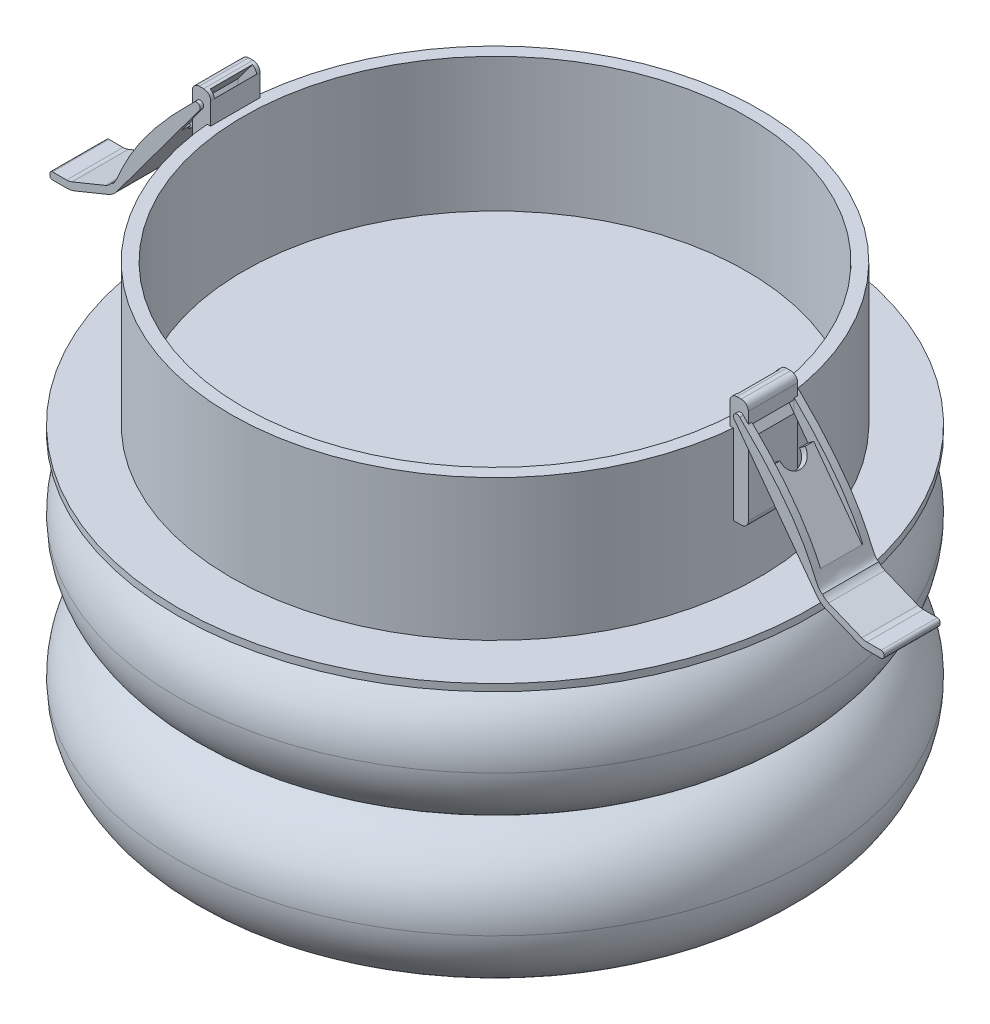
ISO-10303-21;
HEADER;
FILE_DESCRIPTION(('STEP AP214'),'2;1');
FILE_NAME('part.step','',(''),(''),'','','');
FILE_SCHEMA(('AUTOMOTIVE_DESIGN { 1 0 10303 214 1 1 1 1 }'));
ENDSEC;
DATA;
#1=APPLICATION_CONTEXT('core data for automotive mechanical design processes');
#2=APPLICATION_PROTOCOL_DEFINITION('international standard','automotive_design',2000,#1);
#3=PRODUCT_CONTEXT('',#1,'mechanical');
#4=PRODUCT('Part','Part','',(#3));
#5=PRODUCT_RELATED_PRODUCT_CATEGORY('part','',(#4));
#6=PRODUCT_DEFINITION_FORMATION('','',#4);
#7=PRODUCT_DEFINITION_CONTEXT('part definition',#1,'design');
#8=PRODUCT_DEFINITION('design','',#6,#7);
#9=PRODUCT_DEFINITION_SHAPE('','',#8);
#10=(LENGTH_UNIT() NAMED_UNIT(*) SI_UNIT(.MILLI.,.METRE.));
#11=(NAMED_UNIT(*) PLANE_ANGLE_UNIT() SI_UNIT($,.RADIAN.));
#12=(NAMED_UNIT(*) SI_UNIT($,.STERADIAN.) SOLID_ANGLE_UNIT());
#13=UNCERTAINTY_MEASURE_WITH_UNIT(LENGTH_MEASURE(1.E-05),#10,'distance_accuracy_value','');
#14=(GEOMETRIC_REPRESENTATION_CONTEXT(3) GLOBAL_UNCERTAINTY_ASSIGNED_CONTEXT((#13)) GLOBAL_UNIT_ASSIGNED_CONTEXT((#10,
#11,#12)) REPRESENTATION_CONTEXT('',''));
#15=CARTESIAN_POINT('',(0.,0.,0.));
#16=DIRECTION('',(0.,0.,1.));
#17=DIRECTION('',(1.,0.,0.));
#18=AXIS2_PLACEMENT_3D('',#15,#16,#17);
#19=CARTESIAN_POINT('',(4.75762274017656,-10.7639937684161,0.));
#20=DIRECTION('',(0.,-1.,0.));
#21=DIRECTION('',(0.,0.,-1.));
#22=AXIS2_PLACEMENT_3D('',#19,#20,#21);
#23=CYLINDRICAL_SURFACE('',#22,45.);
#24=CARTESIAN_POINT('',(4.75762274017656,-10.7639937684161,0.));
#25=DIRECTION('',(0.,1.,0.));
#26=DIRECTION('',(0.,0.,1.));
#27=AXIS2_PLACEMENT_3D('',#24,#25,#26);
#28=CIRCLE('',#27,45.);
#29=CARTESIAN_POINT('',(4.75762274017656,-10.7639937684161,45.));
#30=VERTEX_POINT('',#29);
#31=EDGE_CURVE('P0_E22',#30,#30,#28,.T.);
#32=ORIENTED_EDGE('',*,*,#31,.F.);
#33=EDGE_LOOP('',(#32));
#34=FACE_BOUND('',#33,.T.);
#35=CARTESIAN_POINT('',(4.75762274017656,-11.7639937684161,0.));
#36=DIRECTION('',(0.,1.,0.));
#37=DIRECTION('',(0.,0.,1.));
#38=AXIS2_PLACEMENT_3D('',#35,#36,#37);
#39=CIRCLE('',#38,45.);
#40=CARTESIAN_POINT('',(4.75762274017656,-11.7639937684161,45.));
#41=VERTEX_POINT('',#40);
#42=EDGE_CURVE('P0_E27',#41,#41,#39,.T.);
#43=ORIENTED_EDGE('',*,*,#42,.T.);
#44=EDGE_LOOP('',(#43));
#45=FACE_BOUND('',#44,.T.);
#46=ADVANCED_FACE('P0_F15',(#34,#45),#23,.T.);
#47=CARTESIAN_POINT('',(4.75762274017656,-10.7639937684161,0.));
#48=DIRECTION('',(0.,1.,0.));
#49=DIRECTION('',(0.,0.,1.));
#50=AXIS2_PLACEMENT_3D('',#47,#48,#49);
#51=PLANE('',#50);
#52=CARTESIAN_POINT('',(4.75762274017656,-10.7639937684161,0.));
#53=DIRECTION('',(0.,1.,0.));
#54=DIRECTION('',(0.,0.,1.));
#55=AXIS2_PLACEMENT_3D('',#52,#53,#54);
#56=CIRCLE('',#55,37.5);
#57=CARTESIAN_POINT('',(4.75762274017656,-10.7639937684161,37.5));
#58=VERTEX_POINT('',#57);
#59=EDGE_CURVE('P0_E10',#58,#58,#56,.T.);
#60=ORIENTED_EDGE('',*,*,#59,.F.);
#61=EDGE_LOOP('',(#60));
#62=FACE_BOUND('',#61,.T.);
#63=ORIENTED_EDGE('',*,*,#31,.T.);
#64=EDGE_LOOP('',(#63));
#65=FACE_BOUND('',#64,.T.);
#66=ADVANCED_FACE('P0_F61',(#62,#65),#51,.T.);
#67=CARTESIAN_POINT('',(4.75762274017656,-11.7639937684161,0.));
#68=DIRECTION('',(0.,1.,0.));
#69=DIRECTION('',(0.,0.,1.));
#70=AXIS2_PLACEMENT_3D('',#67,#68,#69);
#71=PLANE('',#70);
#72=ORIENTED_EDGE('',*,*,#42,.F.);
#73=EDGE_LOOP('',(#72));
#74=FACE_BOUND('',#73,.T.);
#75=ADVANCED_FACE('P0_F66',(#74),#71,.F.);
#76=CARTESIAN_POINT('',(4.75762274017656,9.23600623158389,0.));
#77=DIRECTION('',(0.,-1.,0.));
#78=DIRECTION('',(0.,0.,-1.));
#79=AXIS2_PLACEMENT_3D('',#76,#77,#78);
#80=CYLINDRICAL_SURFACE('',#79,37.5);
#81=CARTESIAN_POINT('',(4.75762274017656,9.23600623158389,0.));
#82=DIRECTION('',(0.,1.,0.));
#83=DIRECTION('',(0.,0.,1.));
#84=AXIS2_PLACEMENT_3D('',#81,#82,#83);
#85=CIRCLE('',#84,37.5);
#86=CARTESIAN_POINT('',(4.75762274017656,9.23600623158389,37.5));
#87=VERTEX_POINT('',#86);
#88=EDGE_CURVE('P0_E30',#87,#87,#85,.T.);
#89=ORIENTED_EDGE('',*,*,#88,.F.);
#90=EDGE_LOOP('',(#89));
#91=FACE_BOUND('',#90,.T.);
#92=ORIENTED_EDGE('',*,*,#59,.T.);
#93=EDGE_LOOP('',(#92));
#94=FACE_BOUND('',#93,.T.);
#95=ADVANCED_FACE('P0_F58',(#91,#94),#80,.T.);
#96=CARTESIAN_POINT('',(4.75762274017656,9.23600623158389,0.));
#97=DIRECTION('',(0.,1.,0.));
#98=DIRECTION('',(0.,0.,1.));
#99=AXIS2_PLACEMENT_3D('',#96,#97,#98);
#100=PLANE('',#99);
#101=CARTESIAN_POINT('',(4.75762274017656,9.23600623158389,0.));
#102=DIRECTION('',(0.,1.,0.));
#103=DIRECTION('',(0.,0.,1.));
#104=AXIS2_PLACEMENT_3D('',#101,#102,#103);
#105=CIRCLE('',#104,35.7106361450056);
#106=CARTESIAN_POINT('',(4.75762274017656,9.23600623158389,35.7106361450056));
#107=VERTEX_POINT('',#106);
#108=EDGE_CURVE('P0_E18',#107,#107,#105,.F.);
#109=ORIENTED_EDGE('',*,*,#108,.T.);
#110=EDGE_LOOP('',(#109));
#111=FACE_BOUND('',#110,.T.);
#112=ORIENTED_EDGE('',*,*,#88,.T.);
#113=EDGE_LOOP('',(#112));
#114=FACE_BOUND('',#113,.T.);
#115=ADVANCED_FACE('P0_F49',(#111,#114),#100,.T.);
#116=CARTESIAN_POINT('',(4.75762274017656,24.2360062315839,0.));
#117=DIRECTION('',(0.,-1.,0.));
#118=DIRECTION('',(0.,0.,-1.));
#119=AXIS2_PLACEMENT_3D('',#116,#117,#118);
#120=CYLINDRICAL_SURFACE('',#119,35.7106361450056);
#121=ORIENTED_EDGE('',*,*,#108,.F.);
#122=EDGE_LOOP('',(#121));
#123=FACE_BOUND('',#122,.T.);
#124=CARTESIAN_POINT('',(4.75762274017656,-9.7639937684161,0.));
#125=DIRECTION('',(0.,1.,0.));
#126=DIRECTION('',(0.,0.,1.));
#127=AXIS2_PLACEMENT_3D('',#124,#125,#126);
#128=CIRCLE('',#127,35.7106361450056);
#129=CARTESIAN_POINT('',(4.75762274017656,-9.7639937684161,35.7106361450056));
#130=VERTEX_POINT('',#129);
#131=EDGE_CURVE('P0_E39',#130,#130,#128,.T.);
#132=ORIENTED_EDGE('',*,*,#131,.F.);
#133=EDGE_LOOP('',(#132));
#134=FACE_BOUND('',#133,.T.);
#135=ADVANCED_FACE('P0_F47',(#123,#134),#120,.F.);
#136=CARTESIAN_POINT('',(4.75762274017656,-9.7639937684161,0.));
#137=DIRECTION('',(0.,1.,0.));
#138=DIRECTION('',(0.,0.,1.));
#139=AXIS2_PLACEMENT_3D('',#136,#137,#138);
#140=PLANE('',#139);
#141=ORIENTED_EDGE('',*,*,#131,.T.);
#142=EDGE_LOOP('',(#141));
#143=FACE_BOUND('',#142,.T.);
#144=ADVANCED_FACE('P0_F45',(#143),#140,.T.);
#145=CLOSED_SHELL('',(#46,#66,#75,#95,#115,#135,#144));
#146=MANIFOLD_SOLID_BREP('P0_B1',#145);
#147=CARTESIAN_POINT('',(-33.0754010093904,12.3360778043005,3.5));
#148=DIRECTION('',(0.,0.,-1.));
#149=DIRECTION('',(-1.,0.,0.));
#150=AXIS2_PLACEMENT_3D('',#147,#148,#149);
#151=CYLINDRICAL_SURFACE('',#150,1.);
#152=CARTESIAN_POINT('',(-33.0754010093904,12.3360778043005,-3.5));
#153=DIRECTION('',(0.,0.,1.));
#154=DIRECTION('',(-1.,0.,0.));
#155=AXIS2_PLACEMENT_3D('',#152,#153,#154);
#156=CIRCLE('',#155,1.);
#157=CARTESIAN_POINT('',(-32.0754010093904,12.3360778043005,-3.5));
#158=VERTEX_POINT('',#157);
#159=CARTESIAN_POINT('',(-33.0754010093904,13.3360778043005,-3.5));
#160=VERTEX_POINT('',#159);
#161=EDGE_CURVE('P1_E148',#158,#160,#156,.T.);
#162=ORIENTED_EDGE('',*,*,#161,.T.);
#163=DIRECTION('',(0.,0.,-1.));
#164=VECTOR('',#163,1.);
#165=CARTESIAN_POINT('',(-33.0754010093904,13.3360778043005,3.5));
#166=LINE('',#165,#164);
#167=CARTESIAN_POINT('',(-33.0754010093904,13.3360778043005,3.5));
#168=VERTEX_POINT('',#167);
#169=EDGE_CURVE('P1_E118',#168,#160,#166,.T.);
#170=ORIENTED_EDGE('',*,*,#169,.F.);
#171=CARTESIAN_POINT('',(-33.0754010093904,12.3360778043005,3.5));
#172=DIRECTION('',(0.,0.,1.));
#173=DIRECTION('',(-1.,0.,0.));
#174=AXIS2_PLACEMENT_3D('',#171,#172,#173);
#175=CIRCLE('',#174,1.);
#176=CARTESIAN_POINT('',(-32.0754010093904,12.3360778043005,3.5));
#177=VERTEX_POINT('',#176);
#178=EDGE_CURVE('P1_E162',#177,#168,#175,.T.);
#179=ORIENTED_EDGE('',*,*,#178,.F.);
#180=DIRECTION('',(0.,0.,-1.));
#181=VECTOR('',#180,1.);
#182=CARTESIAN_POINT('',(-32.0754010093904,12.3360778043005,3.5));
#183=LINE('',#182,#181);
#184=EDGE_CURVE('P1_E102',#177,#158,#183,.T.);
#185=ORIENTED_EDGE('',*,*,#184,.T.);
#186=EDGE_LOOP('',(#162,#170,#179,#185));
#187=FACE_BOUND('',#186,.T.);
#188=DIRECTION('',(0.,0.,-1.));
#189=VECTOR('',#188,1.);
#190=CARTESIAN_POINT('',(-32.0756652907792,12.359066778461,3.5));
#191=LINE('',#190,#189);
#192=CARTESIAN_POINT('',(-32.0756652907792,12.359066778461,2.9851983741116));
#193=VERTEX_POINT('',#192);
#194=CARTESIAN_POINT('',(-32.0756652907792,12.359066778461,-3.));
#195=VERTEX_POINT('',#194);
#196=EDGE_CURVE('P1_E170',#193,#195,#191,.T.);
#197=ORIENTED_EDGE('',*,*,#196,.F.);
#198=CARTESIAN_POINT('',(-33.0754010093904,12.3360778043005,2.9851983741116));
#199=DIRECTION('',(0.,0.,1.));
#200=DIRECTION('',(0.,-1.,0.));
#201=AXIS2_PLACEMENT_3D('',#198,#199,#200);
#202=CIRCLE('',#201,1.);
#203=CARTESIAN_POINT('',(-32.6625493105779,13.2468760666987,2.9851983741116));
#204=VERTEX_POINT('',#203);
#205=EDGE_CURVE('P1_E167',#193,#204,#202,.T.);
#206=ORIENTED_EDGE('',*,*,#205,.T.);
#207=DIRECTION('',(0.,0.,-1.));
#208=VECTOR('',#207,1.);
#209=CARTESIAN_POINT('',(-32.6625493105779,13.2468760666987,3.5));
#210=LINE('',#209,#208);
#211=CARTESIAN_POINT('',(-32.6625493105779,13.2468760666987,-3.));
#212=VERTEX_POINT('',#211);
#213=EDGE_CURVE('P1_E172',#204,#212,#210,.T.);
#214=ORIENTED_EDGE('',*,*,#213,.T.);
#215=CARTESIAN_POINT('',(-33.0754010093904,12.3360778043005,-3.));
#216=DIRECTION('',(0.,0.,-1.));
#217=DIRECTION('',(-1.,0.,0.));
#218=AXIS2_PLACEMENT_3D('',#215,#216,#217);
#219=CIRCLE('',#218,1.);
#220=EDGE_CURVE('P1_E109',#212,#195,#219,.T.);
#221=ORIENTED_EDGE('',*,*,#220,.T.);
#222=EDGE_LOOP('',(#197,#206,#214,#221));
#223=FACE_BOUND('',#222,.T.);
#224=ADVANCED_FACE('P1_F17',(#187,#223),#151,.T.);
#225=CARTESIAN_POINT('',(-34.6846479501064,-1.13140897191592,3.5));
#226=DIRECTION('',(1.,0.,0.));
#227=DIRECTION('',(0.,0.,-1.));
#228=AXIS2_PLACEMENT_3D('',#225,#226,#227);
#229=PLANE('',#228);
#230=DIRECTION('',(0.,-1.,0.));
#231=VECTOR('',#230,1.);
#232=CARTESIAN_POINT('',(-34.6846479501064,-1.13140897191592,-3.5));
#233=LINE('',#232,#231);
#234=CARTESIAN_POINT('',(-34.6846479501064,12.3360778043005,-3.5));
#235=VERTEX_POINT('',#234);
#236=CARTESIAN_POINT('',(-34.6846479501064,-1.13140897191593,-3.5));
#237=VERTEX_POINT('',#236);
#238=EDGE_CURVE('P1_E142',#235,#237,#233,.T.);
#239=ORIENTED_EDGE('',*,*,#238,.T.);
#240=DIRECTION('',(0.,0.,-1.));
#241=VECTOR('',#240,1.);
#242=CARTESIAN_POINT('',(-34.6846479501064,-1.13140897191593,3.5));
#243=LINE('',#242,#241);
#244=CARTESIAN_POINT('',(-34.6846479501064,-1.13140897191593,3.5));
#245=VERTEX_POINT('',#244);
#246=EDGE_CURVE('P1_E127',#245,#237,#243,.T.);
#247=ORIENTED_EDGE('',*,*,#246,.F.);
#248=DIRECTION('',(0.,-1.,0.));
#249=VECTOR('',#248,1.);
#250=CARTESIAN_POINT('',(-34.6846479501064,-1.13140897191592,3.5));
#251=LINE('',#250,#249);
#252=CARTESIAN_POINT('',(-34.6846479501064,12.3360778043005,3.5));
#253=VERTEX_POINT('',#252);
#254=EDGE_CURVE('P1_E156',#253,#245,#251,.T.);
#255=ORIENTED_EDGE('',*,*,#254,.F.);
#256=DIRECTION('',(0.,0.,-1.));
#257=VECTOR('',#256,1.);
#258=CARTESIAN_POINT('',(-34.6846479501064,12.3360778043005,3.5));
#259=LINE('',#258,#257);
#260=EDGE_CURVE('P1_E124',#253,#235,#259,.T.);
#261=ORIENTED_EDGE('',*,*,#260,.T.);
#262=EDGE_LOOP('',(#239,#247,#255,#261));
#263=FACE_BOUND('',#262,.T.);
#264=DIRECTION('',(0.,0.,1.));
#265=VECTOR('',#264,1.);
#266=CARTESIAN_POINT('',(-34.6846479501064,8.83606189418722,3.5));
#267=LINE('',#266,#265);
#268=CARTESIAN_POINT('',(-34.6846479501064,8.83606189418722,-3.));
#269=VERTEX_POINT('',#268);
#270=CARTESIAN_POINT('',(-34.6846479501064,8.83606189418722,2.9851983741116));
#271=VERTEX_POINT('',#270);
#272=EDGE_CURVE('P1_E11',#269,#271,#267,.T.);
#273=ORIENTED_EDGE('',*,*,#272,.F.);
#274=DIRECTION('',(0.,1.,0.));
#275=VECTOR('',#274,1.);
#276=CARTESIAN_POINT('',(-34.6846479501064,-1.13140897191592,-3.));
#277=LINE('',#276,#275);
#278=CARTESIAN_POINT('',(-34.6846479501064,10.5163621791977,-3.));
#279=VERTEX_POINT('',#278);
#280=EDGE_CURVE('P1_E25',#269,#279,#277,.T.);
#281=ORIENTED_EDGE('',*,*,#280,.T.);
#282=DIRECTION('',(0.,0.,1.));
#283=VECTOR('',#282,1.);
#284=CARTESIAN_POINT('',(-34.6846479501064,10.5163621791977,3.5));
#285=LINE('',#284,#283);
#286=CARTESIAN_POINT('',(-34.6846479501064,10.5163621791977,2.9851983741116));
#287=VERTEX_POINT('',#286);
#288=EDGE_CURVE('P1_E96',#279,#287,#285,.T.);
#289=ORIENTED_EDGE('',*,*,#288,.T.);
#290=DIRECTION('',(0.,-1.,0.));
#291=VECTOR('',#290,1.);
#292=CARTESIAN_POINT('',(-34.6846479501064,-1.13140897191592,2.9851983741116));
#293=LINE('',#292,#291);
#294=EDGE_CURVE('P1_E101',#287,#271,#293,.T.);
#295=ORIENTED_EDGE('',*,*,#294,.T.);
#296=EDGE_LOOP('',(#273,#281,#289,#295));
#297=FACE_BOUND('',#296,.T.);
#298=ADVANCED_FACE('P1_F113',(#263,#297),#229,.F.);
#299=CARTESIAN_POINT('',(-32.0754010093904,-2.13140897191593,3.5));
#300=DIRECTION('',(-1.,0.,0.));
#301=DIRECTION('',(0.,0.,1.));
#302=AXIS2_PLACEMENT_3D('',#299,#300,#301);
#303=PLANE('',#302);
#304=DIRECTION('',(0.,1.,0.));
#305=VECTOR('',#304,1.);
#306=CARTESIAN_POINT('',(-32.0754010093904,-2.13140897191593,-3.5));
#307=LINE('',#306,#305);
#308=CARTESIAN_POINT('',(-32.0754010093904,-2.13140897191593,-3.5));
#309=VERTEX_POINT('',#308);
#310=EDGE_CURVE('P1_E150',#309,#158,#307,.T.);
#311=ORIENTED_EDGE('',*,*,#310,.T.);
#312=ORIENTED_EDGE('',*,*,#184,.F.);
#313=DIRECTION('',(0.,1.,0.));
#314=VECTOR('',#313,1.);
#315=CARTESIAN_POINT('',(-32.0754010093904,-2.13140897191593,3.5));
#316=LINE('',#315,#314);
#317=CARTESIAN_POINT('',(-32.0754010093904,-2.13140897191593,3.5));
#318=VERTEX_POINT('',#317);
#319=EDGE_CURVE('P1_E139',#318,#177,#316,.T.);
#320=ORIENTED_EDGE('',*,*,#319,.F.);
#321=DIRECTION('',(0.,0.,-1.));
#322=VECTOR('',#321,1.);
#323=CARTESIAN_POINT('',(-32.0754010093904,-2.13140897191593,3.5));
#324=LINE('',#323,#322);
#325=EDGE_CURVE('P1_E133',#318,#309,#324,.T.);
#326=ORIENTED_EDGE('',*,*,#325,.T.);
#327=EDGE_LOOP('',(#311,#312,#320,#326));
#328=FACE_BOUND('',#327,.T.);
#329=ADVANCED_FACE('P1_F19',(#328),#303,.F.);
#330=CARTESIAN_POINT('',(-33.6846479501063,13.3360778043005,3.5));
#331=DIRECTION('',(0.,-1.,0.));
#332=DIRECTION('',(0.,0.,-1.));
#333=AXIS2_PLACEMENT_3D('',#330,#331,#332);
#334=PLANE('',#333);
#335=DIRECTION('',(-1.,0.,0.));
#336=VECTOR('',#335,1.);
#337=CARTESIAN_POINT('',(-33.6846479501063,13.3360778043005,-3.5));
#338=LINE('',#337,#336);
#339=CARTESIAN_POINT('',(-33.6846479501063,13.3360778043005,-3.5));
#340=VERTEX_POINT('',#339);
#341=EDGE_CURVE('P1_E146',#160,#340,#338,.T.);
#342=ORIENTED_EDGE('',*,*,#341,.T.);
#343=DIRECTION('',(0.,0.,-1.));
#344=VECTOR('',#343,1.);
#345=CARTESIAN_POINT('',(-33.6846479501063,13.3360778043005,3.5));
#346=LINE('',#345,#344);
#347=CARTESIAN_POINT('',(-33.6846479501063,13.3360778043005,3.5));
#348=VERTEX_POINT('',#347);
#349=EDGE_CURVE('P1_E121',#348,#340,#346,.T.);
#350=ORIENTED_EDGE('',*,*,#349,.F.);
#351=DIRECTION('',(-1.,0.,0.));
#352=VECTOR('',#351,1.);
#353=CARTESIAN_POINT('',(-33.6846479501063,13.3360778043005,3.5));
#354=LINE('',#353,#352);
#355=EDGE_CURVE('P1_E160',#168,#348,#354,.T.);
#356=ORIENTED_EDGE('',*,*,#355,.F.);
#357=ORIENTED_EDGE('',*,*,#169,.T.);
#358=EDGE_LOOP('',(#342,#350,#356,#357));
#359=FACE_BOUND('',#358,.T.);
#360=ADVANCED_FACE('P1_F205',(#359),#334,.F.);
#361=CARTESIAN_POINT('',(-33.6846479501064,12.3360778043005,3.5));
#362=DIRECTION('',(0.,0.,-1.));
#363=DIRECTION('',(-1.,0.,0.));
#364=AXIS2_PLACEMENT_3D('',#361,#362,#363);
#365=CYLINDRICAL_SURFACE('',#364,1.);
#366=CARTESIAN_POINT('',(-33.6846479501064,12.3360778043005,-3.5));
#367=DIRECTION('',(0.,0.,1.));
#368=DIRECTION('',(-1.,0.,0.));
#369=AXIS2_PLACEMENT_3D('',#366,#367,#368);
#370=CIRCLE('',#369,1.);
#371=EDGE_CURVE('P1_E144',#340,#235,#370,.T.);
#372=ORIENTED_EDGE('',*,*,#371,.T.);
#373=ORIENTED_EDGE('',*,*,#260,.F.);
#374=CARTESIAN_POINT('',(-33.6846479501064,12.3360778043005,3.5));
#375=DIRECTION('',(0.,0.,1.));
#376=DIRECTION('',(-1.,0.,0.));
#377=AXIS2_PLACEMENT_3D('',#374,#375,#376);
#378=CIRCLE('',#377,1.);
#379=EDGE_CURVE('P1_E158',#348,#253,#378,.T.);
#380=ORIENTED_EDGE('',*,*,#379,.F.);
#381=ORIENTED_EDGE('',*,*,#349,.T.);
#382=EDGE_LOOP('',(#372,#373,#380,#381));
#383=FACE_BOUND('',#382,.T.);
#384=ADVANCED_FACE('P1_F208',(#383),#365,.T.);
#385=CARTESIAN_POINT('',(-33.6846479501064,-1.13140897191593,3.5));
#386=DIRECTION('',(0.,0.,-1.));
#387=DIRECTION('',(-1.,0.,0.));
#388=AXIS2_PLACEMENT_3D('',#385,#386,#387);
#389=CYLINDRICAL_SURFACE('',#388,1.);
#390=CARTESIAN_POINT('',(-33.6846479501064,-1.13140897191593,-3.5));
#391=DIRECTION('',(0.,0.,1.));
#392=DIRECTION('',(-1.,0.,0.));
#393=AXIS2_PLACEMENT_3D('',#390,#391,#392);
#394=CIRCLE('',#393,1.);
#395=CARTESIAN_POINT('',(-33.6846479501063,-2.13140897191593,-3.5));
#396=VERTEX_POINT('',#395);
#397=EDGE_CURVE('P1_E140',#237,#396,#394,.T.);
#398=ORIENTED_EDGE('',*,*,#397,.T.);
#399=DIRECTION('',(0.,0.,-1.));
#400=VECTOR('',#399,1.);
#401=CARTESIAN_POINT('',(-33.6846479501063,-2.13140897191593,3.5));
#402=LINE('',#401,#400);
#403=CARTESIAN_POINT('',(-33.6846479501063,-2.13140897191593,3.5));
#404=VERTEX_POINT('',#403);
#405=EDGE_CURVE('P1_E130',#404,#396,#402,.T.);
#406=ORIENTED_EDGE('',*,*,#405,.F.);
#407=CARTESIAN_POINT('',(-33.6846479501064,-1.13140897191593,3.5));
#408=DIRECTION('',(0.,0.,1.));
#409=DIRECTION('',(-1.,0.,0.));
#410=AXIS2_PLACEMENT_3D('',#407,#408,#409);
#411=CIRCLE('',#410,1.);
#412=EDGE_CURVE('P1_E154',#245,#404,#411,.T.);
#413=ORIENTED_EDGE('',*,*,#412,.F.);
#414=ORIENTED_EDGE('',*,*,#246,.T.);
#415=EDGE_LOOP('',(#398,#406,#413,#414));
#416=FACE_BOUND('',#415,.T.);
#417=ADVANCED_FACE('P1_F211',(#416),#389,.T.);
#418=CARTESIAN_POINT('',(-33.6846479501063,-2.13140897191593,3.5));
#419=DIRECTION('',(0.,1.,0.));
#420=DIRECTION('',(0.,0.,1.));
#421=AXIS2_PLACEMENT_3D('',#418,#419,#420);
#422=PLANE('',#421);
#423=DIRECTION('',(1.,0.,0.));
#424=VECTOR('',#423,1.);
#425=CARTESIAN_POINT('',(-33.6846479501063,-2.13140897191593,-3.5));
#426=LINE('',#425,#424);
#427=EDGE_CURVE('P1_E137',#396,#309,#426,.T.);
#428=ORIENTED_EDGE('',*,*,#427,.T.);
#429=ORIENTED_EDGE('',*,*,#325,.F.);
#430=DIRECTION('',(1.,0.,0.));
#431=VECTOR('',#430,1.);
#432=CARTESIAN_POINT('',(-33.6846479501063,-2.13140897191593,3.5));
#433=LINE('',#432,#431);
#434=EDGE_CURVE('P1_E136',#404,#318,#433,.T.);
#435=ORIENTED_EDGE('',*,*,#434,.F.);
#436=ORIENTED_EDGE('',*,*,#405,.T.);
#437=EDGE_LOOP('',(#428,#429,#435,#436));
#438=FACE_BOUND('',#437,.T.);
#439=ADVANCED_FACE('P1_F216',(#438),#422,.F.);
#440=CARTESIAN_POINT('',(-33.0754010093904,12.3360778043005,3.5));
#441=DIRECTION('',(0.,0.,-1.));
#442=DIRECTION('',(-1.,0.,0.));
#443=AXIS2_PLACEMENT_3D('',#440,#441,#442);
#444=PLANE('',#443);
#445=ORIENTED_EDGE('',*,*,#319,.T.);
#446=ORIENTED_EDGE('',*,*,#178,.T.);
#447=ORIENTED_EDGE('',*,*,#355,.T.);
#448=ORIENTED_EDGE('',*,*,#379,.T.);
#449=ORIENTED_EDGE('',*,*,#254,.T.);
#450=ORIENTED_EDGE('',*,*,#412,.T.);
#451=ORIENTED_EDGE('',*,*,#434,.T.);
#452=EDGE_LOOP('',(#445,#446,#447,#448,#449,#450,#451));
#453=FACE_BOUND('',#452,.T.);
#454=ADVANCED_FACE('P1_F220',(#453),#444,.F.);
#455=CARTESIAN_POINT('',(-33.0754010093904,12.3360778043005,-3.5));
#456=DIRECTION('',(0.,0.,-1.));
#457=DIRECTION('',(-1.,0.,0.));
#458=AXIS2_PLACEMENT_3D('',#455,#456,#457);
#459=PLANE('',#458);
#460=ORIENTED_EDGE('',*,*,#310,.F.);
#461=ORIENTED_EDGE('',*,*,#427,.F.);
#462=ORIENTED_EDGE('',*,*,#397,.F.);
#463=ORIENTED_EDGE('',*,*,#238,.F.);
#464=ORIENTED_EDGE('',*,*,#371,.F.);
#465=ORIENTED_EDGE('',*,*,#341,.F.);
#466=ORIENTED_EDGE('',*,*,#161,.F.);
#467=EDGE_LOOP('',(#460,#461,#462,#463,#464,#465,#466));
#468=FACE_BOUND('',#467,.T.);
#469=ADVANCED_FACE('P1_F194',(#468),#459,.T.);
#470=CARTESIAN_POINT('',(-30.1811372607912,14.9173173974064,-3.));
#471=DIRECTION('',(0.,0.,-1.));
#472=DIRECTION('',(-1.,0.,0.));
#473=AXIS2_PLACEMENT_3D('',#470,#471,#472);
#474=PLANE('',#473);
#475=DIRECTION('',(-0.595131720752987,-0.803628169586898,0.));
#476=VECTOR('',#475,1.);
#477=CARTESIAN_POINT('',(-30.9847654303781,15.5124491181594,-3.));
#478=LINE('',#477,#476);
#479=EDGE_CURVE('P1_E32',#212,#279,#478,.T.);
#480=ORIENTED_EDGE('',*,*,#479,.T.);
#481=ORIENTED_EDGE('',*,*,#280,.F.);
#482=DIRECTION('',(-0.595131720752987,-0.803628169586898,0.));
#483=VECTOR('',#482,1.);
#484=CARTESIAN_POINT('',(-30.1811372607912,14.9173173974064,-3.));
#485=LINE('',#484,#483);
#486=EDGE_CURVE('P1_E175',#195,#269,#485,.T.);
#487=ORIENTED_EDGE('',*,*,#486,.F.);
#488=ORIENTED_EDGE('',*,*,#220,.F.);
#489=EDGE_LOOP('',(#480,#481,#487,#488));
#490=FACE_BOUND('',#489,.T.);
#491=ADVANCED_FACE('P1_F105',(#490),#474,.F.);
#492=CARTESIAN_POINT('',(-30.1811372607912,14.9173173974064,2.9851983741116));
#493=DIRECTION('',(0.,0.,1.));
#494=DIRECTION('',(0.,-1.,0.));
#495=AXIS2_PLACEMENT_3D('',#492,#493,#494);
#496=PLANE('',#495);
#497=DIRECTION('',(0.595131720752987,0.803628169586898,0.));
#498=VECTOR('',#497,1.);
#499=CARTESIAN_POINT('',(-30.1811372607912,14.9173173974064,2.9851983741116));
#500=LINE('',#499,#498);
#501=EDGE_CURVE('P1_E174',#271,#193,#500,.T.);
#502=ORIENTED_EDGE('',*,*,#501,.F.);
#503=ORIENTED_EDGE('',*,*,#294,.F.);
#504=DIRECTION('',(0.595131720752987,0.803628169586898,0.));
#505=VECTOR('',#504,1.);
#506=CARTESIAN_POINT('',(-30.9847654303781,15.5124491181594,2.9851983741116));
#507=LINE('',#506,#505);
#508=EDGE_CURVE('P1_E37',#287,#204,#507,.T.);
#509=ORIENTED_EDGE('',*,*,#508,.T.);
#510=ORIENTED_EDGE('',*,*,#205,.F.);
#511=EDGE_LOOP('',(#502,#503,#509,#510));
#512=FACE_BOUND('',#511,.T.);
#513=ADVANCED_FACE('P1_F185',(#512),#496,.F.);
#514=CARTESIAN_POINT('',(-36.6465695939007,6.18680720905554,-0.00740081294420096));
#515=DIRECTION('',(-0.803628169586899,0.595131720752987,0.));
#516=DIRECTION('',(-0.595131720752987,-0.803628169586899,0.));
#517=AXIS2_PLACEMENT_3D('',#514,#515,#516);
#518=PLANE('',#517);
#519=ORIENTED_EDGE('',*,*,#196,.T.);
#520=ORIENTED_EDGE('',*,*,#486,.T.);
#521=ORIENTED_EDGE('',*,*,#272,.T.);
#522=ORIENTED_EDGE('',*,*,#501,.T.);
#523=EDGE_LOOP('',(#519,#520,#521,#522));
#524=FACE_BOUND('',#523,.T.);
#525=ADVANCED_FACE('P1_F180',(#524),#518,.T.);
#526=CARTESIAN_POINT('',(-37.4501977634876,6.78193892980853,-0.00740081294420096));
#527=DIRECTION('',(-0.803628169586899,0.595131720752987,0.));
#528=DIRECTION('',(-0.595131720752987,-0.803628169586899,0.));
#529=AXIS2_PLACEMENT_3D('',#526,#527,#528);
#530=PLANE('',#529);
#531=ORIENTED_EDGE('',*,*,#508,.F.);
#532=ORIENTED_EDGE('',*,*,#288,.F.);
#533=ORIENTED_EDGE('',*,*,#479,.F.);
#534=ORIENTED_EDGE('',*,*,#213,.F.);
#535=EDGE_LOOP('',(#531,#532,#533,#534));
#536=FACE_BOUND('',#535,.T.);
#537=ADVANCED_FACE('P1_F97',(#536),#530,.F.);
#538=CLOSED_SHELL('',(#224,#298,#329,#360,#384,#417,#439,#454,#469,#491,#513,#525,#537));
#539=MANIFOLD_SOLID_BREP('P1_B1',#538);
#540=CARTESIAN_POINT('',(-33.5688767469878,11.1828787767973,4.));
#541=DIRECTION('',(0.,0.,-1.));
#542=DIRECTION('',(-1.,0.,0.));
#543=AXIS2_PLACEMENT_3D('',#540,#541,#542);
#544=CYLINDRICAL_SURFACE('',#543,0.500000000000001);
#545=DIRECTION('',(0.,0.,-1.));
#546=VECTOR('',#545,1.);
#547=CARTESIAN_POINT('',(-33.9706908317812,11.4804446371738,4.));
#548=LINE('',#547,#546);
#549=CARTESIAN_POINT('',(-33.9706908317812,11.4804446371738,-3.));
#550=VERTEX_POINT('',#549);
#551=CARTESIAN_POINT('',(-33.9706908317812,11.4804446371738,-4.));
#552=VERTEX_POINT('',#551);
#553=EDGE_CURVE('P2_E25',#550,#552,#548,.T.);
#554=ORIENTED_EDGE('',*,*,#553,.F.);
#555=CARTESIAN_POINT('',(-33.5688767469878,11.1828787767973,-3.));
#556=DIRECTION('',(0.,0.,-1.));
#557=DIRECTION('',(-1.,0.,0.));
#558=AXIS2_PLACEMENT_3D('',#555,#556,#557);
#559=CIRCLE('',#558,0.500000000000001);
#560=CARTESIAN_POINT('',(-33.1670626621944,10.8853129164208,-3.));
#561=VERTEX_POINT('',#560);
#562=EDGE_CURVE('P2_E308',#550,#561,#559,.T.);
#563=ORIENTED_EDGE('',*,*,#562,.T.);
#564=DIRECTION('',(0.,0.,-1.));
#565=VECTOR('',#564,1.);
#566=CARTESIAN_POINT('',(-33.1670626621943,10.8853129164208,4.));
#567=LINE('',#566,#565);
#568=CARTESIAN_POINT('',(-33.1670626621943,10.8853129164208,-4.));
#569=VERTEX_POINT('',#568);
#570=EDGE_CURVE('P2_E93',#561,#569,#567,.T.);
#571=ORIENTED_EDGE('',*,*,#570,.T.);
#572=CARTESIAN_POINT('',(-33.5688767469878,11.1828787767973,-4.));
#573=DIRECTION('',(0.,0.,1.));
#574=DIRECTION('',(1.,0.,0.));
#575=AXIS2_PLACEMENT_3D('',#572,#573,#574);
#576=CIRCLE('',#575,0.500000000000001);
#577=EDGE_CURVE('P2_E162',#569,#552,#576,.T.);
#578=ORIENTED_EDGE('',*,*,#577,.T.);
#579=EDGE_LOOP('',(#554,#563,#571,#578));
#580=FACE_BOUND('',#579,.T.);
#581=ADVANCED_FACE('P2_F17',(#580),#544,.T.);
#582=CARTESIAN_POINT('',(-33.9706908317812,11.4804446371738,4.));
#583=CARTESIAN_POINT('',(-44.9336920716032,0.835747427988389,4.));
#584=CARTESIAN_POINT('',(-44.1906093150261,-3.79706733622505,4.));
#585=CARTESIAN_POINT('',(-45.7039620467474,-4.36342141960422,4.));
#586=B_SPLINE_CURVE_WITH_KNOTS('',3,(#582,#583,#584,#585),.UNSPECIFIED.,.F.,.F.,(4,4),(0.,1.),.UNSPECIFIED.);
#587=DIRECTION('',(0.,0.,-1.));
#588=VECTOR('',#587,1.);
#589=SURFACE_OF_LINEAR_EXTRUSION('',#586,#588);
#590=CARTESIAN_POINT('',(-33.9706908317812,11.4804446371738,-3.));
#591=CARTESIAN_POINT('',(-34.3151683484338,11.1459409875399,-3.));
#592=CARTESIAN_POINT('',(-34.6570408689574,10.8087333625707,-3.));
#593=CARTESIAN_POINT('',(-35.3364778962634,10.1268724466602,-3.));
#594=CARTESIAN_POINT('',(-35.6740149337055,9.78219179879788,-3.));
#595=CARTESIAN_POINT('',(-36.3435167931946,9.08535600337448,-3.));
#596=CARTESIAN_POINT('',(-36.6754606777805,8.73318070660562,-3.));
#597=CARTESIAN_POINT('',(-37.3324058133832,8.02123989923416,-3.));
#598=CARTESIAN_POINT('',(-37.6573936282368,7.66146197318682,-3.));
#599=CARTESIAN_POINT('',(-38.2989671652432,6.93411124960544,-3.));
#600=CARTESIAN_POINT('',(-38.6155479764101,6.56653411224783,-3.));
#601=CARTESIAN_POINT('',(-39.2324647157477,5.83072392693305,-3.));
#602=CARTESIAN_POINT('',(-39.5330006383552,5.4626588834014,-3.));
#603=CARTESIAN_POINT('',(-40.1229043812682,4.71821387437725,-3.));
#604=CARTESIAN_POINT('',(-40.4122821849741,4.34184183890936,-3.));
#605=CARTESIAN_POINT('',(-40.978045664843,3.58015267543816,-3.));
#606=CARTESIAN_POINT('',(-41.2544470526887,3.19484725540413,-3.));
#607=CARTESIAN_POINT('',(-41.7921888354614,2.41449873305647,-3.));
#608=CARTESIAN_POINT('',(-42.0535463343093,2.01946744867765,-3.));
#609=CARTESIAN_POINT('',(-42.5588933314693,1.2186538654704,-3.));
#610=CARTESIAN_POINT('',(-42.8028916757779,0.812877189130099,-3.));
#611=CARTESIAN_POINT('',(-43.1217202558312,0.252424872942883,-3.));
#612=CARTESIAN_POINT('',(-43.2052041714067,0.102636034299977,-3.));
#613=CARTESIAN_POINT('',(-43.3694805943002,-0.198444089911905,-3.));
#614=CARTESIAN_POINT('',(-43.4502726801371,-0.349735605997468,-3.));
#615=CARTESIAN_POINT('',(-43.6090945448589,-0.653780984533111,-3.));
#616=CARTESIAN_POINT('',(-43.6871240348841,-0.806534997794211,-3.));
#617=CARTESIAN_POINT('',(-43.8407568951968,-1.11407626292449,-3.));
#618=CARTESIAN_POINT('',(-43.9163484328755,-1.26886942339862,-3.));
#619=CARTESIAN_POINT('',(-44.0649096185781,-1.57969625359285,-3.));
#620=CARTESIAN_POINT('',(-44.1378794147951,-1.73572985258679,-3.));
#621=CARTESIAN_POINT('',(-44.2457153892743,-1.97050043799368,-3.));
#622=CARTESIAN_POINT('',(-44.281387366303,-2.04886928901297,-3.));
#623=CARTESIAN_POINT('',(-44.3523181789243,-2.20579208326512,-3.));
#624=CARTESIAN_POINT('',(-44.3875770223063,-2.28434602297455,-3.));
#625=CARTESIAN_POINT('',(-44.4226918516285,-2.36296388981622,-3.));
#626=B_SPLINE_CURVE_WITH_KNOTS('',3,(#590,#591,#592,#593,#594,#595,#596,#597,#598,#599,#600,
#601,#602,#603,#604,#605,#606,#607,#608,#609,#610,#611,#612,#613,#614,#615,#616,#617,#618,#619,
#620,#621,#622,#623,#624,#625),.UNSPECIFIED.,.F.,.F.,(4,2,2,2,2,2,2,2,2,2,2,2,2,2,2,2,2,4),(0.,
1.4404993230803,2.88770561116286,4.33947732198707,5.79383792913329,7.24903020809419,
8.67438327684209,10.0984299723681,11.5207054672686,12.9413306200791,14.3612265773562,
14.8756534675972,15.390160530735,15.9047212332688,16.4214874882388,16.9382244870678,
17.1965402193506,17.4548510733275),.UNSPECIFIED.);
#627=CARTESIAN_POINT('',(-44.4226918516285,-2.36296388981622,-3.));
#628=VERTEX_POINT('',#627);
#629=EDGE_CURVE('P2_E236',#550,#628,#626,.T.);
#630=ORIENTED_EDGE('',*,*,#629,.F.);
#631=ORIENTED_EDGE('',*,*,#553,.T.);
#632=CARTESIAN_POINT('',(-33.9706908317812,11.4804446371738,-4.));
#633=CARTESIAN_POINT('',(-44.9336920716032,0.835747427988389,-4.));
#634=CARTESIAN_POINT('',(-44.1906093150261,-3.79706733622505,-4.));
#635=CARTESIAN_POINT('',(-45.7039620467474,-4.36342141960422,-4.));
#636=B_SPLINE_CURVE_WITH_KNOTS('',3,(#632,#633,#634,#635),.UNSPECIFIED.,.F.,.F.,(4,4),(0.,1.),.UNSPECIFIED.);
#637=CARTESIAN_POINT('',(-45.7039620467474,-4.36342141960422,-4.));
#638=VERTEX_POINT('',#637);
#639=EDGE_CURVE('P2_E164',#552,#638,#636,.T.);
#640=ORIENTED_EDGE('',*,*,#639,.T.);
#641=DIRECTION('',(0.,0.,-1.));
#642=VECTOR('',#641,1.);
#643=CARTESIAN_POINT('',(-45.7039620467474,-4.36342141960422,4.));
#644=LINE('',#643,#642);
#645=CARTESIAN_POINT('',(-45.7039620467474,-4.36342141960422,4.));
#646=VERTEX_POINT('',#645);
#647=EDGE_CURVE('P2_E224',#646,#638,#644,.T.);
#648=ORIENTED_EDGE('',*,*,#647,.F.);
#649=CARTESIAN_POINT('',(-33.9706908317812,11.4804446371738,4.));
#650=VERTEX_POINT('',#649);
#651=EDGE_CURVE('P2_E101',#650,#646,#586,.T.);
#652=ORIENTED_EDGE('',*,*,#651,.F.);
#653=CARTESIAN_POINT('',(-33.9706908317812,11.4804446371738,3.));
#654=VERTEX_POINT('',#653);
#655=EDGE_CURVE('P2_E11',#650,#654,#548,.T.);
#656=ORIENTED_EDGE('',*,*,#655,.T.);
#657=CARTESIAN_POINT('',(-33.9706908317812,11.4804446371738,3.));
#658=CARTESIAN_POINT('',(-34.3151683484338,11.1459409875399,3.));
#659=CARTESIAN_POINT('',(-34.6570408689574,10.8087333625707,3.));
#660=CARTESIAN_POINT('',(-35.3364778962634,10.1268724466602,3.));
#661=CARTESIAN_POINT('',(-35.6740149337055,9.78219179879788,3.));
#662=CARTESIAN_POINT('',(-36.3435167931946,9.08535600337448,3.));
#663=CARTESIAN_POINT('',(-36.6754606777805,8.73318070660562,3.));
#664=CARTESIAN_POINT('',(-37.3324058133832,8.02123989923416,3.));
#665=CARTESIAN_POINT('',(-37.6573936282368,7.66146197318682,3.));
#666=CARTESIAN_POINT('',(-38.2989671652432,6.93411124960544,3.));
#667=CARTESIAN_POINT('',(-38.6155479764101,6.56653411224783,3.));
#668=CARTESIAN_POINT('',(-39.2324647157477,5.83072392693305,3.));
#669=CARTESIAN_POINT('',(-39.5330006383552,5.4626588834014,3.));
#670=CARTESIAN_POINT('',(-40.1229043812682,4.71821387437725,3.));
#671=CARTESIAN_POINT('',(-40.4122821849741,4.34184183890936,3.));
#672=CARTESIAN_POINT('',(-40.978045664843,3.58015267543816,3.));
#673=CARTESIAN_POINT('',(-41.2544470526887,3.19484725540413,3.));
#674=CARTESIAN_POINT('',(-41.7921888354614,2.41449873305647,3.));
#675=CARTESIAN_POINT('',(-42.0535463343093,2.01946744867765,3.));
#676=CARTESIAN_POINT('',(-42.5588933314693,1.2186538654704,3.));
#677=CARTESIAN_POINT('',(-42.8028916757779,0.812877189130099,3.));
#678=CARTESIAN_POINT('',(-43.1217202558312,0.252424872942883,3.));
#679=CARTESIAN_POINT('',(-43.2052041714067,0.102636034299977,3.));
#680=CARTESIAN_POINT('',(-43.3694805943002,-0.198444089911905,3.));
#681=CARTESIAN_POINT('',(-43.4502726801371,-0.349735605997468,3.));
#682=CARTESIAN_POINT('',(-43.6090945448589,-0.653780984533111,3.));
#683=CARTESIAN_POINT('',(-43.6871240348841,-0.806534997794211,3.));
#684=CARTESIAN_POINT('',(-43.8407568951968,-1.11407626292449,3.));
#685=CARTESIAN_POINT('',(-43.9163484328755,-1.26886942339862,3.));
#686=CARTESIAN_POINT('',(-44.0649096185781,-1.57969625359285,3.));
#687=CARTESIAN_POINT('',(-44.1378794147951,-1.73572985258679,3.));
#688=CARTESIAN_POINT('',(-44.2457153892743,-1.97050043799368,3.));
#689=CARTESIAN_POINT('',(-44.281387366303,-2.04886928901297,3.));
#690=CARTESIAN_POINT('',(-44.3523181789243,-2.20579208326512,3.));
#691=CARTESIAN_POINT('',(-44.3875770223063,-2.28434602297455,3.));
#692=CARTESIAN_POINT('',(-44.4226918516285,-2.36296388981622,3.));
#693=B_SPLINE_CURVE_WITH_KNOTS('',3,(#657,#658,#659,#660,#661,#662,#663,#664,#665,#666,#667,
#668,#669,#670,#671,#672,#673,#674,#675,#676,#677,#678,#679,#680,#681,#682,#683,#684,#685,#686,
#687,#688,#689,#690,#691,#692),.UNSPECIFIED.,.F.,.F.,(4,2,2,2,2,2,2,2,2,2,2,2,2,2,2,2,2,4),(0.,
1.4404993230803,2.88770561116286,4.33947732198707,5.79383792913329,7.24903020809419,
8.67438327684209,10.0984299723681,11.5207054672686,12.9413306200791,14.3612265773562,
14.8756534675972,15.390160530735,15.9047212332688,16.4214874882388,16.9382244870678,
17.1965402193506,17.4548510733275),.UNSPECIFIED.);
#694=CARTESIAN_POINT('',(-44.4226918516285,-2.36296388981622,3.));
#695=VERTEX_POINT('',#694);
#696=EDGE_CURVE('P2_E32',#654,#695,#693,.T.);
#697=ORIENTED_EDGE('',*,*,#696,.T.);
#698=DIRECTION('',(0.,0.,-1.));
#699=VECTOR('',#698,1.);
#700=CARTESIAN_POINT('',(-44.4226918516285,-2.36296388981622,3.));
#701=LINE('',#700,#699);
#702=EDGE_CURVE('P2_E458',#695,#628,#701,.T.);
#703=ORIENTED_EDGE('',*,*,#702,.T.);
#704=EDGE_LOOP('',(#630,#631,#640,#648,#652,#656,#697,#703));
#705=FACE_BOUND('',#704,.T.);
#706=ADVANCED_FACE('P2_F232',(#705),#589,.F.);
#707=CARTESIAN_POINT('',(-33.1670626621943,10.8853129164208,4.));
#708=VERTEX_POINT('',#707);
#709=CARTESIAN_POINT('',(-33.1670626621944,10.8853129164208,2.9851983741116));
#710=VERTEX_POINT('',#709);
#711=EDGE_CURVE('P2_E196',#708,#710,#567,.T.);
#712=ORIENTED_EDGE('',*,*,#711,.T.);
#713=CARTESIAN_POINT('',(-33.5688767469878,11.1828787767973,2.9851983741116));
#714=DIRECTION('',(0.,0.,1.));
#715=DIRECTION('',(0.,-1.,0.));
#716=AXIS2_PLACEMENT_3D('',#713,#714,#715);
#717=CIRCLE('',#716,0.500000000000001);
#718=CARTESIAN_POINT('',(-33.9706908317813,11.4804446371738,2.9851983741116));
#719=VERTEX_POINT('',#718);
#720=EDGE_CURVE('P2_E261',#710,#719,#717,.T.);
#721=ORIENTED_EDGE('',*,*,#720,.T.);
#722=DIRECTION('',(0.,0.,-1.));
#723=VECTOR('',#722,1.);
#724=CARTESIAN_POINT('',(-33.9706908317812,11.4804446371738,3.));
#725=LINE('',#724,#723);
#726=EDGE_CURVE('P2_E342',#654,#719,#725,.T.);
#727=ORIENTED_EDGE('',*,*,#726,.F.);
#728=ORIENTED_EDGE('',*,*,#655,.F.);
#729=CARTESIAN_POINT('',(-33.5688767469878,11.1828787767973,4.));
#730=DIRECTION('',(0.,0.,1.));
#731=DIRECTION('',(1.,0.,0.));
#732=AXIS2_PLACEMENT_3D('',#729,#730,#731);
#733=CIRCLE('',#732,0.500000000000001);
#734=EDGE_CURVE('P2_E195',#708,#650,#733,.T.);
#735=ORIENTED_EDGE('',*,*,#734,.F.);
#736=EDGE_LOOP('',(#712,#721,#727,#728,#735));
#737=FACE_BOUND('',#736,.T.);
#738=ADVANCED_FACE('P2_F19',(#737),#544,.T.);
#739=CARTESIAN_POINT('',(-47.3112183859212,-3.17315797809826,4.));
#740=DIRECTION('',(0.,0.,-1.));
#741=DIRECTION('',(-1.,0.,0.));
#742=AXIS2_PLACEMENT_3D('',#739,#740,#741);
#743=CYLINDRICAL_SURFACE('',#742,2.);
#744=CARTESIAN_POINT('',(-47.3112183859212,-3.17315797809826,-4.));
#745=DIRECTION('',(0.,0.,-1.));
#746=DIRECTION('',(-1.,0.,0.));
#747=AXIS2_PLACEMENT_3D('',#744,#745,#746);
#748=CIRCLE('',#747,2.);
#749=CARTESIAN_POINT('',(-46.5543069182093,-5.02439676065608,-4.));
#750=VERTEX_POINT('',#749);
#751=EDGE_CURVE('P2_E169',#638,#750,#748,.T.);
#752=ORIENTED_EDGE('',*,*,#751,.T.);
#753=DIRECTION('',(0.,0.,-1.));
#754=VECTOR('',#753,1.);
#755=CARTESIAN_POINT('',(-46.5543069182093,-5.02439676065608,4.));
#756=LINE('',#755,#754);
#757=CARTESIAN_POINT('',(-46.5543069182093,-5.02439676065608,4.));
#758=VERTEX_POINT('',#757);
#759=EDGE_CURVE('P2_E222',#758,#750,#756,.T.);
#760=ORIENTED_EDGE('',*,*,#759,.F.);
#761=CARTESIAN_POINT('',(-47.3112183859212,-3.17315797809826,4.));
#762=DIRECTION('',(0.,0.,-1.));
#763=DIRECTION('',(-1.,0.,0.));
#764=AXIS2_PLACEMENT_3D('',#761,#762,#763);
#765=CIRCLE('',#764,2.);
#766=EDGE_CURVE('P2_E403',#646,#758,#765,.T.);
#767=ORIENTED_EDGE('',*,*,#766,.F.);
#768=ORIENTED_EDGE('',*,*,#647,.T.);
#769=EDGE_LOOP('',(#752,#760,#767,#768));
#770=FACE_BOUND('',#769,.T.);
#771=ADVANCED_FACE('P2_F248',(#770),#743,.F.);
#772=CARTESIAN_POINT('',(-46.5543069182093,-5.02439676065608,4.));
#773=DIRECTION('',(0.37845573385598,-0.925619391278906,0.));
#774=DIRECTION('',(0.925619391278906,0.37845573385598,0.));
#775=AXIS2_PLACEMENT_3D('',#772,#773,#774);
#776=PLANE('',#775);
#777=DIRECTION('',(-0.925619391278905,-0.37845573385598,0.));
#778=VECTOR('',#777,1.);
#779=CARTESIAN_POINT('',(-46.5543069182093,-5.02439676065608,-4.));
#780=LINE('',#779,#778);
#781=CARTESIAN_POINT('',(-51.2568229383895,-6.94710297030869,-4.));
#782=VERTEX_POINT('',#781);
#783=EDGE_CURVE('P2_E174',#750,#782,#780,.T.);
#784=ORIENTED_EDGE('',*,*,#783,.T.);
#785=DIRECTION('',(0.,0.,-1.));
#786=VECTOR('',#785,1.);
#787=CARTESIAN_POINT('',(-51.2568229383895,-6.94710297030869,4.));
#788=LINE('',#787,#786);
#789=CARTESIAN_POINT('',(-51.2568229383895,-6.94710297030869,4.));
#790=VERTEX_POINT('',#789);
#791=EDGE_CURVE('P2_E219',#790,#782,#788,.T.);
#792=ORIENTED_EDGE('',*,*,#791,.F.);
#793=DIRECTION('',(-0.925619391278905,-0.37845573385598,0.));
#794=VECTOR('',#793,1.);
#795=CARTESIAN_POINT('',(-46.5543069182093,-5.02439676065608,4.));
#796=LINE('',#795,#794);
#797=EDGE_CURVE('P2_E408',#758,#790,#796,.T.);
#798=ORIENTED_EDGE('',*,*,#797,.F.);
#799=ORIENTED_EDGE('',*,*,#759,.T.);
#800=EDGE_LOOP('',(#784,#792,#798,#799));
#801=FACE_BOUND('',#800,.T.);
#802=ADVANCED_FACE('P2_F253',(#801),#776,.F.);
#803=CARTESIAN_POINT('',(-52.0137344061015,-5.09586418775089,4.));
#804=DIRECTION('',(0.,0.,-1.));
#805=DIRECTION('',(-1.,0.,0.));
#806=AXIS2_PLACEMENT_3D('',#803,#804,#805);
#807=CYLINDRICAL_SURFACE('',#806,2.);
#808=CARTESIAN_POINT('',(-52.0137344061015,-5.09586418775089,-4.));
#809=DIRECTION('',(0.,0.,-1.));
#810=DIRECTION('',(-1.,0.,0.));
#811=AXIS2_PLACEMENT_3D('',#808,#809,#810);
#812=CIRCLE('',#811,2.);
#813=CARTESIAN_POINT('',(-52.0137344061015,-7.09586418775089,-4.));
#814=VERTEX_POINT('',#813);
#815=EDGE_CURVE('P2_E176',#782,#814,#812,.T.);
#816=ORIENTED_EDGE('',*,*,#815,.T.);
#817=DIRECTION('',(0.,0.,-1.));
#818=VECTOR('',#817,1.);
#819=CARTESIAN_POINT('',(-52.0137344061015,-7.09586418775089,4.));
#820=LINE('',#819,#818);
#821=CARTESIAN_POINT('',(-52.0137344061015,-7.09586418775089,4.));
#822=VERTEX_POINT('',#821);
#823=EDGE_CURVE('P2_E216',#822,#814,#820,.T.);
#824=ORIENTED_EDGE('',*,*,#823,.F.);
#825=CARTESIAN_POINT('',(-52.0137344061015,-5.09586418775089,4.));
#826=DIRECTION('',(0.,0.,-1.));
#827=DIRECTION('',(-1.,0.,0.));
#828=AXIS2_PLACEMENT_3D('',#825,#826,#827);
#829=CIRCLE('',#828,2.);
#830=EDGE_CURVE('P2_E410',#790,#822,#829,.T.);
#831=ORIENTED_EDGE('',*,*,#830,.F.);
#832=ORIENTED_EDGE('',*,*,#791,.T.);
#833=EDGE_LOOP('',(#816,#824,#831,#832));
#834=FACE_BOUND('',#833,.T.);
#835=ADVANCED_FACE('P2_F391',(#834),#807,.F.);
#836=CARTESIAN_POINT('',(-52.0137344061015,-7.09586418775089,4.));
#837=DIRECTION('',(0.,-1.,0.));
#838=DIRECTION('',(1.,0.,0.));
#839=AXIS2_PLACEMENT_3D('',#836,#837,#838);
#840=PLANE('',#839);
#841=DIRECTION('',(-1.,0.,0.));
#842=VECTOR('',#841,1.);
#843=CARTESIAN_POINT('',(-52.0137344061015,-7.09586418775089,-4.));
#844=LINE('',#843,#842);
#845=CARTESIAN_POINT('',(-54.0064792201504,-7.09586418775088,-4.));
#846=VERTEX_POINT('',#845);
#847=EDGE_CURVE('P2_E178',#814,#846,#844,.T.);
#848=ORIENTED_EDGE('',*,*,#847,.T.);
#849=DIRECTION('',(0.,0.,-1.));
#850=VECTOR('',#849,1.);
#851=CARTESIAN_POINT('',(-54.0064792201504,-7.09586418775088,4.));
#852=LINE('',#851,#850);
#853=CARTESIAN_POINT('',(-54.0064792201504,-7.09586418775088,4.));
#854=VERTEX_POINT('',#853);
#855=EDGE_CURVE('P2_E213',#854,#846,#852,.T.);
#856=ORIENTED_EDGE('',*,*,#855,.F.);
#857=DIRECTION('',(-1.,0.,0.));
#858=VECTOR('',#857,1.);
#859=CARTESIAN_POINT('',(-52.0137344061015,-7.09586418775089,4.));
#860=LINE('',#859,#858);
#861=EDGE_CURVE('P2_E412',#822,#854,#860,.T.);
#862=ORIENTED_EDGE('',*,*,#861,.F.);
#863=ORIENTED_EDGE('',*,*,#823,.T.);
#864=EDGE_LOOP('',(#848,#856,#862,#863));
#865=FACE_BOUND('',#864,.T.);
#866=ADVANCED_FACE('P2_F387',(#865),#840,.F.);
#867=CARTESIAN_POINT('',(-54.0064792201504,-7.49586418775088,4.));
#868=DIRECTION('',(0.,0.,-1.));
#869=DIRECTION('',(-1.,0.,0.));
#870=AXIS2_PLACEMENT_3D('',#867,#868,#869);
#871=CYLINDRICAL_SURFACE('',#870,0.399999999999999);
#872=CARTESIAN_POINT('',(-54.0064792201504,-7.49586418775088,-4.));
#873=DIRECTION('',(0.,0.,1.));
#874=DIRECTION('',(1.,0.,0.));
#875=AXIS2_PLACEMENT_3D('',#872,#873,#874);
#876=CIRCLE('',#875,0.399999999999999);
#877=CARTESIAN_POINT('',(-54.4064792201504,-7.49586418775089,-4.));
#878=VERTEX_POINT('',#877);
#879=EDGE_CURVE('P2_E180',#846,#878,#876,.T.);
#880=ORIENTED_EDGE('',*,*,#879,.T.);
#881=DIRECTION('',(0.,0.,-1.));
#882=VECTOR('',#881,1.);
#883=CARTESIAN_POINT('',(-54.4064792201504,-7.49586418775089,4.));
#884=LINE('',#883,#882);
#885=CARTESIAN_POINT('',(-54.4064792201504,-7.49586418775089,4.));
#886=VERTEX_POINT('',#885);
#887=EDGE_CURVE('P2_E210',#886,#878,#884,.T.);
#888=ORIENTED_EDGE('',*,*,#887,.F.);
#889=CARTESIAN_POINT('',(-54.0064792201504,-7.49586418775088,4.));
#890=DIRECTION('',(0.,0.,1.));
#891=DIRECTION('',(1.,0.,0.));
#892=AXIS2_PLACEMENT_3D('',#889,#890,#891);
#893=CIRCLE('',#892,0.399999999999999);
#894=EDGE_CURVE('P2_E414',#854,#886,#893,.T.);
#895=ORIENTED_EDGE('',*,*,#894,.F.);
#896=ORIENTED_EDGE('',*,*,#855,.T.);
#897=EDGE_LOOP('',(#880,#888,#895,#896));
#898=FACE_BOUND('',#897,.T.);
#899=ADVANCED_FACE('P2_F383',(#898),#871,.T.);
#900=CARTESIAN_POINT('',(-54.4064792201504,-7.49586418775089,4.));
#901=DIRECTION('',(1.,0.,0.));
#902=DIRECTION('',(0.,0.,-1.));
#903=AXIS2_PLACEMENT_3D('',#900,#901,#902);
#904=PLANE('',#903);
#905=DIRECTION('',(0.,-1.,0.));
#906=VECTOR('',#905,1.);
#907=CARTESIAN_POINT('',(-54.4064792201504,-7.49586418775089,-4.));
#908=LINE('',#907,#906);
#909=CARTESIAN_POINT('',(-54.4064792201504,-7.69586418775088,-4.));
#910=VERTEX_POINT('',#909);
#911=EDGE_CURVE('P2_E182',#878,#910,#908,.T.);
#912=ORIENTED_EDGE('',*,*,#911,.T.);
#913=DIRECTION('',(0.,0.,-1.));
#914=VECTOR('',#913,1.);
#915=CARTESIAN_POINT('',(-54.4064792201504,-7.69586418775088,4.));
#916=LINE('',#915,#914);
#917=CARTESIAN_POINT('',(-54.4064792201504,-7.69586418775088,4.));
#918=VERTEX_POINT('',#917);
#919=EDGE_CURVE('P2_E207',#918,#910,#916,.T.);
#920=ORIENTED_EDGE('',*,*,#919,.F.);
#921=DIRECTION('',(0.,-1.,0.));
#922=VECTOR('',#921,1.);
#923=CARTESIAN_POINT('',(-54.4064792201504,-7.49586418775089,4.));
#924=LINE('',#923,#922);
#925=EDGE_CURVE('P2_E416',#886,#918,#924,.T.);
#926=ORIENTED_EDGE('',*,*,#925,.F.);
#927=ORIENTED_EDGE('',*,*,#887,.T.);
#928=EDGE_LOOP('',(#912,#920,#926,#927));
#929=FACE_BOUND('',#928,.T.);
#930=ADVANCED_FACE('P2_F379',(#929),#904,.F.);
#931=CARTESIAN_POINT('',(-54.0064792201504,-7.69586418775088,4.));
#932=DIRECTION('',(0.,0.,-1.));
#933=DIRECTION('',(-1.,0.,0.));
#934=AXIS2_PLACEMENT_3D('',#931,#932,#933);
#935=CYLINDRICAL_SURFACE('',#934,0.399999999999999);
#936=CARTESIAN_POINT('',(-54.0064792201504,-7.69586418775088,-4.));
#937=DIRECTION('',(0.,0.,1.));
#938=DIRECTION('',(-1.,0.,0.));
#939=AXIS2_PLACEMENT_3D('',#936,#937,#938);
#940=CIRCLE('',#939,0.399999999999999);
#941=CARTESIAN_POINT('',(-54.0064792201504,-8.09586418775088,-4.));
#942=VERTEX_POINT('',#941);
#943=EDGE_CURVE('P2_E184',#910,#942,#940,.T.);
#944=ORIENTED_EDGE('',*,*,#943,.T.);
#945=DIRECTION('',(0.,0.,-1.));
#946=VECTOR('',#945,1.);
#947=CARTESIAN_POINT('',(-54.0064792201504,-8.09586418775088,4.));
#948=LINE('',#947,#946);
#949=CARTESIAN_POINT('',(-54.0064792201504,-8.09586418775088,4.));
#950=VERTEX_POINT('',#949);
#951=EDGE_CURVE('P2_E204',#950,#942,#948,.T.);
#952=ORIENTED_EDGE('',*,*,#951,.F.);
#953=CARTESIAN_POINT('',(-54.0064792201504,-7.69586418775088,4.));
#954=DIRECTION('',(0.,0.,1.));
#955=DIRECTION('',(-1.,0.,0.));
#956=AXIS2_PLACEMENT_3D('',#953,#954,#955);
#957=CIRCLE('',#956,0.399999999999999);
#958=EDGE_CURVE('P2_E418',#918,#950,#957,.T.);
#959=ORIENTED_EDGE('',*,*,#958,.F.);
#960=ORIENTED_EDGE('',*,*,#919,.T.);
#961=EDGE_LOOP('',(#944,#952,#959,#960));
#962=FACE_BOUND('',#961,.T.);
#963=ADVANCED_FACE('P2_F375',(#962),#935,.T.);
#964=CARTESIAN_POINT('',(-52.0137344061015,-8.09586418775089,4.));
#965=DIRECTION('',(0.,1.,0.));
#966=DIRECTION('',(-1.,0.,0.));
#967=AXIS2_PLACEMENT_3D('',#964,#965,#966);
#968=PLANE('',#967);
#969=DIRECTION('',(1.,0.,0.));
#970=VECTOR('',#969,1.);
#971=CARTESIAN_POINT('',(-52.0137344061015,-8.09586418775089,-4.));
#972=LINE('',#971,#970);
#973=CARTESIAN_POINT('',(-52.0137344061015,-8.09586418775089,-4.));
#974=VERTEX_POINT('',#973);
#975=EDGE_CURVE('P2_E186',#942,#974,#972,.T.);
#976=ORIENTED_EDGE('',*,*,#975,.T.);
#977=DIRECTION('',(0.,0.,-1.));
#978=VECTOR('',#977,1.);
#979=CARTESIAN_POINT('',(-52.0137344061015,-8.09586418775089,4.));
#980=LINE('',#979,#978);
#981=CARTESIAN_POINT('',(-52.0137344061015,-8.09586418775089,4.));
#982=VERTEX_POINT('',#981);
#983=EDGE_CURVE('P2_E201',#982,#974,#980,.T.);
#984=ORIENTED_EDGE('',*,*,#983,.F.);
#985=DIRECTION('',(1.,0.,0.));
#986=VECTOR('',#985,1.);
#987=CARTESIAN_POINT('',(-52.0137344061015,-8.09586418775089,4.));
#988=LINE('',#987,#986);
#989=EDGE_CURVE('P2_E420',#950,#982,#988,.T.);
#990=ORIENTED_EDGE('',*,*,#989,.F.);
#991=ORIENTED_EDGE('',*,*,#951,.T.);
#992=EDGE_LOOP('',(#976,#984,#990,#991));
#993=FACE_BOUND('',#992,.T.);
#994=ADVANCED_FACE('P2_F371',(#993),#968,.F.);
#995=CARTESIAN_POINT('',(-52.0137344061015,-5.09586418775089,4.));
#996=DIRECTION('',(0.,0.,-1.));
#997=DIRECTION('',(-1.,0.,0.));
#998=AXIS2_PLACEMENT_3D('',#995,#996,#997);
#999=CYLINDRICAL_SURFACE('',#998,3.);
#1000=CARTESIAN_POINT('',(-52.0137344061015,-5.09586418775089,-4.));
#1001=DIRECTION('',(0.,0.,1.));
#1002=DIRECTION('',(-1.,0.,0.));
#1003=AXIS2_PLACEMENT_3D('',#1000,#1001,#1002);
#1004=CIRCLE('',#1003,3.);
#1005=CARTESIAN_POINT('',(-50.8783672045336,-7.8727223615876,-4.));
#1006=VERTEX_POINT('',#1005);
#1007=EDGE_CURVE('P2_E188',#974,#1006,#1004,.T.);
#1008=ORIENTED_EDGE('',*,*,#1007,.T.);
#1009=DIRECTION('',(0.,0.,-1.));
#1010=VECTOR('',#1009,1.);
#1011=CARTESIAN_POINT('',(-50.8783672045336,-7.8727223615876,4.));
#1012=LINE('',#1011,#1010);
#1013=CARTESIAN_POINT('',(-50.8783672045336,-7.8727223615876,4.));
#1014=VERTEX_POINT('',#1013);
#1015=EDGE_CURVE('P2_E153',#1014,#1006,#1012,.T.);
#1016=ORIENTED_EDGE('',*,*,#1015,.F.);
#1017=CARTESIAN_POINT('',(-52.0137344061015,-5.09586418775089,4.));
#1018=DIRECTION('',(0.,0.,1.));
#1019=DIRECTION('',(-1.,0.,0.));
#1020=AXIS2_PLACEMENT_3D('',#1017,#1018,#1019);
#1021=CIRCLE('',#1020,3.);
#1022=EDGE_CURVE('P2_E141',#982,#1014,#1021,.T.);
#1023=ORIENTED_EDGE('',*,*,#1022,.F.);
#1024=ORIENTED_EDGE('',*,*,#983,.T.);
#1025=EDGE_LOOP('',(#1008,#1016,#1023,#1024));
#1026=FACE_BOUND('',#1025,.T.);
#1027=ADVANCED_FACE('P2_F368',(#1026),#999,.T.);
#1028=CARTESIAN_POINT('',(-46.1758511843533,-5.95001615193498,4.));
#1029=DIRECTION('',(-0.37845573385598,0.925619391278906,0.));
#1030=DIRECTION('',(-0.925619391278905,-0.37845573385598,0.));
#1031=AXIS2_PLACEMENT_3D('',#1028,#1029,#1030);
#1032=PLANE('',#1031);
#1033=DIRECTION('',(0.925619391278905,0.37845573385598,0.));
#1034=VECTOR('',#1033,1.);
#1035=CARTESIAN_POINT('',(-46.1758511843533,-5.95001615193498,-4.));
#1036=LINE('',#1035,#1034);
#1037=CARTESIAN_POINT('',(-46.1758511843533,-5.95001615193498,-4.));
#1038=VERTEX_POINT('',#1037);
#1039=EDGE_CURVE('P2_E150',#1006,#1038,#1036,.T.);
#1040=ORIENTED_EDGE('',*,*,#1039,.T.);
#1041=DIRECTION('',(0.,0.,-1.));
#1042=VECTOR('',#1041,1.);
#1043=CARTESIAN_POINT('',(-46.1758511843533,-5.95001615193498,4.));
#1044=LINE('',#1043,#1042);
#1045=CARTESIAN_POINT('',(-46.1758511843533,-5.95001615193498,4.));
#1046=VERTEX_POINT('',#1045);
#1047=EDGE_CURVE('P2_E147',#1046,#1038,#1044,.T.);
#1048=ORIENTED_EDGE('',*,*,#1047,.F.);
#1049=DIRECTION('',(0.925619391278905,0.37845573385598,0.));
#1050=VECTOR('',#1049,1.);
#1051=CARTESIAN_POINT('',(-46.1758511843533,-5.95001615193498,4.));
#1052=LINE('',#1051,#1050);
#1053=EDGE_CURVE('P2_E134',#1014,#1046,#1052,.T.);
#1054=ORIENTED_EDGE('',*,*,#1053,.F.);
#1055=ORIENTED_EDGE('',*,*,#1015,.T.);
#1056=EDGE_LOOP('',(#1040,#1048,#1054,#1055));
#1057=FACE_BOUND('',#1056,.T.);
#1058=ADVANCED_FACE('P2_F148',(#1057),#1032,.F.);
#1059=CARTESIAN_POINT('',(-47.3112183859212,-3.17315797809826,4.));
#1060=DIRECTION('',(0.,0.,-1.));
#1061=DIRECTION('',(-1.,0.,0.));
#1062=AXIS2_PLACEMENT_3D('',#1059,#1060,#1061);
#1063=CYLINDRICAL_SURFACE('',#1062,3.);
#1064=CARTESIAN_POINT('',(-47.3112183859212,-3.17315797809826,-4.));
#1065=DIRECTION('',(0.,0.,1.));
#1066=DIRECTION('',(-1.,0.,0.));
#1067=AXIS2_PLACEMENT_3D('',#1064,#1065,#1066);
#1068=CIRCLE('',#1067,3.);
#1069=CARTESIAN_POINT('',(-44.9003338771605,-4.9585531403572,-4.));
#1070=VERTEX_POINT('',#1069);
#1071=EDGE_CURVE('P2_E191',#1038,#1070,#1068,.T.);
#1072=ORIENTED_EDGE('',*,*,#1071,.T.);
#1073=DIRECTION('',(0.,0.,-1.));
#1074=VECTOR('',#1073,1.);
#1075=CARTESIAN_POINT('',(-44.9003338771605,-4.9585531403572,4.));
#1076=LINE('',#1075,#1074);
#1077=CARTESIAN_POINT('',(-44.9003338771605,-4.9585531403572,4.));
#1078=VERTEX_POINT('',#1077);
#1079=EDGE_CURVE('P2_E154',#1078,#1070,#1076,.T.);
#1080=ORIENTED_EDGE('',*,*,#1079,.F.);
#1081=CARTESIAN_POINT('',(-47.3112183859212,-3.17315797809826,4.));
#1082=DIRECTION('',(0.,0.,1.));
#1083=DIRECTION('',(-1.,0.,0.));
#1084=AXIS2_PLACEMENT_3D('',#1081,#1082,#1083);
#1085=CIRCLE('',#1084,3.);
#1086=EDGE_CURVE('P2_E138',#1046,#1078,#1085,.T.);
#1087=ORIENTED_EDGE('',*,*,#1086,.F.);
#1088=ORIENTED_EDGE('',*,*,#1047,.T.);
#1089=EDGE_LOOP('',(#1072,#1080,#1087,#1088));
#1090=FACE_BOUND('',#1089,.T.);
#1091=ADVANCED_FACE('P2_F156',(#1090),#1063,.T.);
#1092=CARTESIAN_POINT('',(-33.1670626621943,10.8853129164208,4.));
#1093=DIRECTION('',(-0.803628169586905,0.595131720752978,0.));
#1094=DIRECTION('',(-0.595131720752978,-0.803628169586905,0.));
#1095=AXIS2_PLACEMENT_3D('',#1092,#1093,#1094);
#1096=PLANE('',#1095);
#1097=ORIENTED_EDGE('',*,*,#570,.F.);
#1098=DIRECTION('',(-0.595131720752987,-0.803628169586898,0.));
#1099=VECTOR('',#1098,1.);
#1100=CARTESIAN_POINT('',(-30.1811372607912,14.9173173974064,-3.));
#1101=LINE('',#1100,#1099);
#1102=CARTESIAN_POINT('',(-36.6465695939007,6.18680720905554,-3.));
#1103=VERTEX_POINT('',#1102);
#1104=EDGE_CURVE('P2_E299',#561,#1103,#1101,.T.);
#1105=ORIENTED_EDGE('',*,*,#1104,.T.);
#1106=DIRECTION('',(0.,0.,1.));
#1107=VECTOR('',#1106,1.);
#1108=CARTESIAN_POINT('',(-36.6465695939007,6.18680720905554,-3.));
#1109=LINE('',#1108,#1107);
#1110=CARTESIAN_POINT('',(-36.6465695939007,6.18680720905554,-1.79478851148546));
#1111=VERTEX_POINT('',#1110);
#1112=EDGE_CURVE('P2_E478',#1103,#1111,#1109,.T.);
#1113=ORIENTED_EDGE('',*,*,#1112,.T.);
#1114=CARTESIAN_POINT('',(-36.6465695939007,6.18680720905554,-0.00740081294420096));
#1115=DIRECTION('',(-0.803628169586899,0.595131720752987,0.));
#1116=DIRECTION('',(-0.595131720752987,-0.803628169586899,0.));
#1117=AXIS2_PLACEMENT_3D('',#1114,#1115,#1116);
#1118=CIRCLE('',#1117,1.78738769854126);
#1119=CARTESIAN_POINT('',(-36.6465695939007,6.18680720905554,1.77998688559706));
#1120=VERTEX_POINT('',#1119);
#1121=EDGE_CURVE('P2_E283',#1111,#1120,#1118,.T.);
#1122=ORIENTED_EDGE('',*,*,#1121,.T.);
#1123=DIRECTION('',(0.,0.,1.));
#1124=VECTOR('',#1123,1.);
#1125=CARTESIAN_POINT('',(-36.6465695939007,6.18680720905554,1.77998688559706));
#1126=LINE('',#1125,#1124);
#1127=CARTESIAN_POINT('',(-36.6465695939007,6.18680720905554,2.9851983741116));
#1128=VERTEX_POINT('',#1127);
#1129=EDGE_CURVE('P2_E275',#1120,#1128,#1126,.T.);
#1130=ORIENTED_EDGE('',*,*,#1129,.T.);
#1131=DIRECTION('',(0.595131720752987,0.803628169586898,0.));
#1132=VECTOR('',#1131,1.);
#1133=CARTESIAN_POINT('',(-30.1811372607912,14.9173173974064,2.9851983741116));
#1134=LINE('',#1133,#1132);
#1135=EDGE_CURVE('P2_E271',#1128,#710,#1134,.T.);
#1136=ORIENTED_EDGE('',*,*,#1135,.T.);
#1137=ORIENTED_EDGE('',*,*,#711,.F.);
#1138=DIRECTION('',(0.595131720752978,0.803628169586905,0.));
#1139=VECTOR('',#1138,1.);
#1140=CARTESIAN_POINT('',(-33.1670626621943,10.8853129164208,4.));
#1141=LINE('',#1140,#1139);
#1142=EDGE_CURVE('P2_E41',#1078,#708,#1141,.T.);
#1143=ORIENTED_EDGE('',*,*,#1142,.F.);
#1144=ORIENTED_EDGE('',*,*,#1079,.T.);
#1145=DIRECTION('',(0.595131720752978,0.803628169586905,0.));
#1146=VECTOR('',#1145,1.);
#1147=CARTESIAN_POINT('',(-33.1670626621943,10.8853129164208,-4.));
#1148=LINE('',#1147,#1146);
#1149=EDGE_CURVE('P2_E193',#1070,#569,#1148,.T.);
#1150=ORIENTED_EDGE('',*,*,#1149,.T.);
#1151=EDGE_LOOP('',(#1097,#1105,#1113,#1122,#1130,#1136,#1137,#1143,#1144,#1150));
#1152=FACE_BOUND('',#1151,.T.);
#1153=ADVANCED_FACE('P2_F268',(#1152),#1096,.F.);
#1154=CARTESIAN_POINT('',(-33.5688767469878,11.1828787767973,4.));
#1155=DIRECTION('',(0.,0.,1.));
#1156=DIRECTION('',(1.,0.,0.));
#1157=AXIS2_PLACEMENT_3D('',#1154,#1155,#1156);
#1158=PLANE('',#1157);
#1159=ORIENTED_EDGE('',*,*,#734,.T.);
#1160=ORIENTED_EDGE('',*,*,#651,.T.);
#1161=ORIENTED_EDGE('',*,*,#766,.T.);
#1162=ORIENTED_EDGE('',*,*,#797,.T.);
#1163=ORIENTED_EDGE('',*,*,#830,.T.);
#1164=ORIENTED_EDGE('',*,*,#861,.T.);
#1165=ORIENTED_EDGE('',*,*,#894,.T.);
#1166=ORIENTED_EDGE('',*,*,#925,.T.);
#1167=ORIENTED_EDGE('',*,*,#958,.T.);
#1168=ORIENTED_EDGE('',*,*,#989,.T.);
#1169=ORIENTED_EDGE('',*,*,#1022,.T.);
#1170=ORIENTED_EDGE('',*,*,#1053,.T.);
#1171=ORIENTED_EDGE('',*,*,#1086,.T.);
#1172=ORIENTED_EDGE('',*,*,#1142,.T.);
#1173=EDGE_LOOP('',(#1159,#1160,#1161,#1162,#1163,#1164,#1165,#1166,#1167,#1168,#1169,#1170,
#1171,#1172));
#1174=FACE_BOUND('',#1173,.T.);
#1175=ADVANCED_FACE('P2_F136',(#1174),#1158,.T.);
#1176=CARTESIAN_POINT('',(-33.5688767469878,11.1828787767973,-4.));
#1177=DIRECTION('',(0.,0.,1.));
#1178=DIRECTION('',(1.,0.,0.));
#1179=AXIS2_PLACEMENT_3D('',#1176,#1177,#1178);
#1180=PLANE('',#1179);
#1181=ORIENTED_EDGE('',*,*,#577,.F.);
#1182=ORIENTED_EDGE('',*,*,#1149,.F.);
#1183=ORIENTED_EDGE('',*,*,#1071,.F.);
#1184=ORIENTED_EDGE('',*,*,#1039,.F.);
#1185=ORIENTED_EDGE('',*,*,#1007,.F.);
#1186=ORIENTED_EDGE('',*,*,#975,.F.);
#1187=ORIENTED_EDGE('',*,*,#943,.F.);
#1188=ORIENTED_EDGE('',*,*,#911,.F.);
#1189=ORIENTED_EDGE('',*,*,#879,.F.);
#1190=ORIENTED_EDGE('',*,*,#847,.F.);
#1191=ORIENTED_EDGE('',*,*,#815,.F.);
#1192=ORIENTED_EDGE('',*,*,#783,.F.);
#1193=ORIENTED_EDGE('',*,*,#751,.F.);
#1194=ORIENTED_EDGE('',*,*,#639,.F.);
#1195=EDGE_LOOP('',(#1181,#1182,#1183,#1184,#1185,#1186,#1187,#1188,#1189,#1190,#1191,#1192,
#1193,#1194));
#1196=FACE_BOUND('',#1195,.T.);
#1197=ADVANCED_FACE('P2_F239',(#1196),#1180,.F.);
#1198=CARTESIAN_POINT('',(-47.3112183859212,-3.17315797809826,4.));
#1199=DIRECTION('',(0.,0.,-1.));
#1200=DIRECTION('',(-1.,0.,0.));
#1201=AXIS2_PLACEMENT_3D('',#1198,#1199,#1200);
#1202=CYLINDRICAL_SURFACE('',#1201,3.);
#1203=CARTESIAN_POINT('',(-47.3112183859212,-3.17315797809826,-3.));
#1204=DIRECTION('',(0.,0.,1.));
#1205=DIRECTION('',(1.,0.,0.));
#1206=AXIS2_PLACEMENT_3D('',#1203,#1204,#1205);
#1207=CIRCLE('',#1206,3.);
#1208=CARTESIAN_POINT('',(-44.3732070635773,-2.56645420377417,-3.));
#1209=VERTEX_POINT('',#1208);
#1210=EDGE_CURVE('P2_E314',#628,#1209,#1207,.F.);
#1211=ORIENTED_EDGE('',*,*,#1210,.F.);
#1212=ORIENTED_EDGE('',*,*,#702,.F.);
#1213=CARTESIAN_POINT('',(-47.3112183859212,-3.17315797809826,3.));
#1214=DIRECTION('',(0.,0.,1.));
#1215=DIRECTION('',(1.,0.,0.));
#1216=AXIS2_PLACEMENT_3D('',#1213,#1214,#1215);
#1217=CIRCLE('',#1216,3.);
#1218=CARTESIAN_POINT('',(-44.3732070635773,-2.56645420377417,3.));
#1219=VERTEX_POINT('',#1218);
#1220=EDGE_CURVE('P2_E448',#695,#1219,#1217,.F.);
#1221=ORIENTED_EDGE('',*,*,#1220,.T.);
#1222=DIRECTION('',(0.,0.,-1.));
#1223=VECTOR('',#1222,1.);
#1224=CARTESIAN_POINT('',(-44.3732070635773,-2.56645420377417,4.));
#1225=LINE('',#1224,#1223);
#1226=EDGE_CURVE('P2_E165',#1209,#1219,#1225,.F.);
#1227=ORIENTED_EDGE('',*,*,#1226,.F.);
#1228=EDGE_LOOP('',(#1211,#1212,#1221,#1227));
#1229=FACE_BOUND('',#1228,.T.);
#1230=ADVANCED_FACE('P2_F350',(#1229),#1202,.T.);
#1231=CARTESIAN_POINT('',(-33.9706908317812,11.4804446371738,4.));
#1232=DIRECTION('',(-0.803628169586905,0.595131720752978,0.));
#1233=DIRECTION('',(-0.595131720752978,-0.803628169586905,0.));
#1234=AXIS2_PLACEMENT_3D('',#1231,#1232,#1233);
#1235=PLANE('',#1234);
#1236=DIRECTION('',(0.595131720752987,0.803628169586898,0.));
#1237=VECTOR('',#1236,1.);
#1238=CARTESIAN_POINT('',(-30.9847654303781,15.5124491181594,2.9851983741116));
#1239=LINE('',#1238,#1237);
#1240=CARTESIAN_POINT('',(-37.4501977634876,6.78193892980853,2.9851983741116));
#1241=VERTEX_POINT('',#1240);
#1242=EDGE_CURVE('P2_E296',#1241,#719,#1239,.T.);
#1243=ORIENTED_EDGE('',*,*,#1242,.F.);
#1244=DIRECTION('',(0.,0.,1.));
#1245=VECTOR('',#1244,1.);
#1246=CARTESIAN_POINT('',(-37.4501977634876,6.78193892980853,1.77998688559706));
#1247=LINE('',#1246,#1245);
#1248=CARTESIAN_POINT('',(-37.4501977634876,6.78193892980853,1.77998688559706));
#1249=VERTEX_POINT('',#1248);
#1250=EDGE_CURVE('P2_E293',#1249,#1241,#1247,.T.);
#1251=ORIENTED_EDGE('',*,*,#1250,.F.);
#1252=CARTESIAN_POINT('',(-37.4501977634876,6.78193892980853,-0.00740081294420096));
#1253=DIRECTION('',(-0.803628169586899,0.595131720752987,0.));
#1254=DIRECTION('',(-0.595131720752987,-0.803628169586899,0.));
#1255=AXIS2_PLACEMENT_3D('',#1252,#1253,#1254);
#1256=CIRCLE('',#1255,1.78738769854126);
#1257=CARTESIAN_POINT('',(-37.4501977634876,6.78193892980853,-1.79478851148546));
#1258=VERTEX_POINT('',#1257);
#1259=EDGE_CURVE('P2_E290',#1258,#1249,#1256,.T.);
#1260=ORIENTED_EDGE('',*,*,#1259,.F.);
#1261=DIRECTION('',(0.,0.,1.));
#1262=VECTOR('',#1261,1.);
#1263=CARTESIAN_POINT('',(-37.4501977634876,6.78193892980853,-3.));
#1264=LINE('',#1263,#1262);
#1265=CARTESIAN_POINT('',(-37.4501977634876,6.78193892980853,-3.));
#1266=VERTEX_POINT('',#1265);
#1267=EDGE_CURVE('P2_E287',#1266,#1258,#1264,.T.);
#1268=ORIENTED_EDGE('',*,*,#1267,.F.);
#1269=DIRECTION('',(0.595131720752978,0.803628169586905,0.));
#1270=VECTOR('',#1269,1.);
#1271=CARTESIAN_POINT('',(-33.9706908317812,11.4804446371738,-3.));
#1272=LINE('',#1271,#1270);
#1273=EDGE_CURVE('P2_E451',#1209,#1266,#1272,.T.);
#1274=ORIENTED_EDGE('',*,*,#1273,.F.);
#1275=ORIENTED_EDGE('',*,*,#1226,.T.);
#1276=DIRECTION('',(0.595131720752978,0.803628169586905,0.));
#1277=VECTOR('',#1276,1.);
#1278=CARTESIAN_POINT('',(-33.9706908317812,11.4804446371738,3.));
#1279=LINE('',#1278,#1277);
#1280=EDGE_CURVE('P2_E457',#1219,#654,#1279,.T.);
#1281=ORIENTED_EDGE('',*,*,#1280,.T.);
#1282=ORIENTED_EDGE('',*,*,#726,.T.);
#1283=EDGE_LOOP('',(#1243,#1251,#1260,#1268,#1274,#1275,#1281,#1282));
#1284=FACE_BOUND('',#1283,.T.);
#1285=ADVANCED_FACE('P2_F353',(#1284),#1235,.T.);
#1286=CARTESIAN_POINT('',(-33.5688767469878,11.1828787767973,3.));
#1287=DIRECTION('',(0.,0.,1.));
#1288=DIRECTION('',(1.,0.,0.));
#1289=AXIS2_PLACEMENT_3D('',#1286,#1287,#1288);
#1290=PLANE('',#1289);
#1291=ORIENTED_EDGE('',*,*,#1220,.F.);
#1292=ORIENTED_EDGE('',*,*,#696,.F.);
#1293=ORIENTED_EDGE('',*,*,#1280,.F.);
#1294=EDGE_LOOP('',(#1291,#1292,#1293));
#1295=FACE_BOUND('',#1294,.T.);
#1296=ADVANCED_FACE('P2_F325',(#1295),#1290,.F.);
#1297=CARTESIAN_POINT('',(-33.5688767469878,11.1828787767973,-3.));
#1298=DIRECTION('',(0.,0.,1.));
#1299=DIRECTION('',(1.,0.,0.));
#1300=AXIS2_PLACEMENT_3D('',#1297,#1298,#1299);
#1301=PLANE('',#1300);
#1302=ORIENTED_EDGE('',*,*,#629,.T.);
#1303=ORIENTED_EDGE('',*,*,#1210,.T.);
#1304=ORIENTED_EDGE('',*,*,#1273,.T.);
#1305=DIRECTION('',(-0.803628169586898,0.595131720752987,0.));
#1306=VECTOR('',#1305,1.);
#1307=CARTESIAN_POINT('',(-36.6465695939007,6.18680720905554,-3.));
#1308=LINE('',#1307,#1306);
#1309=EDGE_CURVE('P2_E278',#1103,#1266,#1308,.T.);
#1310=ORIENTED_EDGE('',*,*,#1309,.F.);
#1311=ORIENTED_EDGE('',*,*,#1104,.F.);
#1312=ORIENTED_EDGE('',*,*,#562,.F.);
#1313=EDGE_LOOP('',(#1302,#1303,#1304,#1310,#1311,#1312));
#1314=FACE_BOUND('',#1313,.T.);
#1315=ADVANCED_FACE('P2_F344',(#1314),#1301,.T.);
#1316=CARTESIAN_POINT('',(-30.1811372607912,14.9173173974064,2.9851983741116));
#1317=DIRECTION('',(0.,0.,1.));
#1318=DIRECTION('',(0.,-1.,0.));
#1319=AXIS2_PLACEMENT_3D('',#1316,#1317,#1318);
#1320=PLANE('',#1319);
#1321=ORIENTED_EDGE('',*,*,#1135,.F.);
#1322=DIRECTION('',(-0.803628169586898,0.595131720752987,0.));
#1323=VECTOR('',#1322,1.);
#1324=CARTESIAN_POINT('',(-36.6465695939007,6.18680720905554,2.9851983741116));
#1325=LINE('',#1324,#1323);
#1326=EDGE_CURVE('P2_E300',#1128,#1241,#1325,.T.);
#1327=ORIENTED_EDGE('',*,*,#1326,.T.);
#1328=ORIENTED_EDGE('',*,*,#1242,.T.);
#1329=ORIENTED_EDGE('',*,*,#720,.F.);
#1330=EDGE_LOOP('',(#1321,#1327,#1328,#1329));
#1331=FACE_BOUND('',#1330,.T.);
#1332=ADVANCED_FACE('P2_F348',(#1331),#1320,.F.);
#1333=CARTESIAN_POINT('',(-36.6465695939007,6.18680720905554,1.77998688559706));
#1334=DIRECTION('',(-0.595131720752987,-0.803628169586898,0.));
#1335=DIRECTION('',(0.803628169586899,-0.595131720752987,0.));
#1336=AXIS2_PLACEMENT_3D('',#1333,#1334,#1335);
#1337=PLANE('',#1336);
#1338=ORIENTED_EDGE('',*,*,#1250,.T.);
#1339=ORIENTED_EDGE('',*,*,#1326,.F.);
#1340=ORIENTED_EDGE('',*,*,#1129,.F.);
#1341=DIRECTION('',(-0.803628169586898,0.595131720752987,0.));
#1342=VECTOR('',#1341,1.);
#1343=CARTESIAN_POINT('',(-36.6465695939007,6.18680720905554,1.77998688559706));
#1344=LINE('',#1343,#1342);
#1345=EDGE_CURVE('P2_E302',#1120,#1249,#1344,.T.);
#1346=ORIENTED_EDGE('',*,*,#1345,.T.);
#1347=EDGE_LOOP('',(#1338,#1339,#1340,#1346));
#1348=FACE_BOUND('',#1347,.T.);
#1349=ADVANCED_FACE('P2_F485',(#1348),#1337,.F.);
#1350=CARTESIAN_POINT('',(-36.6465695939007,6.18680720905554,-0.00740081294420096));
#1351=DIRECTION('',(-0.803628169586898,0.595131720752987,0.));
#1352=DIRECTION('',(-0.595131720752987,-0.803628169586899,0.));
#1353=AXIS2_PLACEMENT_3D('',#1350,#1351,#1352);
#1354=CYLINDRICAL_SURFACE('',#1353,1.78738769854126);
#1355=ORIENTED_EDGE('',*,*,#1259,.T.);
#1356=ORIENTED_EDGE('',*,*,#1345,.F.);
#1357=ORIENTED_EDGE('',*,*,#1121,.F.);
#1358=DIRECTION('',(-0.803628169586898,0.595131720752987,0.));
#1359=VECTOR('',#1358,1.);
#1360=CARTESIAN_POINT('',(-36.6465695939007,6.18680720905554,-1.79478851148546));
#1361=LINE('',#1360,#1359);
#1362=EDGE_CURVE('P2_E281',#1111,#1258,#1361,.T.);
#1363=ORIENTED_EDGE('',*,*,#1362,.T.);
#1364=EDGE_LOOP('',(#1355,#1356,#1357,#1363));
#1365=FACE_BOUND('',#1364,.T.);
#1366=ADVANCED_FACE('P2_F483',(#1365),#1354,.F.);
#1367=CARTESIAN_POINT('',(-36.6465695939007,6.18680720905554,-3.));
#1368=DIRECTION('',(-0.595131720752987,-0.803628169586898,0.));
#1369=DIRECTION('',(0.803628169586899,-0.595131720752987,0.));
#1370=AXIS2_PLACEMENT_3D('',#1367,#1368,#1369);
#1371=PLANE('',#1370);
#1372=ORIENTED_EDGE('',*,*,#1267,.T.);
#1373=ORIENTED_EDGE('',*,*,#1362,.F.);
#1374=ORIENTED_EDGE('',*,*,#1112,.F.);
#1375=ORIENTED_EDGE('',*,*,#1309,.T.);
#1376=EDGE_LOOP('',(#1372,#1373,#1374,#1375));
#1377=FACE_BOUND('',#1376,.T.);
#1378=ADVANCED_FACE('P2_F323',(#1377),#1371,.F.);
#1379=CLOSED_SHELL('',(#581,#706,#738,#771,#802,#835,#866,#899,#930,#963,#994,#1027,#1058,#1091,
#1153,#1175,#1197,#1230,#1285,#1296,#1315,#1332,#1349,#1366,#1378));
#1380=MANIFOLD_SOLID_BREP('P2_B1',#1379);
#1381=CARTESIAN_POINT('',(42.5906464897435,12.3360778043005,3.5));
#1382=DIRECTION('',(0.,0.,-1.));
#1383=DIRECTION('',(1.,0.,0.));
#1384=AXIS2_PLACEMENT_3D('',#1381,#1382,#1383);
#1385=CYLINDRICAL_SURFACE('',#1384,1.);
#1386=CARTESIAN_POINT('',(42.5906464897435,12.3360778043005,-3.5));
#1387=DIRECTION('',(0.,0.,-1.));
#1388=DIRECTION('',(1.,0.,0.));
#1389=AXIS2_PLACEMENT_3D('',#1386,#1387,#1388);
#1390=CIRCLE('',#1389,1.);
#1391=CARTESIAN_POINT('',(41.5906464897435,12.3360778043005,-3.5));
#1392=VERTEX_POINT('',#1391);
#1393=CARTESIAN_POINT('',(42.5906464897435,13.3360778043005,-3.5));
#1394=VERTEX_POINT('',#1393);
#1395=EDGE_CURVE('P3_E154',#1392,#1394,#1390,.T.);
#1396=ORIENTED_EDGE('',*,*,#1395,.F.);
#1397=DIRECTION('',(0.,0.,-1.));
#1398=VECTOR('',#1397,1.);
#1399=CARTESIAN_POINT('',(41.5906464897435,12.3360778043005,3.5));
#1400=LINE('',#1399,#1398);
#1401=CARTESIAN_POINT('',(41.5906464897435,12.3360778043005,3.5));
#1402=VERTEX_POINT('',#1401);
#1403=EDGE_CURVE('P3_E115',#1402,#1392,#1400,.T.);
#1404=ORIENTED_EDGE('',*,*,#1403,.F.);
#1405=CARTESIAN_POINT('',(42.5906464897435,12.3360778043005,3.5));
#1406=DIRECTION('',(0.,0.,-1.));
#1407=DIRECTION('',(1.,0.,0.));
#1408=AXIS2_PLACEMENT_3D('',#1405,#1406,#1407);
#1409=CIRCLE('',#1408,1.);
#1410=CARTESIAN_POINT('',(42.5906464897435,13.3360778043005,3.5));
#1411=VERTEX_POINT('',#1410);
#1412=EDGE_CURVE('P3_E172',#1402,#1411,#1409,.T.);
#1413=ORIENTED_EDGE('',*,*,#1412,.T.);
#1414=DIRECTION('',(0.,0.,-1.));
#1415=VECTOR('',#1414,1.);
#1416=CARTESIAN_POINT('',(42.5906464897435,13.3360778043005,3.5));
#1417=LINE('',#1416,#1415);
#1418=EDGE_CURVE('P3_E119',#1411,#1394,#1417,.T.);
#1419=ORIENTED_EDGE('',*,*,#1418,.T.);
#1420=EDGE_LOOP('',(#1396,#1404,#1413,#1419));
#1421=FACE_BOUND('',#1420,.T.);
#1422=DIRECTION('',(0.,0.,-1.));
#1423=VECTOR('',#1422,1.);
#1424=CARTESIAN_POINT('',(41.5909107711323,12.359066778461,3.5));
#1425=LINE('',#1424,#1423);
#1426=CARTESIAN_POINT('',(41.5909107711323,12.359066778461,2.9851983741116));
#1427=VERTEX_POINT('',#1426);
#1428=CARTESIAN_POINT('',(41.5909107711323,12.359066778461,-3.));
#1429=VERTEX_POINT('',#1428);
#1430=EDGE_CURVE('P3_E179',#1427,#1429,#1425,.T.);
#1431=ORIENTED_EDGE('',*,*,#1430,.T.);
#1432=CARTESIAN_POINT('',(42.5906464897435,12.3360778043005,-3.));
#1433=DIRECTION('',(0.,0.,1.));
#1434=DIRECTION('',(1.,0.,0.));
#1435=AXIS2_PLACEMENT_3D('',#1432,#1433,#1434);
#1436=CIRCLE('',#1435,1.);
#1437=CARTESIAN_POINT('',(42.177794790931,13.2468760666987,-3.));
#1438=VERTEX_POINT('',#1437);
#1439=EDGE_CURVE('P3_E159',#1438,#1429,#1436,.T.);
#1440=ORIENTED_EDGE('',*,*,#1439,.F.);
#1441=DIRECTION('',(0.,0.,-1.));
#1442=VECTOR('',#1441,1.);
#1443=CARTESIAN_POINT('',(42.177794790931,13.2468760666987,3.5));
#1444=LINE('',#1443,#1442);
#1445=CARTESIAN_POINT('',(42.177794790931,13.2468760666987,2.9851983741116));
#1446=VERTEX_POINT('',#1445);
#1447=EDGE_CURVE('P3_E105',#1446,#1438,#1444,.T.);
#1448=ORIENTED_EDGE('',*,*,#1447,.F.);
#1449=CARTESIAN_POINT('',(42.5906464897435,12.3360778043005,2.9851983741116));
#1450=DIRECTION('',(0.,0.,-1.));
#1451=DIRECTION('',(0.,-1.,0.));
#1452=AXIS2_PLACEMENT_3D('',#1449,#1450,#1451);
#1453=CIRCLE('',#1452,1.);
#1454=EDGE_CURVE('P3_E177',#1427,#1446,#1453,.T.);
#1455=ORIENTED_EDGE('',*,*,#1454,.F.);
#1456=EDGE_LOOP('',(#1431,#1440,#1448,#1455));
#1457=FACE_BOUND('',#1456,.T.);
#1458=ADVANCED_FACE('P3_F17',(#1421,#1457),#1385,.T.);
#1459=CARTESIAN_POINT('',(44.1998934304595,-1.13140897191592,3.5));
#1460=DIRECTION('',(-1.,0.,0.));
#1461=DIRECTION('',(0.,0.,-1.));
#1462=AXIS2_PLACEMENT_3D('',#1459,#1460,#1461);
#1463=PLANE('',#1462);
#1464=DIRECTION('',(0.,-1.,0.));
#1465=VECTOR('',#1464,1.);
#1466=CARTESIAN_POINT('',(44.1998934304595,-1.13140897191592,-3.5));
#1467=LINE('',#1466,#1465);
#1468=CARTESIAN_POINT('',(44.1998934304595,12.3360778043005,-3.5));
#1469=VERTEX_POINT('',#1468);
#1470=CARTESIAN_POINT('',(44.1998934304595,-1.13140897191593,-3.5));
#1471=VERTEX_POINT('',#1470);
#1472=EDGE_CURVE('P3_E146',#1469,#1471,#1467,.T.);
#1473=ORIENTED_EDGE('',*,*,#1472,.F.);
#1474=DIRECTION('',(0.,0.,-1.));
#1475=VECTOR('',#1474,1.);
#1476=CARTESIAN_POINT('',(44.1998934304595,12.3360778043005,3.5));
#1477=LINE('',#1476,#1475);
#1478=CARTESIAN_POINT('',(44.1998934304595,12.3360778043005,3.5));
#1479=VERTEX_POINT('',#1478);
#1480=EDGE_CURVE('P3_E127',#1479,#1469,#1477,.T.);
#1481=ORIENTED_EDGE('',*,*,#1480,.F.);
#1482=DIRECTION('',(0.,-1.,0.));
#1483=VECTOR('',#1482,1.);
#1484=CARTESIAN_POINT('',(44.1998934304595,-1.13140897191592,3.5));
#1485=LINE('',#1484,#1483);
#1486=CARTESIAN_POINT('',(44.1998934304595,-1.13140897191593,3.5));
#1487=VERTEX_POINT('',#1486);
#1488=EDGE_CURVE('P3_E164',#1479,#1487,#1485,.T.);
#1489=ORIENTED_EDGE('',*,*,#1488,.T.);
#1490=DIRECTION('',(0.,0.,-1.));
#1491=VECTOR('',#1490,1.);
#1492=CARTESIAN_POINT('',(44.1998934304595,-1.13140897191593,3.5));
#1493=LINE('',#1492,#1491);
#1494=EDGE_CURVE('P3_E130',#1487,#1471,#1493,.T.);
#1495=ORIENTED_EDGE('',*,*,#1494,.T.);
#1496=EDGE_LOOP('',(#1473,#1481,#1489,#1495));
#1497=FACE_BOUND('',#1496,.T.);
#1498=DIRECTION('',(0.,0.,1.));
#1499=VECTOR('',#1498,1.);
#1500=CARTESIAN_POINT('',(44.1998934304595,8.83606189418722,3.5));
#1501=LINE('',#1500,#1499);
#1502=CARTESIAN_POINT('',(44.1998934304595,8.83606189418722,-3.));
#1503=VERTEX_POINT('',#1502);
#1504=CARTESIAN_POINT('',(44.1998934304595,8.83606189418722,2.9851983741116));
#1505=VERTEX_POINT('',#1504);
#1506=EDGE_CURVE('P3_E11',#1503,#1505,#1501,.T.);
#1507=ORIENTED_EDGE('',*,*,#1506,.T.);
#1508=DIRECTION('',(0.,-1.,0.));
#1509=VECTOR('',#1508,1.);
#1510=CARTESIAN_POINT('',(44.1998934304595,-1.13140897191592,2.9851983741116));
#1511=LINE('',#1510,#1509);
#1512=CARTESIAN_POINT('',(44.1998934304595,10.5163621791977,2.9851983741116));
#1513=VERTEX_POINT('',#1512);
#1514=EDGE_CURVE('P3_E113',#1513,#1505,#1511,.T.);
#1515=ORIENTED_EDGE('',*,*,#1514,.F.);
#1516=DIRECTION('',(0.,0.,1.));
#1517=VECTOR('',#1516,1.);
#1518=CARTESIAN_POINT('',(44.1998934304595,10.5163621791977,3.5));
#1519=LINE('',#1518,#1517);
#1520=CARTESIAN_POINT('',(44.1998934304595,10.5163621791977,-3.));
#1521=VERTEX_POINT('',#1520);
#1522=EDGE_CURVE('P3_E102',#1521,#1513,#1519,.T.);
#1523=ORIENTED_EDGE('',*,*,#1522,.F.);
#1524=DIRECTION('',(0.,1.,0.));
#1525=VECTOR('',#1524,1.);
#1526=CARTESIAN_POINT('',(44.1998934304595,-1.13140897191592,-3.));
#1527=LINE('',#1526,#1525);
#1528=EDGE_CURVE('P3_E25',#1503,#1521,#1527,.T.);
#1529=ORIENTED_EDGE('',*,*,#1528,.F.);
#1530=EDGE_LOOP('',(#1507,#1515,#1523,#1529));
#1531=FACE_BOUND('',#1530,.T.);
#1532=ADVANCED_FACE('P3_F114',(#1497,#1531),#1463,.F.);
#1533=CARTESIAN_POINT('',(41.5906464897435,-2.13140897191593,3.5));
#1534=DIRECTION('',(1.,0.,0.));
#1535=DIRECTION('',(0.,0.,1.));
#1536=AXIS2_PLACEMENT_3D('',#1533,#1534,#1535);
#1537=PLANE('',#1536);
#1538=DIRECTION('',(0.,1.,0.));
#1539=VECTOR('',#1538,1.);
#1540=CARTESIAN_POINT('',(41.5906464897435,-2.13140897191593,-3.5));
#1541=LINE('',#1540,#1539);
#1542=CARTESIAN_POINT('',(41.5906464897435,-2.13140897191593,-3.5));
#1543=VERTEX_POINT('',#1542);
#1544=EDGE_CURVE('P3_E157',#1543,#1392,#1541,.T.);
#1545=ORIENTED_EDGE('',*,*,#1544,.F.);
#1546=DIRECTION('',(0.,0.,-1.));
#1547=VECTOR('',#1546,1.);
#1548=CARTESIAN_POINT('',(41.5906464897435,-2.13140897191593,3.5));
#1549=LINE('',#1548,#1547);
#1550=CARTESIAN_POINT('',(41.5906464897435,-2.13140897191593,3.5));
#1551=VERTEX_POINT('',#1550);
#1552=EDGE_CURVE('P3_E136',#1551,#1543,#1549,.T.);
#1553=ORIENTED_EDGE('',*,*,#1552,.F.);
#1554=DIRECTION('',(0.,1.,0.));
#1555=VECTOR('',#1554,1.);
#1556=CARTESIAN_POINT('',(41.5906464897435,-2.13140897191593,3.5));
#1557=LINE('',#1556,#1555);
#1558=EDGE_CURVE('P3_E142',#1551,#1402,#1557,.T.);
#1559=ORIENTED_EDGE('',*,*,#1558,.T.);
#1560=ORIENTED_EDGE('',*,*,#1403,.T.);
#1561=EDGE_LOOP('',(#1545,#1553,#1559,#1560));
#1562=FACE_BOUND('',#1561,.T.);
#1563=ADVANCED_FACE('P3_F19',(#1562),#1537,.F.);
#1564=CARTESIAN_POINT('',(43.1998934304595,13.3360778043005,3.5));
#1565=DIRECTION('',(0.,-1.,0.));
#1566=DIRECTION('',(0.,0.,-1.));
#1567=AXIS2_PLACEMENT_3D('',#1564,#1565,#1566);
#1568=PLANE('',#1567);
#1569=DIRECTION('',(1.,0.,0.));
#1570=VECTOR('',#1569,1.);
#1571=CARTESIAN_POINT('',(43.1998934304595,13.3360778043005,-3.5));
#1572=LINE('',#1571,#1570);
#1573=CARTESIAN_POINT('',(43.1998934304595,13.3360778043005,-3.5));
#1574=VERTEX_POINT('',#1573);
#1575=EDGE_CURVE('P3_E151',#1394,#1574,#1572,.T.);
#1576=ORIENTED_EDGE('',*,*,#1575,.F.);
#1577=ORIENTED_EDGE('',*,*,#1418,.F.);
#1578=DIRECTION('',(1.,0.,0.));
#1579=VECTOR('',#1578,1.);
#1580=CARTESIAN_POINT('',(43.1998934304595,13.3360778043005,3.5));
#1581=LINE('',#1580,#1579);
#1582=CARTESIAN_POINT('',(43.1998934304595,13.3360778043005,3.5));
#1583=VERTEX_POINT('',#1582);
#1584=EDGE_CURVE('P3_E169',#1411,#1583,#1581,.T.);
#1585=ORIENTED_EDGE('',*,*,#1584,.T.);
#1586=DIRECTION('',(0.,0.,-1.));
#1587=VECTOR('',#1586,1.);
#1588=CARTESIAN_POINT('',(43.1998934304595,13.3360778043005,3.5));
#1589=LINE('',#1588,#1587);
#1590=EDGE_CURVE('P3_E124',#1583,#1574,#1589,.T.);
#1591=ORIENTED_EDGE('',*,*,#1590,.T.);
#1592=EDGE_LOOP('',(#1576,#1577,#1585,#1591));
#1593=FACE_BOUND('',#1592,.T.);
#1594=ADVANCED_FACE('P3_F210',(#1593),#1568,.F.);
#1595=CARTESIAN_POINT('',(43.1998934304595,12.3360778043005,3.5));
#1596=DIRECTION('',(0.,0.,-1.));
#1597=DIRECTION('',(1.,0.,0.));
#1598=AXIS2_PLACEMENT_3D('',#1595,#1596,#1597);
#1599=CYLINDRICAL_SURFACE('',#1598,1.);
#1600=CARTESIAN_POINT('',(43.1998934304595,12.3360778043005,-3.5));
#1601=DIRECTION('',(0.,0.,-1.));
#1602=DIRECTION('',(1.,0.,0.));
#1603=AXIS2_PLACEMENT_3D('',#1600,#1601,#1602);
#1604=CIRCLE('',#1603,1.);
#1605=EDGE_CURVE('P3_E149',#1574,#1469,#1604,.T.);
#1606=ORIENTED_EDGE('',*,*,#1605,.F.);
#1607=ORIENTED_EDGE('',*,*,#1590,.F.);
#1608=CARTESIAN_POINT('',(43.1998934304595,12.3360778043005,3.5));
#1609=DIRECTION('',(0.,0.,-1.));
#1610=DIRECTION('',(1.,0.,0.));
#1611=AXIS2_PLACEMENT_3D('',#1608,#1609,#1610);
#1612=CIRCLE('',#1611,1.);
#1613=EDGE_CURVE('P3_E167',#1583,#1479,#1612,.T.);
#1614=ORIENTED_EDGE('',*,*,#1613,.T.);
#1615=ORIENTED_EDGE('',*,*,#1480,.T.);
#1616=EDGE_LOOP('',(#1606,#1607,#1614,#1615));
#1617=FACE_BOUND('',#1616,.T.);
#1618=ADVANCED_FACE('P3_F213',(#1617),#1599,.T.);
#1619=CARTESIAN_POINT('',(43.1998934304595,-1.13140897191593,3.5));
#1620=DIRECTION('',(0.,0.,-1.));
#1621=DIRECTION('',(1.,0.,0.));
#1622=AXIS2_PLACEMENT_3D('',#1619,#1620,#1621);
#1623=CYLINDRICAL_SURFACE('',#1622,1.);
#1624=CARTESIAN_POINT('',(43.1998934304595,-1.13140897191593,-3.5));
#1625=DIRECTION('',(0.,0.,-1.));
#1626=DIRECTION('',(1.,0.,0.));
#1627=AXIS2_PLACEMENT_3D('',#1624,#1625,#1626);
#1628=CIRCLE('',#1627,1.);
#1629=CARTESIAN_POINT('',(43.1998934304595,-2.13140897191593,-3.5));
#1630=VERTEX_POINT('',#1629);
#1631=EDGE_CURVE('P3_E143',#1471,#1630,#1628,.T.);
#1632=ORIENTED_EDGE('',*,*,#1631,.F.);
#1633=ORIENTED_EDGE('',*,*,#1494,.F.);
#1634=CARTESIAN_POINT('',(43.1998934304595,-1.13140897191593,3.5));
#1635=DIRECTION('',(0.,0.,-1.));
#1636=DIRECTION('',(1.,0.,0.));
#1637=AXIS2_PLACEMENT_3D('',#1634,#1635,#1636);
#1638=CIRCLE('',#1637,1.);
#1639=CARTESIAN_POINT('',(43.1998934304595,-2.13140897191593,3.5));
#1640=VERTEX_POINT('',#1639);
#1641=EDGE_CURVE('P3_E161',#1487,#1640,#1638,.T.);
#1642=ORIENTED_EDGE('',*,*,#1641,.T.);
#1643=DIRECTION('',(0.,0.,-1.));
#1644=VECTOR('',#1643,1.);
#1645=CARTESIAN_POINT('',(43.1998934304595,-2.13140897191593,3.5));
#1646=LINE('',#1645,#1644);
#1647=EDGE_CURVE('P3_E133',#1640,#1630,#1646,.T.);
#1648=ORIENTED_EDGE('',*,*,#1647,.T.);
#1649=EDGE_LOOP('',(#1632,#1633,#1642,#1648));
#1650=FACE_BOUND('',#1649,.T.);
#1651=ADVANCED_FACE('P3_F216',(#1650),#1623,.T.);
#1652=CARTESIAN_POINT('',(43.1998934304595,-2.13140897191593,3.5));
#1653=DIRECTION('',(0.,1.,0.));
#1654=DIRECTION('',(0.,0.,1.));
#1655=AXIS2_PLACEMENT_3D('',#1652,#1653,#1654);
#1656=PLANE('',#1655);
#1657=DIRECTION('',(-1.,0.,0.));
#1658=VECTOR('',#1657,1.);
#1659=CARTESIAN_POINT('',(43.1998934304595,-2.13140897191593,-3.5));
#1660=LINE('',#1659,#1658);
#1661=EDGE_CURVE('P3_E140',#1630,#1543,#1660,.T.);
#1662=ORIENTED_EDGE('',*,*,#1661,.F.);
#1663=ORIENTED_EDGE('',*,*,#1647,.F.);
#1664=DIRECTION('',(-1.,0.,0.));
#1665=VECTOR('',#1664,1.);
#1666=CARTESIAN_POINT('',(43.1998934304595,-2.13140897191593,3.5));
#1667=LINE('',#1666,#1665);
#1668=EDGE_CURVE('P3_E139',#1640,#1551,#1667,.T.);
#1669=ORIENTED_EDGE('',*,*,#1668,.T.);
#1670=ORIENTED_EDGE('',*,*,#1552,.T.);
#1671=EDGE_LOOP('',(#1662,#1663,#1669,#1670));
#1672=FACE_BOUND('',#1671,.T.);
#1673=ADVANCED_FACE('P3_F221',(#1672),#1656,.F.);
#1674=CARTESIAN_POINT('',(42.5906464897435,12.3360778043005,3.5));
#1675=DIRECTION('',(0.,0.,-1.));
#1676=DIRECTION('',(1.,0.,0.));
#1677=AXIS2_PLACEMENT_3D('',#1674,#1675,#1676);
#1678=PLANE('',#1677);
#1679=ORIENTED_EDGE('',*,*,#1558,.F.);
#1680=ORIENTED_EDGE('',*,*,#1668,.F.);
#1681=ORIENTED_EDGE('',*,*,#1641,.F.);
#1682=ORIENTED_EDGE('',*,*,#1488,.F.);
#1683=ORIENTED_EDGE('',*,*,#1613,.F.);
#1684=ORIENTED_EDGE('',*,*,#1584,.F.);
#1685=ORIENTED_EDGE('',*,*,#1412,.F.);
#1686=EDGE_LOOP('',(#1679,#1680,#1681,#1682,#1683,#1684,#1685));
#1687=FACE_BOUND('',#1686,.T.);
#1688=ADVANCED_FACE('P3_F225',(#1687),#1678,.F.);
#1689=CARTESIAN_POINT('',(42.5906464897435,12.3360778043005,-3.5));
#1690=DIRECTION('',(0.,0.,-1.));
#1691=DIRECTION('',(1.,0.,0.));
#1692=AXIS2_PLACEMENT_3D('',#1689,#1690,#1691);
#1693=PLANE('',#1692);
#1694=ORIENTED_EDGE('',*,*,#1544,.T.);
#1695=ORIENTED_EDGE('',*,*,#1395,.T.);
#1696=ORIENTED_EDGE('',*,*,#1575,.T.);
#1697=ORIENTED_EDGE('',*,*,#1605,.T.);
#1698=ORIENTED_EDGE('',*,*,#1472,.T.);
#1699=ORIENTED_EDGE('',*,*,#1631,.T.);
#1700=ORIENTED_EDGE('',*,*,#1661,.T.);
#1701=EDGE_LOOP('',(#1694,#1695,#1696,#1697,#1698,#1699,#1700));
#1702=FACE_BOUND('',#1701,.T.);
#1703=ADVANCED_FACE('P3_F227',(#1702),#1693,.T.);
#1704=CARTESIAN_POINT('',(39.6963827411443,14.9173173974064,-3.));
#1705=DIRECTION('',(0.,0.,-1.));
#1706=DIRECTION('',(1.,0.,0.));
#1707=AXIS2_PLACEMENT_3D('',#1704,#1705,#1706);
#1708=PLANE('',#1707);
#1709=DIRECTION('',(0.595131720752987,-0.803628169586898,0.));
#1710=VECTOR('',#1709,1.);
#1711=CARTESIAN_POINT('',(40.5000109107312,15.5124491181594,-3.));
#1712=LINE('',#1711,#1710);
#1713=EDGE_CURVE('P3_E32',#1438,#1521,#1712,.T.);
#1714=ORIENTED_EDGE('',*,*,#1713,.F.);
#1715=ORIENTED_EDGE('',*,*,#1439,.T.);
#1716=DIRECTION('',(0.595131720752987,-0.803628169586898,0.));
#1717=VECTOR('',#1716,1.);
#1718=CARTESIAN_POINT('',(39.6963827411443,14.9173173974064,-3.));
#1719=LINE('',#1718,#1717);
#1720=EDGE_CURVE('P3_E110',#1429,#1503,#1719,.T.);
#1721=ORIENTED_EDGE('',*,*,#1720,.T.);
#1722=ORIENTED_EDGE('',*,*,#1528,.T.);
#1723=EDGE_LOOP('',(#1714,#1715,#1721,#1722));
#1724=FACE_BOUND('',#1723,.T.);
#1725=ADVANCED_FACE('P3_F109',(#1724),#1708,.F.);
#1726=CARTESIAN_POINT('',(39.6963827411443,14.9173173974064,2.9851983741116));
#1727=DIRECTION('',(0.,0.,1.));
#1728=DIRECTION('',(0.,-1.,0.));
#1729=AXIS2_PLACEMENT_3D('',#1726,#1727,#1728);
#1730=PLANE('',#1729);
#1731=DIRECTION('',(-0.595131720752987,0.803628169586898,0.));
#1732=VECTOR('',#1731,1.);
#1733=CARTESIAN_POINT('',(39.6963827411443,14.9173173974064,2.9851983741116));
#1734=LINE('',#1733,#1732);
#1735=EDGE_CURVE('P3_E183',#1505,#1427,#1734,.T.);
#1736=ORIENTED_EDGE('',*,*,#1735,.T.);
#1737=ORIENTED_EDGE('',*,*,#1454,.T.);
#1738=DIRECTION('',(-0.595131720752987,0.803628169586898,0.));
#1739=VECTOR('',#1738,1.);
#1740=CARTESIAN_POINT('',(40.5000109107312,15.5124491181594,2.9851983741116));
#1741=LINE('',#1740,#1739);
#1742=EDGE_CURVE('P3_E40',#1513,#1446,#1741,.T.);
#1743=ORIENTED_EDGE('',*,*,#1742,.F.);
#1744=ORIENTED_EDGE('',*,*,#1514,.T.);
#1745=EDGE_LOOP('',(#1736,#1737,#1743,#1744));
#1746=FACE_BOUND('',#1745,.T.);
#1747=ADVANCED_FACE('P3_F187',(#1746),#1730,.F.);
#1748=CARTESIAN_POINT('',(46.1618150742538,6.18680720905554,-0.00740081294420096));
#1749=DIRECTION('',(0.803628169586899,0.595131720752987,0.));
#1750=DIRECTION('',(0.595131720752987,-0.803628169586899,0.));
#1751=AXIS2_PLACEMENT_3D('',#1748,#1749,#1750);
#1752=PLANE('',#1751);
#1753=ORIENTED_EDGE('',*,*,#1430,.F.);
#1754=ORIENTED_EDGE('',*,*,#1735,.F.);
#1755=ORIENTED_EDGE('',*,*,#1506,.F.);
#1756=ORIENTED_EDGE('',*,*,#1720,.F.);
#1757=EDGE_LOOP('',(#1753,#1754,#1755,#1756));
#1758=FACE_BOUND('',#1757,.T.);
#1759=ADVANCED_FACE('P3_F191',(#1758),#1752,.T.);
#1760=CARTESIAN_POINT('',(46.9654432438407,6.78193892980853,-0.00740081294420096));
#1761=DIRECTION('',(0.803628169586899,0.595131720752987,0.));
#1762=DIRECTION('',(0.595131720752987,-0.803628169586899,0.));
#1763=AXIS2_PLACEMENT_3D('',#1760,#1761,#1762);
#1764=PLANE('',#1763);
#1765=ORIENTED_EDGE('',*,*,#1742,.T.);
#1766=ORIENTED_EDGE('',*,*,#1447,.T.);
#1767=ORIENTED_EDGE('',*,*,#1713,.T.);
#1768=ORIENTED_EDGE('',*,*,#1522,.T.);
#1769=EDGE_LOOP('',(#1765,#1766,#1767,#1768));
#1770=FACE_BOUND('',#1769,.T.);
#1771=ADVANCED_FACE('P3_F100',(#1770),#1764,.F.);
#1772=CLOSED_SHELL('',(#1458,#1532,#1563,#1594,#1618,#1651,#1673,#1688,#1703,#1725,#1747,#1759,#1771));
#1773=MANIFOLD_SOLID_BREP('P3_B1',#1772);
#1774=CARTESIAN_POINT('',(43.0841222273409,11.1828787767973,4.));
#1775=DIRECTION('',(0.,0.,-1.));
#1776=DIRECTION('',(1.,0.,0.));
#1777=AXIS2_PLACEMENT_3D('',#1774,#1775,#1776);
#1778=CYLINDRICAL_SURFACE('',#1777,0.500000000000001);
#1779=DIRECTION('',(0.,0.,-1.));
#1780=VECTOR('',#1779,1.);
#1781=CARTESIAN_POINT('',(43.4859363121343,11.4804446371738,4.));
#1782=LINE('',#1781,#1780);
#1783=CARTESIAN_POINT('',(43.4859363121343,11.4804446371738,-3.));
#1784=VERTEX_POINT('',#1783);
#1785=CARTESIAN_POINT('',(43.4859363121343,11.4804446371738,-4.));
#1786=VERTEX_POINT('',#1785);
#1787=EDGE_CURVE('P4_E25',#1784,#1786,#1782,.T.);
#1788=ORIENTED_EDGE('',*,*,#1787,.T.);
#1789=CARTESIAN_POINT('',(43.0841222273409,11.1828787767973,-4.));
#1790=DIRECTION('',(0.,0.,-1.));
#1791=DIRECTION('',(-1.,0.,0.));
#1792=AXIS2_PLACEMENT_3D('',#1789,#1790,#1791);
#1793=CIRCLE('',#1792,0.500000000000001);
#1794=CARTESIAN_POINT('',(42.6823081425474,10.8853129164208,-4.));
#1795=VERTEX_POINT('',#1794);
#1796=EDGE_CURVE('P4_E164',#1795,#1786,#1793,.T.);
#1797=ORIENTED_EDGE('',*,*,#1796,.F.);
#1798=DIRECTION('',(0.,0.,-1.));
#1799=VECTOR('',#1798,1.);
#1800=CARTESIAN_POINT('',(42.6823081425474,10.8853129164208,4.));
#1801=LINE('',#1800,#1799);
#1802=CARTESIAN_POINT('',(42.6823081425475,10.8853129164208,-3.));
#1803=VERTEX_POINT('',#1802);
#1804=EDGE_CURVE('P4_E163',#1803,#1795,#1801,.T.);
#1805=ORIENTED_EDGE('',*,*,#1804,.F.);
#1806=CARTESIAN_POINT('',(43.0841222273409,11.1828787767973,-3.));
#1807=DIRECTION('',(0.,0.,1.));
#1808=DIRECTION('',(1.,0.,0.));
#1809=AXIS2_PLACEMENT_3D('',#1806,#1807,#1808);
#1810=CIRCLE('',#1809,0.500000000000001);
#1811=EDGE_CURVE('P4_E246',#1784,#1803,#1810,.T.);
#1812=ORIENTED_EDGE('',*,*,#1811,.F.);
#1813=EDGE_LOOP('',(#1788,#1797,#1805,#1812));
#1814=FACE_BOUND('',#1813,.T.);
#1815=ADVANCED_FACE('P4_F17',(#1814),#1778,.T.);
#1816=CARTESIAN_POINT('',(43.4859363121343,11.4804446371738,4.));
#1817=CARTESIAN_POINT('',(54.4489375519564,0.835747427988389,4.));
#1818=CARTESIAN_POINT('',(53.7058547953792,-3.79706733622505,4.));
#1819=CARTESIAN_POINT('',(55.2192075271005,-4.36342141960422,4.));
#1820=B_SPLINE_CURVE_WITH_KNOTS('',3,(#1816,#1817,#1818,#1819),.UNSPECIFIED.,.F.,.F.,(4,4),(0.,
1.),.UNSPECIFIED.);
#1821=DIRECTION('',(0.,0.,-1.));
#1822=VECTOR('',#1821,1.);
#1823=SURFACE_OF_LINEAR_EXTRUSION('',#1820,#1822);
#1824=CARTESIAN_POINT('',(43.4859363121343,11.4804446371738,-3.));
#1825=CARTESIAN_POINT('',(43.8304138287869,11.1459409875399,-3.));
#1826=CARTESIAN_POINT('',(44.1722863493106,10.8087333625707,-3.));
#1827=CARTESIAN_POINT('',(44.8517233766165,10.1268724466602,-3.));
#1828=CARTESIAN_POINT('',(45.1892604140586,9.78219179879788,-3.));
#1829=CARTESIAN_POINT('',(45.8587622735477,9.08535600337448,-3.));
#1830=CARTESIAN_POINT('',(46.1907061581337,8.73318070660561,-3.));
#1831=CARTESIAN_POINT('',(46.8476512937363,8.02123989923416,-3.));
#1832=CARTESIAN_POINT('',(47.17263910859,7.66146197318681,-3.));
#1833=CARTESIAN_POINT('',(47.8142126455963,6.93411124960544,-3.));
#1834=CARTESIAN_POINT('',(48.1307934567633,6.56653411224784,-3.));
#1835=CARTESIAN_POINT('',(48.7477101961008,5.83072392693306,-3.));
#1836=CARTESIAN_POINT('',(49.0482461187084,5.4626588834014,-3.));
#1837=CARTESIAN_POINT('',(49.6381498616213,4.71821387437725,-3.));
#1838=CARTESIAN_POINT('',(49.9275276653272,4.34184183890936,-3.));
#1839=CARTESIAN_POINT('',(50.4932911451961,3.58015267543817,-3.));
#1840=CARTESIAN_POINT('',(50.7696925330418,3.19484725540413,-3.));
#1841=CARTESIAN_POINT('',(51.3074343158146,2.41449873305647,-3.));
#1842=CARTESIAN_POINT('',(51.5687918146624,2.01946744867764,-3.));
#1843=CARTESIAN_POINT('',(52.0741388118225,1.21865386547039,-3.));
#1844=CARTESIAN_POINT('',(52.318137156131,0.812877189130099,-3.));
#1845=CARTESIAN_POINT('',(52.6369657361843,0.252424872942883,-3.));
#1846=CARTESIAN_POINT('',(52.7204496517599,0.102636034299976,-3.));
#1847=CARTESIAN_POINT('',(52.8847260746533,-0.198444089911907,-3.));
#1848=CARTESIAN_POINT('',(52.9655181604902,-0.349735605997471,-3.));
#1849=CARTESIAN_POINT('',(53.124340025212,-0.653780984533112,-3.));
#1850=CARTESIAN_POINT('',(53.2023695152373,-0.806534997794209,-3.));
#1851=CARTESIAN_POINT('',(53.35600237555,-1.11407626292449,-3.));
#1852=CARTESIAN_POINT('',(53.4315939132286,-1.26886942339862,-3.));
#1853=CARTESIAN_POINT('',(53.5801550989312,-1.57969625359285,-3.));
#1854=CARTESIAN_POINT('',(53.6531248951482,-1.73572985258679,-3.));
#1855=CARTESIAN_POINT('',(53.7609608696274,-1.97050043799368,-3.));
#1856=CARTESIAN_POINT('',(53.7966328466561,-2.04886928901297,-3.));
#1857=CARTESIAN_POINT('',(53.8675636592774,-2.20579208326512,-3.));
#1858=CARTESIAN_POINT('',(53.9028225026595,-2.28434602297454,-3.));
#1859=CARTESIAN_POINT('',(53.9379373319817,-2.36296388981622,-3.));
#1860=B_SPLINE_CURVE_WITH_KNOTS('',3,(#1824,#1825,#1826,#1827,#1828,#1829,#1830,#1831,#1832,
#1833,#1834,#1835,#1836,#1837,#1838,#1839,#1840,#1841,#1842,#1843,#1844,#1845,#1846,#1847,#1848,
#1849,#1850,#1851,#1852,#1853,#1854,#1855,#1856,#1857,#1858,#1859),.UNSPECIFIED.,.F.,.F.,(4,2,2,
2,2,2,2,2,2,2,2,2,2,2,2,2,2,4),(0.,1.4404993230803,2.88770561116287,4.33947732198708,
5.79383792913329,7.24903020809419,8.67438327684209,10.0984299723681,11.5207054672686,
12.9413306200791,14.3612265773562,14.8756534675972,15.390160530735,15.9047212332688,
16.4214874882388,16.9382244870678,17.1965402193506,17.4548510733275),.UNSPECIFIED.);
#1861=CARTESIAN_POINT('',(53.9379373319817,-2.36296388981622,-3.));
#1862=VERTEX_POINT('',#1861);
#1863=EDGE_CURVE('P4_E252',#1784,#1862,#1860,.T.);
#1864=ORIENTED_EDGE('',*,*,#1863,.T.);
#1865=DIRECTION('',(0.,0.,-1.));
#1866=VECTOR('',#1865,1.);
#1867=CARTESIAN_POINT('',(53.9379373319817,-2.36296388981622,3.));
#1868=LINE('',#1867,#1866);
#1869=CARTESIAN_POINT('',(53.9379373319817,-2.36296388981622,3.));
#1870=VERTEX_POINT('',#1869);
#1871=EDGE_CURVE('P4_E288',#1870,#1862,#1868,.T.);
#1872=ORIENTED_EDGE('',*,*,#1871,.F.);
#1873=CARTESIAN_POINT('',(43.4859363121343,11.4804446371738,3.));
#1874=CARTESIAN_POINT('',(43.8304138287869,11.1459409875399,3.));
#1875=CARTESIAN_POINT('',(44.1722863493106,10.8087333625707,3.));
#1876=CARTESIAN_POINT('',(44.8517233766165,10.1268724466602,3.));
#1877=CARTESIAN_POINT('',(45.1892604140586,9.78219179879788,3.));
#1878=CARTESIAN_POINT('',(45.8587622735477,9.08535600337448,3.));
#1879=CARTESIAN_POINT('',(46.1907061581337,8.73318070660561,3.));
#1880=CARTESIAN_POINT('',(46.8476512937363,8.02123989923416,3.));
#1881=CARTESIAN_POINT('',(47.17263910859,7.66146197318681,3.));
#1882=CARTESIAN_POINT('',(47.8142126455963,6.93411124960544,3.));
#1883=CARTESIAN_POINT('',(48.1307934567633,6.56653411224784,3.));
#1884=CARTESIAN_POINT('',(48.7477101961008,5.83072392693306,3.));
#1885=CARTESIAN_POINT('',(49.0482461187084,5.4626588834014,3.));
#1886=CARTESIAN_POINT('',(49.6381498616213,4.71821387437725,3.));
#1887=CARTESIAN_POINT('',(49.9275276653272,4.34184183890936,3.));
#1888=CARTESIAN_POINT('',(50.4932911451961,3.58015267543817,3.));
#1889=CARTESIAN_POINT('',(50.7696925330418,3.19484725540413,3.));
#1890=CARTESIAN_POINT('',(51.3074343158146,2.41449873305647,3.));
#1891=CARTESIAN_POINT('',(51.5687918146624,2.01946744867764,3.));
#1892=CARTESIAN_POINT('',(52.0741388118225,1.21865386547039,3.));
#1893=CARTESIAN_POINT('',(52.318137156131,0.812877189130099,3.));
#1894=CARTESIAN_POINT('',(52.6369657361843,0.252424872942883,3.));
#1895=CARTESIAN_POINT('',(52.7204496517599,0.102636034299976,3.));
#1896=CARTESIAN_POINT('',(52.8847260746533,-0.198444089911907,3.));
#1897=CARTESIAN_POINT('',(52.9655181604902,-0.349735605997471,3.));
#1898=CARTESIAN_POINT('',(53.124340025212,-0.653780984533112,3.));
#1899=CARTESIAN_POINT('',(53.2023695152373,-0.806534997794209,3.));
#1900=CARTESIAN_POINT('',(53.35600237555,-1.11407626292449,3.));
#1901=CARTESIAN_POINT('',(53.4315939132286,-1.26886942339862,3.));
#1902=CARTESIAN_POINT('',(53.5801550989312,-1.57969625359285,3.));
#1903=CARTESIAN_POINT('',(53.6531248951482,-1.73572985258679,3.));
#1904=CARTESIAN_POINT('',(53.7609608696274,-1.97050043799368,3.));
#1905=CARTESIAN_POINT('',(53.7966328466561,-2.04886928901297,3.));
#1906=CARTESIAN_POINT('',(53.8675636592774,-2.20579208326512,3.));
#1907=CARTESIAN_POINT('',(53.9028225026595,-2.28434602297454,3.));
#1908=CARTESIAN_POINT('',(53.9379373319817,-2.36296388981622,3.));
#1909=B_SPLINE_CURVE_WITH_KNOTS('',3,(#1873,#1874,#1875,#1876,#1877,#1878,#1879,#1880,#1881,
#1882,#1883,#1884,#1885,#1886,#1887,#1888,#1889,#1890,#1891,#1892,#1893,#1894,#1895,#1896,#1897,
#1898,#1899,#1900,#1901,#1902,#1903,#1904,#1905,#1906,#1907,#1908),.UNSPECIFIED.,.F.,.F.,(4,2,2,
2,2,2,2,2,2,2,2,2,2,2,2,2,2,4),(0.,1.4404993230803,2.88770561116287,4.33947732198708,
5.79383792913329,7.24903020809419,8.67438327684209,10.0984299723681,11.5207054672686,
12.9413306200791,14.3612265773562,14.8756534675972,15.390160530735,15.9047212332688,
16.4214874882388,16.9382244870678,17.1965402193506,17.4548510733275),.UNSPECIFIED.);
#1910=CARTESIAN_POINT('',(43.4859363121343,11.4804446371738,3.));
#1911=VERTEX_POINT('',#1910);
#1912=EDGE_CURVE('P4_E279',#1911,#1870,#1909,.T.);
#1913=ORIENTED_EDGE('',*,*,#1912,.F.);
#1914=CARTESIAN_POINT('',(43.4859363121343,11.4804446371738,4.));
#1915=VERTEX_POINT('',#1914);
#1916=EDGE_CURVE('P4_E11',#1915,#1911,#1782,.T.);
#1917=ORIENTED_EDGE('',*,*,#1916,.F.);
#1918=CARTESIAN_POINT('',(55.2192075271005,-4.36342141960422,4.));
#1919=VERTEX_POINT('',#1918);
#1920=EDGE_CURVE('P4_E378',#1915,#1919,#1820,.T.);
#1921=ORIENTED_EDGE('',*,*,#1920,.T.);
#1922=DIRECTION('',(0.,0.,-1.));
#1923=VECTOR('',#1922,1.);
#1924=CARTESIAN_POINT('',(55.2192075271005,-4.36342141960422,4.));
#1925=LINE('',#1924,#1923);
#1926=CARTESIAN_POINT('',(55.2192075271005,-4.36342141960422,-4.));
#1927=VERTEX_POINT('',#1926);
#1928=EDGE_CURVE('P4_E233',#1919,#1927,#1925,.T.);
#1929=ORIENTED_EDGE('',*,*,#1928,.T.);
#1930=CARTESIAN_POINT('',(43.4859363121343,11.4804446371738,-4.));
#1931=CARTESIAN_POINT('',(54.4489375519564,0.835747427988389,-4.));
#1932=CARTESIAN_POINT('',(53.7058547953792,-3.79706733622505,-4.));
#1933=CARTESIAN_POINT('',(55.2192075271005,-4.36342141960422,-4.));
#1934=B_SPLINE_CURVE_WITH_KNOTS('',3,(#1930,#1931,#1932,#1933),.UNSPECIFIED.,.F.,.F.,(4,4),(0.,
1.),.UNSPECIFIED.);
#1935=EDGE_CURVE('P4_E166',#1786,#1927,#1934,.T.);
#1936=ORIENTED_EDGE('',*,*,#1935,.F.);
#1937=ORIENTED_EDGE('',*,*,#1787,.F.);
#1938=EDGE_LOOP('',(#1864,#1872,#1913,#1917,#1921,#1929,#1936,#1937));
#1939=FACE_BOUND('',#1938,.T.);
#1940=ADVANCED_FACE('P4_F248',(#1939),#1823,.T.);
#1941=CARTESIAN_POINT('',(42.6823081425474,10.8853129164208,4.));
#1942=VERTEX_POINT('',#1941);
#1943=CARTESIAN_POINT('',(42.6823081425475,10.8853129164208,2.9851983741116));
#1944=VERTEX_POINT('',#1943);
#1945=EDGE_CURVE('P4_E206',#1942,#1944,#1801,.T.);
#1946=ORIENTED_EDGE('',*,*,#1945,.F.);
#1947=CARTESIAN_POINT('',(43.0841222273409,11.1828787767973,4.));
#1948=DIRECTION('',(0.,0.,-1.));
#1949=DIRECTION('',(-1.,0.,0.));
#1950=AXIS2_PLACEMENT_3D('',#1947,#1948,#1949);
#1951=CIRCLE('',#1950,0.500000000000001);
#1952=EDGE_CURVE('P4_E99',#1942,#1915,#1951,.T.);
#1953=ORIENTED_EDGE('',*,*,#1952,.T.);
#1954=ORIENTED_EDGE('',*,*,#1916,.T.);
#1955=DIRECTION('',(0.,0.,-1.));
#1956=VECTOR('',#1955,1.);
#1957=CARTESIAN_POINT('',(43.4859363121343,11.4804446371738,3.));
#1958=LINE('',#1957,#1956);
#1959=CARTESIAN_POINT('',(43.4859363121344,11.4804446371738,2.9851983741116));
#1960=VERTEX_POINT('',#1959);
#1961=EDGE_CURVE('P4_E285',#1911,#1960,#1958,.T.);
#1962=ORIENTED_EDGE('',*,*,#1961,.T.);
#1963=CARTESIAN_POINT('',(43.0841222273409,11.1828787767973,2.9851983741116));
#1964=DIRECTION('',(0.,0.,-1.));
#1965=DIRECTION('',(0.,-1.,0.));
#1966=AXIS2_PLACEMENT_3D('',#1963,#1964,#1965);
#1967=CIRCLE('',#1966,0.500000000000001);
#1968=EDGE_CURVE('P4_E421',#1944,#1960,#1967,.T.);
#1969=ORIENTED_EDGE('',*,*,#1968,.F.);
#1970=EDGE_LOOP('',(#1946,#1953,#1954,#1962,#1969));
#1971=FACE_BOUND('',#1970,.T.);
#1972=ADVANCED_FACE('P4_F19',(#1971),#1778,.T.);
#1973=CARTESIAN_POINT('',(56.8264638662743,-3.17315797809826,4.));
#1974=DIRECTION('',(0.,0.,-1.));
#1975=DIRECTION('',(1.,0.,0.));
#1976=AXIS2_PLACEMENT_3D('',#1973,#1974,#1975);
#1977=CYLINDRICAL_SURFACE('',#1976,2.);
#1978=CARTESIAN_POINT('',(56.8264638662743,-3.17315797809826,-4.));
#1979=DIRECTION('',(0.,0.,1.));
#1980=DIRECTION('',(1.,0.,0.));
#1981=AXIS2_PLACEMENT_3D('',#1978,#1979,#1980);
#1982=CIRCLE('',#1981,2.);
#1983=CARTESIAN_POINT('',(56.0695523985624,-5.02439676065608,-4.));
#1984=VERTEX_POINT('',#1983);
#1985=EDGE_CURVE('P4_E172',#1927,#1984,#1982,.T.);
#1986=ORIENTED_EDGE('',*,*,#1985,.F.);
#1987=ORIENTED_EDGE('',*,*,#1928,.F.);
#1988=CARTESIAN_POINT('',(56.8264638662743,-3.17315797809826,4.));
#1989=DIRECTION('',(0.,0.,1.));
#1990=DIRECTION('',(1.,0.,0.));
#1991=AXIS2_PLACEMENT_3D('',#1988,#1989,#1990);
#1992=CIRCLE('',#1991,2.);
#1993=CARTESIAN_POINT('',(56.0695523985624,-5.02439676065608,4.));
#1994=VERTEX_POINT('',#1993);
#1995=EDGE_CURVE('P4_E383',#1919,#1994,#1992,.T.);
#1996=ORIENTED_EDGE('',*,*,#1995,.T.);
#1997=DIRECTION('',(0.,0.,-1.));
#1998=VECTOR('',#1997,1.);
#1999=CARTESIAN_POINT('',(56.0695523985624,-5.02439676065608,4.));
#2000=LINE('',#1999,#1998);
#2001=EDGE_CURVE('P4_E231',#1994,#1984,#2000,.T.);
#2002=ORIENTED_EDGE('',*,*,#2001,.T.);
#2003=EDGE_LOOP('',(#1986,#1987,#1996,#2002));
#2004=FACE_BOUND('',#2003,.T.);
#2005=ADVANCED_FACE('P4_F372',(#2004),#1977,.F.);
#2006=CARTESIAN_POINT('',(56.0695523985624,-5.02439676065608,4.));
#2007=DIRECTION('',(-0.37845573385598,-0.925619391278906,0.));
#2008=DIRECTION('',(-0.925619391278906,0.37845573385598,0.));
#2009=AXIS2_PLACEMENT_3D('',#2006,#2007,#2008);
#2010=PLANE('',#2009);
#2011=DIRECTION('',(0.925619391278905,-0.37845573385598,0.));
#2012=VECTOR('',#2011,1.);
#2013=CARTESIAN_POINT('',(56.0695523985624,-5.02439676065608,-4.));
#2014=LINE('',#2013,#2012);
#2015=CARTESIAN_POINT('',(60.7720684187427,-6.94710297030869,-4.));
#2016=VERTEX_POINT('',#2015);
#2017=EDGE_CURVE('P4_E178',#1984,#2016,#2014,.T.);
#2018=ORIENTED_EDGE('',*,*,#2017,.F.);
#2019=ORIENTED_EDGE('',*,*,#2001,.F.);
#2020=DIRECTION('',(0.925619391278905,-0.37845573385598,0.));
#2021=VECTOR('',#2020,1.);
#2022=CARTESIAN_POINT('',(56.0695523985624,-5.02439676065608,4.));
#2023=LINE('',#2022,#2021);
#2024=CARTESIAN_POINT('',(60.7720684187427,-6.94710297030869,4.));
#2025=VERTEX_POINT('',#2024);
#2026=EDGE_CURVE('P4_E389',#1994,#2025,#2023,.T.);
#2027=ORIENTED_EDGE('',*,*,#2026,.T.);
#2028=DIRECTION('',(0.,0.,-1.));
#2029=VECTOR('',#2028,1.);
#2030=CARTESIAN_POINT('',(60.7720684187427,-6.94710297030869,4.));
#2031=LINE('',#2030,#2029);
#2032=EDGE_CURVE('P4_E228',#2025,#2016,#2031,.T.);
#2033=ORIENTED_EDGE('',*,*,#2032,.T.);
#2034=EDGE_LOOP('',(#2018,#2019,#2027,#2033));
#2035=FACE_BOUND('',#2034,.T.);
#2036=ADVANCED_FACE('P4_F368',(#2035),#2010,.F.);
#2037=CARTESIAN_POINT('',(61.5289798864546,-5.09586418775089,4.));
#2038=DIRECTION('',(0.,0.,-1.));
#2039=DIRECTION('',(1.,0.,0.));
#2040=AXIS2_PLACEMENT_3D('',#2037,#2038,#2039);
#2041=CYLINDRICAL_SURFACE('',#2040,2.);
#2042=CARTESIAN_POINT('',(61.5289798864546,-5.09586418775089,-4.));
#2043=DIRECTION('',(0.,0.,1.));
#2044=DIRECTION('',(1.,0.,0.));
#2045=AXIS2_PLACEMENT_3D('',#2042,#2043,#2044);
#2046=CIRCLE('',#2045,2.);
#2047=CARTESIAN_POINT('',(61.5289798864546,-7.09586418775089,-4.));
#2048=VERTEX_POINT('',#2047);
#2049=EDGE_CURVE('P4_E181',#2016,#2048,#2046,.T.);
#2050=ORIENTED_EDGE('',*,*,#2049,.F.);
#2051=ORIENTED_EDGE('',*,*,#2032,.F.);
#2052=CARTESIAN_POINT('',(61.5289798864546,-5.09586418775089,4.));
#2053=DIRECTION('',(0.,0.,1.));
#2054=DIRECTION('',(1.,0.,0.));
#2055=AXIS2_PLACEMENT_3D('',#2052,#2053,#2054);
#2056=CIRCLE('',#2055,2.);
#2057=CARTESIAN_POINT('',(61.5289798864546,-7.09586418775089,4.));
#2058=VERTEX_POINT('',#2057);
#2059=EDGE_CURVE('P4_E392',#2025,#2058,#2056,.T.);
#2060=ORIENTED_EDGE('',*,*,#2059,.T.);
#2061=DIRECTION('',(0.,0.,-1.));
#2062=VECTOR('',#2061,1.);
#2063=CARTESIAN_POINT('',(61.5289798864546,-7.09586418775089,4.));
#2064=LINE('',#2063,#2062);
#2065=EDGE_CURVE('P4_E225',#2058,#2048,#2064,.T.);
#2066=ORIENTED_EDGE('',*,*,#2065,.T.);
#2067=EDGE_LOOP('',(#2050,#2051,#2060,#2066));
#2068=FACE_BOUND('',#2067,.T.);
#2069=ADVANCED_FACE('P4_F364',(#2068),#2041,.F.);
#2070=CARTESIAN_POINT('',(61.5289798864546,-7.09586418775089,4.));
#2071=DIRECTION('',(0.,-1.,0.));
#2072=DIRECTION('',(-1.,0.,0.));
#2073=AXIS2_PLACEMENT_3D('',#2070,#2071,#2072);
#2074=PLANE('',#2073);
#2075=DIRECTION('',(1.,0.,0.));
#2076=VECTOR('',#2075,1.);
#2077=CARTESIAN_POINT('',(61.5289798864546,-7.09586418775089,-4.));
#2078=LINE('',#2077,#2076);
#2079=CARTESIAN_POINT('',(63.5217247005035,-7.09586418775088,-4.));
#2080=VERTEX_POINT('',#2079);
#2081=EDGE_CURVE('P4_E184',#2048,#2080,#2078,.T.);
#2082=ORIENTED_EDGE('',*,*,#2081,.F.);
#2083=ORIENTED_EDGE('',*,*,#2065,.F.);
#2084=DIRECTION('',(1.,0.,0.));
#2085=VECTOR('',#2084,1.);
#2086=CARTESIAN_POINT('',(61.5289798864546,-7.09586418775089,4.));
#2087=LINE('',#2086,#2085);
#2088=CARTESIAN_POINT('',(63.5217247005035,-7.09586418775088,4.));
#2089=VERTEX_POINT('',#2088);
#2090=EDGE_CURVE('P4_E395',#2058,#2089,#2087,.T.);
#2091=ORIENTED_EDGE('',*,*,#2090,.T.);
#2092=DIRECTION('',(0.,0.,-1.));
#2093=VECTOR('',#2092,1.);
#2094=CARTESIAN_POINT('',(63.5217247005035,-7.09586418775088,4.));
#2095=LINE('',#2094,#2093);
#2096=EDGE_CURVE('P4_E222',#2089,#2080,#2095,.T.);
#2097=ORIENTED_EDGE('',*,*,#2096,.T.);
#2098=EDGE_LOOP('',(#2082,#2083,#2091,#2097));
#2099=FACE_BOUND('',#2098,.T.);
#2100=ADVANCED_FACE('P4_F360',(#2099),#2074,.F.);
#2101=CARTESIAN_POINT('',(63.5217247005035,-7.49586418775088,4.));
#2102=DIRECTION('',(0.,0.,-1.));
#2103=DIRECTION('',(1.,0.,0.));
#2104=AXIS2_PLACEMENT_3D('',#2101,#2102,#2103);
#2105=CYLINDRICAL_SURFACE('',#2104,0.399999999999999);
#2106=CARTESIAN_POINT('',(63.5217247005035,-7.49586418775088,-4.));
#2107=DIRECTION('',(0.,0.,-1.));
#2108=DIRECTION('',(-1.,0.,0.));
#2109=AXIS2_PLACEMENT_3D('',#2106,#2107,#2108);
#2110=CIRCLE('',#2109,0.399999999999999);
#2111=CARTESIAN_POINT('',(63.9217247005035,-7.49586418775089,-4.));
#2112=VERTEX_POINT('',#2111);
#2113=EDGE_CURVE('P4_E187',#2080,#2112,#2110,.T.);
#2114=ORIENTED_EDGE('',*,*,#2113,.F.);
#2115=ORIENTED_EDGE('',*,*,#2096,.F.);
#2116=CARTESIAN_POINT('',(63.5217247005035,-7.49586418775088,4.));
#2117=DIRECTION('',(0.,0.,-1.));
#2118=DIRECTION('',(-1.,0.,0.));
#2119=AXIS2_PLACEMENT_3D('',#2116,#2117,#2118);
#2120=CIRCLE('',#2119,0.399999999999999);
#2121=CARTESIAN_POINT('',(63.9217247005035,-7.49586418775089,4.));
#2122=VERTEX_POINT('',#2121);
#2123=EDGE_CURVE('P4_E398',#2089,#2122,#2120,.T.);
#2124=ORIENTED_EDGE('',*,*,#2123,.T.);
#2125=DIRECTION('',(0.,0.,-1.));
#2126=VECTOR('',#2125,1.);
#2127=CARTESIAN_POINT('',(63.9217247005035,-7.49586418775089,4.));
#2128=LINE('',#2127,#2126);
#2129=EDGE_CURVE('P4_E219',#2122,#2112,#2128,.T.);
#2130=ORIENTED_EDGE('',*,*,#2129,.T.);
#2131=EDGE_LOOP('',(#2114,#2115,#2124,#2130));
#2132=FACE_BOUND('',#2131,.T.);
#2133=ADVANCED_FACE('P4_F356',(#2132),#2105,.T.);
#2134=CARTESIAN_POINT('',(63.9217247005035,-7.49586418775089,4.));
#2135=DIRECTION('',(-1.,0.,0.));
#2136=DIRECTION('',(0.,0.,-1.));
#2137=AXIS2_PLACEMENT_3D('',#2134,#2135,#2136);
#2138=PLANE('',#2137);
#2139=DIRECTION('',(0.,-1.,0.));
#2140=VECTOR('',#2139,1.);
#2141=CARTESIAN_POINT('',(63.9217247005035,-7.49586418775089,-4.));
#2142=LINE('',#2141,#2140);
#2143=CARTESIAN_POINT('',(63.9217247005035,-7.69586418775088,-4.));
#2144=VERTEX_POINT('',#2143);
#2145=EDGE_CURVE('P4_E190',#2112,#2144,#2142,.T.);
#2146=ORIENTED_EDGE('',*,*,#2145,.F.);
#2147=ORIENTED_EDGE('',*,*,#2129,.F.);
#2148=DIRECTION('',(0.,-1.,0.));
#2149=VECTOR('',#2148,1.);
#2150=CARTESIAN_POINT('',(63.9217247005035,-7.49586418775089,4.));
#2151=LINE('',#2150,#2149);
#2152=CARTESIAN_POINT('',(63.9217247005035,-7.69586418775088,4.));
#2153=VERTEX_POINT('',#2152);
#2154=EDGE_CURVE('P4_E401',#2122,#2153,#2151,.T.);
#2155=ORIENTED_EDGE('',*,*,#2154,.T.);
#2156=DIRECTION('',(0.,0.,-1.));
#2157=VECTOR('',#2156,1.);
#2158=CARTESIAN_POINT('',(63.9217247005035,-7.69586418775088,4.));
#2159=LINE('',#2158,#2157);
#2160=EDGE_CURVE('P4_E216',#2153,#2144,#2159,.T.);
#2161=ORIENTED_EDGE('',*,*,#2160,.T.);
#2162=EDGE_LOOP('',(#2146,#2147,#2155,#2161));
#2163=FACE_BOUND('',#2162,.T.);
#2164=ADVANCED_FACE('P4_F352',(#2163),#2138,.F.);
#2165=CARTESIAN_POINT('',(63.5217247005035,-7.69586418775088,4.));
#2166=DIRECTION('',(0.,0.,-1.));
#2167=DIRECTION('',(1.,0.,0.));
#2168=AXIS2_PLACEMENT_3D('',#2165,#2166,#2167);
#2169=CYLINDRICAL_SURFACE('',#2168,0.399999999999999);
#2170=CARTESIAN_POINT('',(63.5217247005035,-7.69586418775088,-4.));
#2171=DIRECTION('',(0.,0.,-1.));
#2172=DIRECTION('',(1.,0.,0.));
#2173=AXIS2_PLACEMENT_3D('',#2170,#2171,#2172);
#2174=CIRCLE('',#2173,0.399999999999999);
#2175=CARTESIAN_POINT('',(63.5217247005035,-8.09586418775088,-4.));
#2176=VERTEX_POINT('',#2175);
#2177=EDGE_CURVE('P4_E193',#2144,#2176,#2174,.T.);
#2178=ORIENTED_EDGE('',*,*,#2177,.F.);
#2179=ORIENTED_EDGE('',*,*,#2160,.F.);
#2180=CARTESIAN_POINT('',(63.5217247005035,-7.69586418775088,4.));
#2181=DIRECTION('',(0.,0.,-1.));
#2182=DIRECTION('',(1.,0.,0.));
#2183=AXIS2_PLACEMENT_3D('',#2180,#2181,#2182);
#2184=CIRCLE('',#2183,0.399999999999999);
#2185=CARTESIAN_POINT('',(63.5217247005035,-8.09586418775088,4.));
#2186=VERTEX_POINT('',#2185);
#2187=EDGE_CURVE('P4_E404',#2153,#2186,#2184,.T.);
#2188=ORIENTED_EDGE('',*,*,#2187,.T.);
#2189=DIRECTION('',(0.,0.,-1.));
#2190=VECTOR('',#2189,1.);
#2191=CARTESIAN_POINT('',(63.5217247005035,-8.09586418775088,4.));
#2192=LINE('',#2191,#2190);
#2193=EDGE_CURVE('P4_E213',#2186,#2176,#2192,.T.);
#2194=ORIENTED_EDGE('',*,*,#2193,.T.);
#2195=EDGE_LOOP('',(#2178,#2179,#2188,#2194));
#2196=FACE_BOUND('',#2195,.T.);
#2197=ADVANCED_FACE('P4_F348',(#2196),#2169,.T.);
#2198=CARTESIAN_POINT('',(61.5289798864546,-8.09586418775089,4.));
#2199=DIRECTION('',(0.,1.,0.));
#2200=DIRECTION('',(1.,0.,0.));
#2201=AXIS2_PLACEMENT_3D('',#2198,#2199,#2200);
#2202=PLANE('',#2201);
#2203=DIRECTION('',(-1.,0.,0.));
#2204=VECTOR('',#2203,1.);
#2205=CARTESIAN_POINT('',(61.5289798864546,-8.09586418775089,-4.));
#2206=LINE('',#2205,#2204);
#2207=CARTESIAN_POINT('',(61.5289798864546,-8.09586418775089,-4.));
#2208=VERTEX_POINT('',#2207);
#2209=EDGE_CURVE('P4_E196',#2176,#2208,#2206,.T.);
#2210=ORIENTED_EDGE('',*,*,#2209,.F.);
#2211=ORIENTED_EDGE('',*,*,#2193,.F.);
#2212=DIRECTION('',(-1.,0.,0.));
#2213=VECTOR('',#2212,1.);
#2214=CARTESIAN_POINT('',(61.5289798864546,-8.09586418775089,4.));
#2215=LINE('',#2214,#2213);
#2216=CARTESIAN_POINT('',(61.5289798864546,-8.09586418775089,4.));
#2217=VERTEX_POINT('',#2216);
#2218=EDGE_CURVE('P4_E158',#2186,#2217,#2215,.T.);
#2219=ORIENTED_EDGE('',*,*,#2218,.T.);
#2220=DIRECTION('',(0.,0.,-1.));
#2221=VECTOR('',#2220,1.);
#2222=CARTESIAN_POINT('',(61.5289798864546,-8.09586418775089,4.));
#2223=LINE('',#2222,#2221);
#2224=EDGE_CURVE('P4_E210',#2217,#2208,#2223,.T.);
#2225=ORIENTED_EDGE('',*,*,#2224,.T.);
#2226=EDGE_LOOP('',(#2210,#2211,#2219,#2225));
#2227=FACE_BOUND('',#2226,.T.);
#2228=ADVANCED_FACE('P4_F344',(#2227),#2202,.F.);
#2229=CARTESIAN_POINT('',(61.5289798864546,-5.09586418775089,4.));
#2230=DIRECTION('',(0.,0.,-1.));
#2231=DIRECTION('',(1.,0.,0.));
#2232=AXIS2_PLACEMENT_3D('',#2229,#2230,#2231);
#2233=CYLINDRICAL_SURFACE('',#2232,3.);
#2234=CARTESIAN_POINT('',(61.5289798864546,-5.09586418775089,-4.));
#2235=DIRECTION('',(0.,0.,-1.));
#2236=DIRECTION('',(1.,0.,0.));
#2237=AXIS2_PLACEMENT_3D('',#2234,#2235,#2236);
#2238=CIRCLE('',#2237,3.);
#2239=CARTESIAN_POINT('',(60.3936126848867,-7.8727223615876,-4.));
#2240=VERTEX_POINT('',#2239);
#2241=EDGE_CURVE('P4_E199',#2208,#2240,#2238,.T.);
#2242=ORIENTED_EDGE('',*,*,#2241,.F.);
#2243=ORIENTED_EDGE('',*,*,#2224,.F.);
#2244=CARTESIAN_POINT('',(61.5289798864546,-5.09586418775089,4.));
#2245=DIRECTION('',(0.,0.,-1.));
#2246=DIRECTION('',(1.,0.,0.));
#2247=AXIS2_PLACEMENT_3D('',#2244,#2245,#2246);
#2248=CIRCLE('',#2247,3.);
#2249=CARTESIAN_POINT('',(60.3936126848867,-7.8727223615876,4.));
#2250=VERTEX_POINT('',#2249);
#2251=EDGE_CURVE('P4_E156',#2217,#2250,#2248,.T.);
#2252=ORIENTED_EDGE('',*,*,#2251,.T.);
#2253=DIRECTION('',(0.,0.,-1.));
#2254=VECTOR('',#2253,1.);
#2255=CARTESIAN_POINT('',(60.3936126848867,-7.8727223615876,4.));
#2256=LINE('',#2255,#2254);
#2257=EDGE_CURVE('P4_E150',#2250,#2240,#2256,.T.);
#2258=ORIENTED_EDGE('',*,*,#2257,.T.);
#2259=EDGE_LOOP('',(#2242,#2243,#2252,#2258));
#2260=FACE_BOUND('',#2259,.T.);
#2261=ADVANCED_FACE('P4_F341',(#2260),#2233,.T.);
#2262=CARTESIAN_POINT('',(55.6910966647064,-5.95001615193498,4.));
#2263=DIRECTION('',(0.37845573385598,0.925619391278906,0.));
#2264=DIRECTION('',(0.925619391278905,-0.37845573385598,0.));
#2265=AXIS2_PLACEMENT_3D('',#2262,#2263,#2264);
#2266=PLANE('',#2265);
#2267=DIRECTION('',(-0.925619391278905,0.37845573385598,0.));
#2268=VECTOR('',#2267,1.);
#2269=CARTESIAN_POINT('',(55.6910966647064,-5.95001615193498,-4.));
#2270=LINE('',#2269,#2268);
#2271=CARTESIAN_POINT('',(55.6910966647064,-5.95001615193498,-4.));
#2272=VERTEX_POINT('',#2271);
#2273=EDGE_CURVE('P4_E202',#2240,#2272,#2270,.T.);
#2274=ORIENTED_EDGE('',*,*,#2273,.F.);
#2275=ORIENTED_EDGE('',*,*,#2257,.F.);
#2276=DIRECTION('',(-0.925619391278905,0.37845573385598,0.));
#2277=VECTOR('',#2276,1.);
#2278=CARTESIAN_POINT('',(55.6910966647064,-5.95001615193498,4.));
#2279=LINE('',#2278,#2277);
#2280=CARTESIAN_POINT('',(55.6910966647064,-5.95001615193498,4.));
#2281=VERTEX_POINT('',#2280);
#2282=EDGE_CURVE('P4_E139',#2250,#2281,#2279,.T.);
#2283=ORIENTED_EDGE('',*,*,#2282,.T.);
#2284=DIRECTION('',(0.,0.,-1.));
#2285=VECTOR('',#2284,1.);
#2286=CARTESIAN_POINT('',(55.6910966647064,-5.95001615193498,4.));
#2287=LINE('',#2286,#2285);
#2288=EDGE_CURVE('P4_E145',#2281,#2272,#2287,.T.);
#2289=ORIENTED_EDGE('',*,*,#2288,.T.);
#2290=EDGE_LOOP('',(#2274,#2275,#2283,#2289));
#2291=FACE_BOUND('',#2290,.T.);
#2292=ADVANCED_FACE('P4_F153',(#2291),#2266,.F.);
#2293=CARTESIAN_POINT('',(56.8264638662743,-3.17315797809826,4.));
#2294=DIRECTION('',(0.,0.,-1.));
#2295=DIRECTION('',(1.,0.,0.));
#2296=AXIS2_PLACEMENT_3D('',#2293,#2294,#2295);
#2297=CYLINDRICAL_SURFACE('',#2296,3.);
#2298=CARTESIAN_POINT('',(56.8264638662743,-3.17315797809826,-4.));
#2299=DIRECTION('',(0.,0.,-1.));
#2300=DIRECTION('',(1.,0.,0.));
#2301=AXIS2_PLACEMENT_3D('',#2298,#2299,#2300);
#2302=CIRCLE('',#2301,3.);
#2303=CARTESIAN_POINT('',(54.4155793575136,-4.9585531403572,-4.));
#2304=VERTEX_POINT('',#2303);
#2305=EDGE_CURVE('P4_E147',#2272,#2304,#2302,.T.);
#2306=ORIENTED_EDGE('',*,*,#2305,.F.);
#2307=ORIENTED_EDGE('',*,*,#2288,.F.);
#2308=CARTESIAN_POINT('',(56.8264638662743,-3.17315797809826,4.));
#2309=DIRECTION('',(0.,0.,-1.));
#2310=DIRECTION('',(1.,0.,0.));
#2311=AXIS2_PLACEMENT_3D('',#2308,#2309,#2310);
#2312=CIRCLE('',#2311,3.);
#2313=CARTESIAN_POINT('',(54.4155793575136,-4.9585531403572,4.));
#2314=VERTEX_POINT('',#2313);
#2315=EDGE_CURVE('P4_E135',#2281,#2314,#2312,.T.);
#2316=ORIENTED_EDGE('',*,*,#2315,.T.);
#2317=DIRECTION('',(0.,0.,-1.));
#2318=VECTOR('',#2317,1.);
#2319=CARTESIAN_POINT('',(54.4155793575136,-4.9585531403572,4.));
#2320=LINE('',#2319,#2318);
#2321=EDGE_CURVE('P4_E151',#2314,#2304,#2320,.T.);
#2322=ORIENTED_EDGE('',*,*,#2321,.T.);
#2323=EDGE_LOOP('',(#2306,#2307,#2316,#2322));
#2324=FACE_BOUND('',#2323,.T.);
#2325=ADVANCED_FACE('P4_F146',(#2324),#2297,.T.);
#2326=CARTESIAN_POINT('',(42.6823081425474,10.8853129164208,4.));
#2327=DIRECTION('',(0.803628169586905,0.595131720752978,0.));
#2328=DIRECTION('',(0.595131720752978,-0.803628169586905,0.));
#2329=AXIS2_PLACEMENT_3D('',#2326,#2327,#2328);
#2330=PLANE('',#2329);
#2331=ORIENTED_EDGE('',*,*,#1804,.T.);
#2332=DIRECTION('',(-0.595131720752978,0.803628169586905,0.));
#2333=VECTOR('',#2332,1.);
#2334=CARTESIAN_POINT('',(42.6823081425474,10.8853129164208,-4.));
#2335=LINE('',#2334,#2333);
#2336=EDGE_CURVE('P4_E92',#2304,#1795,#2335,.T.);
#2337=ORIENTED_EDGE('',*,*,#2336,.F.);
#2338=ORIENTED_EDGE('',*,*,#2321,.F.);
#2339=DIRECTION('',(-0.595131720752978,0.803628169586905,0.));
#2340=VECTOR('',#2339,1.);
#2341=CARTESIAN_POINT('',(42.6823081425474,10.8853129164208,4.));
#2342=LINE('',#2341,#2340);
#2343=EDGE_CURVE('P4_E41',#2314,#1942,#2342,.T.);
#2344=ORIENTED_EDGE('',*,*,#2343,.T.);
#2345=ORIENTED_EDGE('',*,*,#1945,.T.);
#2346=DIRECTION('',(-0.595131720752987,0.803628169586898,0.));
#2347=VECTOR('',#2346,1.);
#2348=CARTESIAN_POINT('',(39.6963827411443,14.9173173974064,2.9851983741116));
#2349=LINE('',#2348,#2347);
#2350=CARTESIAN_POINT('',(46.1618150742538,6.18680720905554,2.9851983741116));
#2351=VERTEX_POINT('',#2350);
#2352=EDGE_CURVE('P4_E426',#2351,#1944,#2349,.T.);
#2353=ORIENTED_EDGE('',*,*,#2352,.F.);
#2354=DIRECTION('',(0.,0.,1.));
#2355=VECTOR('',#2354,1.);
#2356=CARTESIAN_POINT('',(46.1618150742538,6.18680720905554,1.77998688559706));
#2357=LINE('',#2356,#2355);
#2358=CARTESIAN_POINT('',(46.1618150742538,6.18680720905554,1.77998688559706));
#2359=VERTEX_POINT('',#2358);
#2360=EDGE_CURVE('P4_E466',#2359,#2351,#2357,.T.);
#2361=ORIENTED_EDGE('',*,*,#2360,.F.);
#2362=CARTESIAN_POINT('',(46.1618150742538,6.18680720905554,-0.00740081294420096));
#2363=DIRECTION('',(-0.803628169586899,-0.595131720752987,0.));
#2364=DIRECTION('',(0.595131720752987,-0.803628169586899,0.));
#2365=AXIS2_PLACEMENT_3D('',#2362,#2363,#2364);
#2366=CIRCLE('',#2365,1.78738769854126);
#2367=CARTESIAN_POINT('',(46.1618150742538,6.18680720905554,-1.79478851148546));
#2368=VERTEX_POINT('',#2367);
#2369=EDGE_CURVE('P4_E464',#2368,#2359,#2366,.T.);
#2370=ORIENTED_EDGE('',*,*,#2369,.F.);
#2371=DIRECTION('',(0.,0.,1.));
#2372=VECTOR('',#2371,1.);
#2373=CARTESIAN_POINT('',(46.1618150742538,6.18680720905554,-3.));
#2374=LINE('',#2373,#2372);
#2375=CARTESIAN_POINT('',(46.1618150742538,6.18680720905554,-3.));
#2376=VERTEX_POINT('',#2375);
#2377=EDGE_CURVE('P4_E455',#2376,#2368,#2374,.T.);
#2378=ORIENTED_EDGE('',*,*,#2377,.F.);
#2379=DIRECTION('',(0.595131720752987,-0.803628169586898,0.));
#2380=VECTOR('',#2379,1.);
#2381=CARTESIAN_POINT('',(39.6963827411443,14.9173173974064,-3.));
#2382=LINE('',#2381,#2380);
#2383=EDGE_CURVE('P4_E460',#1803,#2376,#2382,.T.);
#2384=ORIENTED_EDGE('',*,*,#2383,.F.);
#2385=EDGE_LOOP('',(#2331,#2337,#2338,#2344,#2345,#2353,#2361,#2370,#2378,#2384));
#2386=FACE_BOUND('',#2385,.T.);
#2387=ADVANCED_FACE('P4_F332',(#2386),#2330,.F.);
#2388=CARTESIAN_POINT('',(43.0841222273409,11.1828787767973,4.));
#2389=DIRECTION('',(0.,0.,1.));
#2390=DIRECTION('',(-1.,0.,0.));
#2391=AXIS2_PLACEMENT_3D('',#2388,#2389,#2390);
#2392=PLANE('',#2391);
#2393=ORIENTED_EDGE('',*,*,#1952,.F.);
#2394=ORIENTED_EDGE('',*,*,#2343,.F.);
#2395=ORIENTED_EDGE('',*,*,#2315,.F.);
#2396=ORIENTED_EDGE('',*,*,#2282,.F.);
#2397=ORIENTED_EDGE('',*,*,#2251,.F.);
#2398=ORIENTED_EDGE('',*,*,#2218,.F.);
#2399=ORIENTED_EDGE('',*,*,#2187,.F.);
#2400=ORIENTED_EDGE('',*,*,#2154,.F.);
#2401=ORIENTED_EDGE('',*,*,#2123,.F.);
#2402=ORIENTED_EDGE('',*,*,#2090,.F.);
#2403=ORIENTED_EDGE('',*,*,#2059,.F.);
#2404=ORIENTED_EDGE('',*,*,#2026,.F.);
#2405=ORIENTED_EDGE('',*,*,#1995,.F.);
#2406=ORIENTED_EDGE('',*,*,#1920,.F.);
#2407=EDGE_LOOP('',(#2393,#2394,#2395,#2396,#2397,#2398,#2399,#2400,#2401,#2402,#2403,#2404,
#2405,#2406));
#2408=FACE_BOUND('',#2407,.T.);
#2409=ADVANCED_FACE('P4_F137',(#2408),#2392,.T.);
#2410=CARTESIAN_POINT('',(43.0841222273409,11.1828787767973,-4.));
#2411=DIRECTION('',(0.,0.,1.));
#2412=DIRECTION('',(-1.,0.,0.));
#2413=AXIS2_PLACEMENT_3D('',#2410,#2411,#2412);
#2414=PLANE('',#2413);
#2415=ORIENTED_EDGE('',*,*,#1796,.T.);
#2416=ORIENTED_EDGE('',*,*,#1935,.T.);
#2417=ORIENTED_EDGE('',*,*,#1985,.T.);
#2418=ORIENTED_EDGE('',*,*,#2017,.T.);
#2419=ORIENTED_EDGE('',*,*,#2049,.T.);
#2420=ORIENTED_EDGE('',*,*,#2081,.T.);
#2421=ORIENTED_EDGE('',*,*,#2113,.T.);
#2422=ORIENTED_EDGE('',*,*,#2145,.T.);
#2423=ORIENTED_EDGE('',*,*,#2177,.T.);
#2424=ORIENTED_EDGE('',*,*,#2209,.T.);
#2425=ORIENTED_EDGE('',*,*,#2241,.T.);
#2426=ORIENTED_EDGE('',*,*,#2273,.T.);
#2427=ORIENTED_EDGE('',*,*,#2305,.T.);
#2428=ORIENTED_EDGE('',*,*,#2336,.T.);
#2429=EDGE_LOOP('',(#2415,#2416,#2417,#2418,#2419,#2420,#2421,#2422,#2423,#2424,#2425,#2426,
#2427,#2428));
#2430=FACE_BOUND('',#2429,.T.);
#2431=ADVANCED_FACE('P4_F327',(#2430),#2414,.F.);
#2432=CARTESIAN_POINT('',(56.8264638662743,-3.17315797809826,4.));
#2433=DIRECTION('',(0.,0.,-1.));
#2434=DIRECTION('',(1.,0.,0.));
#2435=AXIS2_PLACEMENT_3D('',#2432,#2433,#2434);
#2436=CYLINDRICAL_SURFACE('',#2435,3.);
#2437=CARTESIAN_POINT('',(56.8264638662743,-3.17315797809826,-3.));
#2438=DIRECTION('',(0.,0.,-1.));
#2439=DIRECTION('',(-1.,0.,0.));
#2440=AXIS2_PLACEMENT_3D('',#2437,#2438,#2439);
#2441=CIRCLE('',#2440,3.);
#2442=CARTESIAN_POINT('',(53.8884525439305,-2.56645420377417,-3.));
#2443=VERTEX_POINT('',#2442);
#2444=EDGE_CURVE('P4_E271',#1862,#2443,#2441,.F.);
#2445=ORIENTED_EDGE('',*,*,#2444,.T.);
#2446=DIRECTION('',(0.,0.,-1.));
#2447=VECTOR('',#2446,1.);
#2448=CARTESIAN_POINT('',(53.8884525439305,-2.56645420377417,4.));
#2449=LINE('',#2448,#2447);
#2450=CARTESIAN_POINT('',(53.8884525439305,-2.56645420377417,3.));
#2451=VERTEX_POINT('',#2450);
#2452=EDGE_CURVE('P4_E167',#2443,#2451,#2449,.F.);
#2453=ORIENTED_EDGE('',*,*,#2452,.T.);
#2454=CARTESIAN_POINT('',(56.8264638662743,-3.17315797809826,3.));
#2455=DIRECTION('',(0.,0.,-1.));
#2456=DIRECTION('',(-1.,0.,0.));
#2457=AXIS2_PLACEMENT_3D('',#2454,#2455,#2456);
#2458=CIRCLE('',#2457,3.);
#2459=EDGE_CURVE('P4_E297',#1870,#2451,#2458,.F.);
#2460=ORIENTED_EDGE('',*,*,#2459,.F.);
#2461=ORIENTED_EDGE('',*,*,#1871,.T.);
#2462=EDGE_LOOP('',(#2445,#2453,#2460,#2461));
#2463=FACE_BOUND('',#2462,.T.);
#2464=ADVANCED_FACE('P4_F287',(#2463),#2436,.T.);
#2465=CARTESIAN_POINT('',(43.4859363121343,11.4804446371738,4.));
#2466=DIRECTION('',(0.803628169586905,0.595131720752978,0.));
#2467=DIRECTION('',(0.595131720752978,-0.803628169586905,0.));
#2468=AXIS2_PLACEMENT_3D('',#2465,#2466,#2467);
#2469=PLANE('',#2468);
#2470=DIRECTION('',(-0.595131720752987,0.803628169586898,0.));
#2471=VECTOR('',#2470,1.);
#2472=CARTESIAN_POINT('',(40.5000109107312,15.5124491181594,2.9851983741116));
#2473=LINE('',#2472,#2471);
#2474=CARTESIAN_POINT('',(46.9654432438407,6.78193892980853,2.9851983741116));
#2475=VERTEX_POINT('',#2474);
#2476=EDGE_CURVE('P4_E461',#2475,#1960,#2473,.T.);
#2477=ORIENTED_EDGE('',*,*,#2476,.T.);
#2478=ORIENTED_EDGE('',*,*,#1961,.F.);
#2479=DIRECTION('',(-0.595131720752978,0.803628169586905,0.));
#2480=VECTOR('',#2479,1.);
#2481=CARTESIAN_POINT('',(43.4859363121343,11.4804446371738,3.));
#2482=LINE('',#2481,#2480);
#2483=EDGE_CURVE('P4_E32',#2451,#1911,#2482,.T.);
#2484=ORIENTED_EDGE('',*,*,#2483,.F.);
#2485=ORIENTED_EDGE('',*,*,#2452,.F.);
#2486=DIRECTION('',(-0.595131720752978,0.803628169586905,0.));
#2487=VECTOR('',#2486,1.);
#2488=CARTESIAN_POINT('',(43.4859363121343,11.4804446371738,-3.));
#2489=LINE('',#2488,#2487);
#2490=CARTESIAN_POINT('',(46.9654432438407,6.78193892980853,-3.));
#2491=VERTEX_POINT('',#2490);
#2492=EDGE_CURVE('P4_E268',#2443,#2491,#2489,.T.);
#2493=ORIENTED_EDGE('',*,*,#2492,.T.);
#2494=DIRECTION('',(0.,0.,1.));
#2495=VECTOR('',#2494,1.);
#2496=CARTESIAN_POINT('',(46.9654432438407,6.78193892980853,-3.));
#2497=LINE('',#2496,#2495);
#2498=CARTESIAN_POINT('',(46.9654432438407,6.78193892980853,-1.79478851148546));
#2499=VERTEX_POINT('',#2498);
#2500=EDGE_CURVE('P4_E457',#2491,#2499,#2497,.T.);
#2501=ORIENTED_EDGE('',*,*,#2500,.T.);
#2502=CARTESIAN_POINT('',(46.9654432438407,6.78193892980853,-0.00740081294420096));
#2503=DIRECTION('',(-0.803628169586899,-0.595131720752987,0.));
#2504=DIRECTION('',(0.595131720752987,-0.803628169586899,0.));
#2505=AXIS2_PLACEMENT_3D('',#2502,#2503,#2504);
#2506=CIRCLE('',#2505,1.78738769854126);
#2507=CARTESIAN_POINT('',(46.9654432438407,6.78193892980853,1.77998688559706));
#2508=VERTEX_POINT('',#2507);
#2509=EDGE_CURVE('P4_E473',#2499,#2508,#2506,.T.);
#2510=ORIENTED_EDGE('',*,*,#2509,.T.);
#2511=DIRECTION('',(0.,0.,1.));
#2512=VECTOR('',#2511,1.);
#2513=CARTESIAN_POINT('',(46.9654432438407,6.78193892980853,1.77998688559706));
#2514=LINE('',#2513,#2512);
#2515=EDGE_CURVE('P4_E476',#2508,#2475,#2514,.T.);
#2516=ORIENTED_EDGE('',*,*,#2515,.T.);
#2517=EDGE_LOOP('',(#2477,#2478,#2484,#2485,#2493,#2501,#2510,#2516));
#2518=FACE_BOUND('',#2517,.T.);
#2519=ADVANCED_FACE('P4_F283',(#2518),#2469,.T.);
#2520=CARTESIAN_POINT('',(43.0841222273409,11.1828787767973,3.));
#2521=DIRECTION('',(0.,0.,1.));
#2522=DIRECTION('',(-1.,0.,0.));
#2523=AXIS2_PLACEMENT_3D('',#2520,#2521,#2522);
#2524=PLANE('',#2523);
#2525=ORIENTED_EDGE('',*,*,#2459,.T.);
#2526=ORIENTED_EDGE('',*,*,#2483,.T.);
#2527=ORIENTED_EDGE('',*,*,#1912,.T.);
#2528=EDGE_LOOP('',(#2525,#2526,#2527));
#2529=FACE_BOUND('',#2528,.T.);
#2530=ADVANCED_FACE('P4_F308',(#2529),#2524,.F.);
#2531=CARTESIAN_POINT('',(43.0841222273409,11.1828787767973,-3.));
#2532=DIRECTION('',(0.,0.,1.));
#2533=DIRECTION('',(-1.,0.,0.));
#2534=AXIS2_PLACEMENT_3D('',#2531,#2532,#2533);
#2535=PLANE('',#2534);
#2536=ORIENTED_EDGE('',*,*,#1863,.F.);
#2537=ORIENTED_EDGE('',*,*,#1811,.T.);
#2538=ORIENTED_EDGE('',*,*,#2383,.T.);
#2539=DIRECTION('',(0.803628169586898,0.595131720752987,0.));
#2540=VECTOR('',#2539,1.);
#2541=CARTESIAN_POINT('',(46.1618150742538,6.18680720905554,-3.));
#2542=LINE('',#2541,#2540);
#2543=EDGE_CURVE('P4_E276',#2376,#2491,#2542,.T.);
#2544=ORIENTED_EDGE('',*,*,#2543,.T.);
#2545=ORIENTED_EDGE('',*,*,#2492,.F.);
#2546=ORIENTED_EDGE('',*,*,#2444,.F.);
#2547=EDGE_LOOP('',(#2536,#2537,#2538,#2544,#2545,#2546));
#2548=FACE_BOUND('',#2547,.T.);
#2549=ADVANCED_FACE('P4_F269',(#2548),#2535,.T.);
#2550=CARTESIAN_POINT('',(39.6963827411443,14.9173173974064,2.9851983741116));
#2551=DIRECTION('',(0.,0.,1.));
#2552=DIRECTION('',(0.,-1.,0.));
#2553=AXIS2_PLACEMENT_3D('',#2550,#2551,#2552);
#2554=PLANE('',#2553);
#2555=ORIENTED_EDGE('',*,*,#2352,.T.);
#2556=ORIENTED_EDGE('',*,*,#1968,.T.);
#2557=ORIENTED_EDGE('',*,*,#2476,.F.);
#2558=DIRECTION('',(0.803628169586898,0.595131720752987,0.));
#2559=VECTOR('',#2558,1.);
#2560=CARTESIAN_POINT('',(46.1618150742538,6.18680720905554,2.9851983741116));
#2561=LINE('',#2560,#2559);
#2562=EDGE_CURVE('P4_E480',#2351,#2475,#2561,.T.);
#2563=ORIENTED_EDGE('',*,*,#2562,.F.);
#2564=EDGE_LOOP('',(#2555,#2556,#2557,#2563));
#2565=FACE_BOUND('',#2564,.T.);
#2566=ADVANCED_FACE('P4_F324',(#2565),#2554,.F.);
#2567=CARTESIAN_POINT('',(46.1618150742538,6.18680720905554,1.77998688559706));
#2568=DIRECTION('',(0.595131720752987,-0.803628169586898,0.));
#2569=DIRECTION('',(-0.803628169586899,-0.595131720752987,0.));
#2570=AXIS2_PLACEMENT_3D('',#2567,#2568,#2569);
#2571=PLANE('',#2570);
#2572=ORIENTED_EDGE('',*,*,#2515,.F.);
#2573=DIRECTION('',(0.803628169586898,0.595131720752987,0.));
#2574=VECTOR('',#2573,1.);
#2575=CARTESIAN_POINT('',(46.1618150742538,6.18680720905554,1.77998688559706));
#2576=LINE('',#2575,#2574);
#2577=EDGE_CURVE('P4_E482',#2359,#2508,#2576,.T.);
#2578=ORIENTED_EDGE('',*,*,#2577,.F.);
#2579=ORIENTED_EDGE('',*,*,#2360,.T.);
#2580=ORIENTED_EDGE('',*,*,#2562,.T.);
#2581=EDGE_LOOP('',(#2572,#2578,#2579,#2580));
#2582=FACE_BOUND('',#2581,.T.);
#2583=ADVANCED_FACE('P4_F489',(#2582),#2571,.F.);
#2584=CARTESIAN_POINT('',(46.1618150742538,6.18680720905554,-0.00740081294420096));
#2585=DIRECTION('',(0.803628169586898,0.595131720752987,0.));
#2586=DIRECTION('',(0.595131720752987,-0.803628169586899,0.));
#2587=AXIS2_PLACEMENT_3D('',#2584,#2585,#2586);
#2588=CYLINDRICAL_SURFACE('',#2587,1.78738769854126);
#2589=ORIENTED_EDGE('',*,*,#2509,.F.);
#2590=DIRECTION('',(0.803628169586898,0.595131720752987,0.));
#2591=VECTOR('',#2590,1.);
#2592=CARTESIAN_POINT('',(46.1618150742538,6.18680720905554,-1.79478851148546));
#2593=LINE('',#2592,#2591);
#2594=EDGE_CURVE('P4_E458',#2368,#2499,#2593,.T.);
#2595=ORIENTED_EDGE('',*,*,#2594,.F.);
#2596=ORIENTED_EDGE('',*,*,#2369,.T.);
#2597=ORIENTED_EDGE('',*,*,#2577,.T.);
#2598=EDGE_LOOP('',(#2589,#2595,#2596,#2597));
#2599=FACE_BOUND('',#2598,.T.);
#2600=ADVANCED_FACE('P4_F491',(#2599),#2588,.F.);
#2601=CARTESIAN_POINT('',(46.1618150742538,6.18680720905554,-3.));
#2602=DIRECTION('',(0.595131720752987,-0.803628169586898,0.));
#2603=DIRECTION('',(-0.803628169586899,-0.595131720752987,0.));
#2604=AXIS2_PLACEMENT_3D('',#2601,#2602,#2603);
#2605=PLANE('',#2604);
#2606=ORIENTED_EDGE('',*,*,#2500,.F.);
#2607=ORIENTED_EDGE('',*,*,#2543,.F.);
#2608=ORIENTED_EDGE('',*,*,#2377,.T.);
#2609=ORIENTED_EDGE('',*,*,#2594,.T.);
#2610=EDGE_LOOP('',(#2606,#2607,#2608,#2609));
#2611=FACE_BOUND('',#2610,.T.);
#2612=ADVANCED_FACE('P4_F313',(#2611),#2605,.F.);
#2613=CLOSED_SHELL('',(#1815,#1940,#1972,#2005,#2036,#2069,#2100,#2133,#2164,#2197,#2228,#2261,
#2292,#2325,#2387,#2409,#2431,#2464,#2519,#2530,#2549,#2566,#2583,#2600,#2612));
#2614=MANIFOLD_SOLID_BREP('P4_B1',#2613);
#2615=CARTESIAN_POINT('',(4.75762274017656,-11.7639937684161,0.));
#2616=DIRECTION('',(0.,1.,0.));
#2617=DIRECTION('',(0.,0.,1.));
#2618=AXIS2_PLACEMENT_3D('',#2615,#2616,#2617);
#2619=PLANE('',#2618);
#2620=CARTESIAN_POINT('',(4.75762274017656,-11.7639937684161,0.));
#2621=DIRECTION('',(0.,1.,0.));
#2622=DIRECTION('',(0.,0.,1.));
#2623=AXIS2_PLACEMENT_3D('',#2620,#2621,#2622);
#2624=CIRCLE('',#2623,35.);
#2625=CARTESIAN_POINT('',(4.75762274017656,-11.7639937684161,35.));
#2626=VERTEX_POINT('',#2625);
#2627=EDGE_CURVE('P5_E26',#2626,#2626,#2624,.T.);
#2628=ORIENTED_EDGE('',*,*,#2627,.T.);
#2629=EDGE_LOOP('',(#2628));
#2630=FACE_BOUND('',#2629,.T.);
#2631=ADVANCED_FACE('P5_F15',(#2630),#2619,.T.);
#2632=CARTESIAN_POINT('',(4.75762274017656,-31.7639937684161,0.));
#2633=DIRECTION('',(0.,1.,0.));
#2634=DIRECTION('',(0.,0.,1.));
#2635=AXIS2_PLACEMENT_3D('',#2632,#2633,#2634);
#2636=PLANE('',#2635);
#2637=CARTESIAN_POINT('',(4.75762274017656,-31.7639937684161,0.));
#2638=DIRECTION('',(0.,1.,0.));
#2639=DIRECTION('',(0.,0.,1.));
#2640=AXIS2_PLACEMENT_3D('',#2637,#2638,#2639);
#2641=CIRCLE('',#2640,21.6552572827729);
#2642=CARTESIAN_POINT('',(4.75762274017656,-31.7639937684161,21.6552572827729));
#2643=VERTEX_POINT('',#2642);
#2644=EDGE_CURVE('P5_E22',#2643,#2643,#2641,.T.);
#2645=ORIENTED_EDGE('',*,*,#2644,.T.);
#2646=EDGE_LOOP('',(#2645));
#2647=FACE_BOUND('',#2646,.T.);
#2648=CARTESIAN_POINT('',(4.75762274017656,-31.7639937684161,0.));
#2649=DIRECTION('',(0.,1.,0.));
#2650=DIRECTION('',(0.,0.,1.));
#2651=AXIS2_PLACEMENT_3D('',#2648,#2649,#2650);
#2652=CIRCLE('',#2651,35.);
#2653=CARTESIAN_POINT('',(4.75762274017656,-31.7639937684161,35.));
#2654=VERTEX_POINT('',#2653);
#2655=EDGE_CURVE('P5_E30',#2654,#2654,#2652,.F.);
#2656=ORIENTED_EDGE('',*,*,#2655,.T.);
#2657=EDGE_LOOP('',(#2656));
#2658=FACE_BOUND('',#2657,.T.);
#2659=ADVANCED_FACE('P5_F62',(#2647,#2658),#2636,.F.);
#2660=CARTESIAN_POINT('',(4.75762274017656,-21.7639937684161,0.));
#2661=DIRECTION('',(0.,1.,0.));
#2662=DIRECTION('',(0.,0.,1.));
#2663=AXIS2_PLACEMENT_3D('',#2660,#2661,#2662);
#2664=TOROIDAL_SURFACE('',#2663,35.,10.);
#2665=ORIENTED_EDGE('',*,*,#2627,.F.);
#2666=EDGE_LOOP('',(#2665));
#2667=FACE_BOUND('',#2666,.T.);
#2668=CARTESIAN_POINT('',(4.75762274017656,-21.7639937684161,0.));
#2669=DIRECTION('',(0.,1.,0.));
#2670=DIRECTION('',(0.,0.,1.));
#2671=AXIS2_PLACEMENT_3D('',#2668,#2669,#2670);
#2672=CIRCLE('',#2671,45.);
#2673=CARTESIAN_POINT('',(4.75762274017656,-21.7639937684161,45.));
#2674=VERTEX_POINT('',#2673);
#2675=EDGE_CURVE('P5_E33',#2674,#2674,#2672,.F.);
#2676=ORIENTED_EDGE('',*,*,#2675,.F.);
#2677=EDGE_LOOP('',(#2676));
#2678=FACE_BOUND('',#2677,.T.);
#2679=ADVANCED_FACE('P5_F67',(#2667,#2678),#2664,.T.);
#2680=CARTESIAN_POINT('',(4.75762274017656,-21.7639937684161,0.));
#2681=DIRECTION('',(0.,1.,0.));
#2682=DIRECTION('',(0.,0.,1.));
#2683=AXIS2_PLACEMENT_3D('',#2680,#2681,#2682);
#2684=TOROIDAL_SURFACE('',#2683,35.,10.);
#2685=ORIENTED_EDGE('',*,*,#2655,.F.);
#2686=EDGE_LOOP('',(#2685));
#2687=FACE_BOUND('',#2686,.T.);
#2688=ORIENTED_EDGE('',*,*,#2675,.T.);
#2689=EDGE_LOOP('',(#2688));
#2690=FACE_BOUND('',#2689,.T.);
#2691=ADVANCED_FACE('P5_F58',(#2687,#2690),#2684,.T.);
#2692=CARTESIAN_POINT('',(4.75762274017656,-21.7639937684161,0.));
#2693=DIRECTION('',(0.,1.,0.));
#2694=DIRECTION('',(0.,0.,1.));
#2695=AXIS2_PLACEMENT_3D('',#2692,#2693,#2694);
#2696=TOROIDAL_SURFACE('',#2695,21.6552572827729,10.);
#2697=CARTESIAN_POINT('',(4.75762274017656,-30.7639937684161,0.));
#2698=DIRECTION('',(0.,1.,0.));
#2699=DIRECTION('',(0.,0.,1.));
#2700=AXIS2_PLACEMENT_3D('',#2697,#2698,#2699);
#2701=CIRCLE('',#2700,17.2963583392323);
#2702=CARTESIAN_POINT('',(4.75762274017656,-30.7639937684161,17.2963583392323));
#2703=VERTEX_POINT('',#2702);
#2704=EDGE_CURVE('P5_E10',#2703,#2703,#2701,.F.);
#2705=ORIENTED_EDGE('',*,*,#2704,.F.);
#2706=EDGE_LOOP('',(#2705));
#2707=FACE_BOUND('',#2706,.T.);
#2708=ORIENTED_EDGE('',*,*,#2644,.F.);
#2709=EDGE_LOOP('',(#2708));
#2710=FACE_BOUND('',#2709,.T.);
#2711=ADVANCED_FACE('P5_F17',(#2707,#2710),#2696,.T.);
#2712=CARTESIAN_POINT('',(4.75762274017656,-30.7639937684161,0.));
#2713=DIRECTION('',(0.,-1.,0.));
#2714=DIRECTION('',(0.,0.,-1.));
#2715=AXIS2_PLACEMENT_3D('',#2712,#2713,#2714);
#2716=PLANE('',#2715);
#2717=CARTESIAN_POINT('',(4.75762274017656,-30.7639937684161,0.));
#2718=DIRECTION('',(0.,-1.,0.));
#2719=DIRECTION('',(0.,0.,-1.));
#2720=AXIS2_PLACEMENT_3D('',#2717,#2718,#2719);
#2721=CIRCLE('',#2720,16.6579055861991);
#2722=CARTESIAN_POINT('',(4.75762274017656,-30.7639937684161,-16.6579055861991));
#2723=VERTEX_POINT('',#2722);
#2724=EDGE_CURVE('P5_E41',#2723,#2723,#2721,.T.);
#2725=ORIENTED_EDGE('',*,*,#2724,.F.);
#2726=EDGE_LOOP('',(#2725));
#2727=FACE_BOUND('',#2726,.T.);
#2728=ORIENTED_EDGE('',*,*,#2704,.T.);
#2729=EDGE_LOOP('',(#2728));
#2730=FACE_BOUND('',#2729,.T.);
#2731=ADVANCED_FACE('P5_F47',(#2727,#2730),#2716,.T.);
#2732=CARTESIAN_POINT('',(4.75762274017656,-30.7639937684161,0.));
#2733=DIRECTION('',(0.,-1.,0.));
#2734=DIRECTION('',(0.,0.,-1.));
#2735=AXIS2_PLACEMENT_3D('',#2732,#2733,#2734);
#2736=CONICAL_SURFACE('',#2735,16.6579055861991,0.890117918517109);
#2737=CARTESIAN_POINT('',(4.75762274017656,-27.7639937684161,0.));
#2738=DIRECTION('',(0.,-1.,0.));
#2739=DIRECTION('',(0.,0.,-1.));
#2740=AXIS2_PLACEMENT_3D('',#2737,#2738,#2739);
#2741=CIRCLE('',#2740,12.9532141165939);
#2742=CARTESIAN_POINT('',(4.75762274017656,-27.7639937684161,-12.9532141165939));
#2743=VERTEX_POINT('',#2742);
#2744=EDGE_CURVE('P5_E35',#2743,#2743,#2741,.T.);
#2745=ORIENTED_EDGE('',*,*,#2744,.F.);
#2746=EDGE_LOOP('',(#2745));
#2747=FACE_BOUND('',#2746,.T.);
#2748=ORIENTED_EDGE('',*,*,#2724,.T.);
#2749=EDGE_LOOP('',(#2748));
#2750=FACE_BOUND('',#2749,.T.);
#2751=ADVANCED_FACE('P5_F45',(#2747,#2750),#2736,.F.);
#2752=CARTESIAN_POINT('',(4.75762274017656,-27.7639937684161,0.));
#2753=DIRECTION('',(0.,-1.,0.));
#2754=DIRECTION('',(0.,0.,-1.));
#2755=AXIS2_PLACEMENT_3D('',#2752,#2753,#2754);
#2756=PLANE('',#2755);
#2757=ORIENTED_EDGE('',*,*,#2744,.T.);
#2758=EDGE_LOOP('',(#2757));
#2759=FACE_BOUND('',#2758,.T.);
#2760=ADVANCED_FACE('P5_F55',(#2759),#2756,.T.);
#2761=CLOSED_SHELL('',(#2631,#2659,#2679,#2691,#2711,#2731,#2751,#2760));
#2762=MANIFOLD_SOLID_BREP('P5_B1',#2761);
#2763=CARTESIAN_POINT('',(4.75762274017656,-31.7639937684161,0.));
#2764=DIRECTION('',(0.,1.,0.));
#2765=DIRECTION('',(0.,0.,1.));
#2766=AXIS2_PLACEMENT_3D('',#2763,#2764,#2765);
#2767=PLANE('',#2766);
#2768=CARTESIAN_POINT('',(4.75762274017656,-31.7639937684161,0.));
#2769=DIRECTION('',(0.,1.,0.));
#2770=DIRECTION('',(0.,0.,1.));
#2771=AXIS2_PLACEMENT_3D('',#2768,#2769,#2770);
#2772=CIRCLE('',#2771,35.);
#2773=CARTESIAN_POINT('',(4.75762274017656,-31.7639937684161,35.));
#2774=VERTEX_POINT('',#2773);
#2775=EDGE_CURVE('P6_E28',#2774,#2774,#2772,.T.);
#2776=ORIENTED_EDGE('',*,*,#2775,.T.);
#2777=EDGE_LOOP('',(#2776));
#2778=FACE_BOUND('',#2777,.T.);
#2779=ADVANCED_FACE('P6_F14',(#2778),#2767,.T.);
#2780=CARTESIAN_POINT('',(4.75762274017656,-51.7639937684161,0.));
#2781=DIRECTION('',(0.,1.,0.));
#2782=DIRECTION('',(0.,0.,1.));
#2783=AXIS2_PLACEMENT_3D('',#2780,#2781,#2782);
#2784=PLANE('',#2783);
#2785=CARTESIAN_POINT('',(4.75762274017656,-51.7639937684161,0.));
#2786=DIRECTION('',(0.,1.,0.));
#2787=DIRECTION('',(0.,0.,1.));
#2788=AXIS2_PLACEMENT_3D('',#2785,#2786,#2787);
#2789=CIRCLE('',#2788,21.6552572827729);
#2790=CARTESIAN_POINT('',(4.75762274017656,-51.7639937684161,21.6552572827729));
#2791=VERTEX_POINT('',#2790);
#2792=EDGE_CURVE('P6_E22',#2791,#2791,#2789,.T.);
#2793=ORIENTED_EDGE('',*,*,#2792,.T.);
#2794=EDGE_LOOP('',(#2793));
#2795=FACE_BOUND('',#2794,.T.);
#2796=CARTESIAN_POINT('',(4.75762274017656,-51.7639937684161,0.));
#2797=DIRECTION('',(0.,1.,0.));
#2798=DIRECTION('',(0.,0.,1.));
#2799=AXIS2_PLACEMENT_3D('',#2796,#2797,#2798);
#2800=CIRCLE('',#2799,35.);
#2801=CARTESIAN_POINT('',(4.75762274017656,-51.7639937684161,35.));
#2802=VERTEX_POINT('',#2801);
#2803=EDGE_CURVE('P6_E33',#2802,#2802,#2800,.F.);
#2804=ORIENTED_EDGE('',*,*,#2803,.T.);
#2805=EDGE_LOOP('',(#2804));
#2806=FACE_BOUND('',#2805,.T.);
#2807=ADVANCED_FACE('P6_F69',(#2795,#2806),#2784,.F.);
#2808=CARTESIAN_POINT('',(4.75762274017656,-41.7639937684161,0.));
#2809=DIRECTION('',(0.,1.,0.));
#2810=DIRECTION('',(0.,0.,1.));
#2811=AXIS2_PLACEMENT_3D('',#2808,#2809,#2810);
#2812=TOROIDAL_SURFACE('',#2811,35.,10.);
#2813=ORIENTED_EDGE('',*,*,#2775,.F.);
#2814=EDGE_LOOP('',(#2813));
#2815=FACE_BOUND('',#2814,.T.);
#2816=CARTESIAN_POINT('',(4.75762274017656,-41.7639937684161,0.));
#2817=DIRECTION('',(0.,1.,0.));
#2818=DIRECTION('',(0.,0.,1.));
#2819=AXIS2_PLACEMENT_3D('',#2816,#2817,#2818);
#2820=CIRCLE('',#2819,45.);
#2821=CARTESIAN_POINT('',(4.75762274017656,-41.7639937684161,45.));
#2822=VERTEX_POINT('',#2821);
#2823=EDGE_CURVE('P6_E36',#2822,#2822,#2820,.F.);
#2824=ORIENTED_EDGE('',*,*,#2823,.F.);
#2825=EDGE_LOOP('',(#2824));
#2826=FACE_BOUND('',#2825,.T.);
#2827=ADVANCED_FACE('P6_F74',(#2815,#2826),#2812,.T.);
#2828=CARTESIAN_POINT('',(4.75762274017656,-41.7639937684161,0.));
#2829=DIRECTION('',(0.,1.,0.));
#2830=DIRECTION('',(0.,0.,1.));
#2831=AXIS2_PLACEMENT_3D('',#2828,#2829,#2830);
#2832=TOROIDAL_SURFACE('',#2831,35.,10.);
#2833=ORIENTED_EDGE('',*,*,#2803,.F.);
#2834=EDGE_LOOP('',(#2833));
#2835=FACE_BOUND('',#2834,.T.);
#2836=ORIENTED_EDGE('',*,*,#2823,.T.);
#2837=EDGE_LOOP('',(#2836));
#2838=FACE_BOUND('',#2837,.T.);
#2839=ADVANCED_FACE('P6_F65',(#2835,#2838),#2832,.T.);
#2840=CARTESIAN_POINT('',(4.75762274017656,-41.7639937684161,0.));
#2841=DIRECTION('',(0.,1.,0.));
#2842=DIRECTION('',(0.,0.,1.));
#2843=AXIS2_PLACEMENT_3D('',#2840,#2841,#2842);
#2844=TOROIDAL_SURFACE('',#2843,21.6552572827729,10.);
#2845=CARTESIAN_POINT('',(4.75762274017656,-50.7639937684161,0.));
#2846=DIRECTION('',(0.,1.,0.));
#2847=DIRECTION('',(0.,0.,1.));
#2848=AXIS2_PLACEMENT_3D('',#2845,#2846,#2847);
#2849=CIRCLE('',#2848,17.2963583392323);
#2850=CARTESIAN_POINT('',(4.75762274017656,-50.7639937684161,17.2963583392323));
#2851=VERTEX_POINT('',#2850);
#2852=EDGE_CURVE('P6_E9',#2851,#2851,#2849,.F.);
#2853=ORIENTED_EDGE('',*,*,#2852,.F.);
#2854=EDGE_LOOP('',(#2853));
#2855=FACE_BOUND('',#2854,.T.);
#2856=ORIENTED_EDGE('',*,*,#2792,.F.);
#2857=EDGE_LOOP('',(#2856));
#2858=FACE_BOUND('',#2857,.T.);
#2859=ADVANCED_FACE('P6_F16',(#2855,#2858),#2844,.T.);
#2860=CARTESIAN_POINT('',(4.75762274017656,-50.7639937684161,0.));
#2861=DIRECTION('',(0.,-1.,0.));
#2862=DIRECTION('',(0.,0.,-1.));
#2863=AXIS2_PLACEMENT_3D('',#2860,#2861,#2862);
#2864=PLANE('',#2863);
#2865=CARTESIAN_POINT('',(4.75762274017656,-50.7639937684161,0.));
#2866=DIRECTION('',(0.,-1.,0.));
#2867=DIRECTION('',(0.,0.,-1.));
#2868=AXIS2_PLACEMENT_3D('',#2865,#2866,#2867);
#2869=CIRCLE('',#2868,16.6579055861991);
#2870=CARTESIAN_POINT('',(4.75762274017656,-50.7639937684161,-16.6579055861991));
#2871=VERTEX_POINT('',#2870);
#2872=EDGE_CURVE('P6_E47',#2871,#2871,#2869,.T.);
#2873=ORIENTED_EDGE('',*,*,#2872,.F.);
#2874=EDGE_LOOP('',(#2873));
#2875=FACE_BOUND('',#2874,.T.);
#2876=ORIENTED_EDGE('',*,*,#2852,.T.);
#2877=EDGE_LOOP('',(#2876));
#2878=FACE_BOUND('',#2877,.T.);
#2879=ADVANCED_FACE('P6_F54',(#2875,#2878),#2864,.T.);
#2880=CARTESIAN_POINT('',(4.75762274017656,-50.7639937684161,0.));
#2881=DIRECTION('',(0.,-1.,0.));
#2882=DIRECTION('',(0.,0.,-1.));
#2883=AXIS2_PLACEMENT_3D('',#2880,#2881,#2882);
#2884=CONICAL_SURFACE('',#2883,16.6579055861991,0.890117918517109);
#2885=CARTESIAN_POINT('',(4.75762274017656,-47.7639937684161,0.));
#2886=DIRECTION('',(0.,-1.,0.));
#2887=DIRECTION('',(0.,0.,-1.));
#2888=AXIS2_PLACEMENT_3D('',#2885,#2886,#2887);
#2889=CIRCLE('',#2888,12.9532141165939);
#2890=CARTESIAN_POINT('',(4.75762274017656,-47.7639937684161,-12.9532141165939));
#2891=VERTEX_POINT('',#2890);
#2892=EDGE_CURVE('P6_E39',#2891,#2891,#2889,.T.);
#2893=ORIENTED_EDGE('',*,*,#2892,.F.);
#2894=EDGE_LOOP('',(#2893));
#2895=FACE_BOUND('',#2894,.T.);
#2896=ORIENTED_EDGE('',*,*,#2872,.T.);
#2897=EDGE_LOOP('',(#2896));
#2898=FACE_BOUND('',#2897,.T.);
#2899=ADVANCED_FACE('P6_F52',(#2895,#2898),#2884,.F.);
#2900=CARTESIAN_POINT('',(4.75762274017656,-47.7639937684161,0.));
#2901=DIRECTION('',(0.,-1.,0.));
#2902=DIRECTION('',(0.,0.,-1.));
#2903=AXIS2_PLACEMENT_3D('',#2900,#2901,#2902);
#2904=PLANE('',#2903);
#2905=ORIENTED_EDGE('',*,*,#2892,.T.);
#2906=EDGE_LOOP('',(#2905));
#2907=FACE_BOUND('',#2906,.T.);
#2908=ADVANCED_FACE('P6_F62',(#2907),#2904,.T.);
#2909=CLOSED_SHELL('',(#2779,#2807,#2827,#2839,#2859,#2879,#2899,#2908));
#2910=MANIFOLD_SOLID_BREP('P6_B1',#2909);
#2911=ADVANCED_BREP_SHAPE_REPRESENTATION('',(#18,#146,#539,#1380,#1773,#2614,#2762,#2910),#14);
#2912=SHAPE_DEFINITION_REPRESENTATION(#9,#2911);
ENDSEC;
END-ISO-10303-21;
